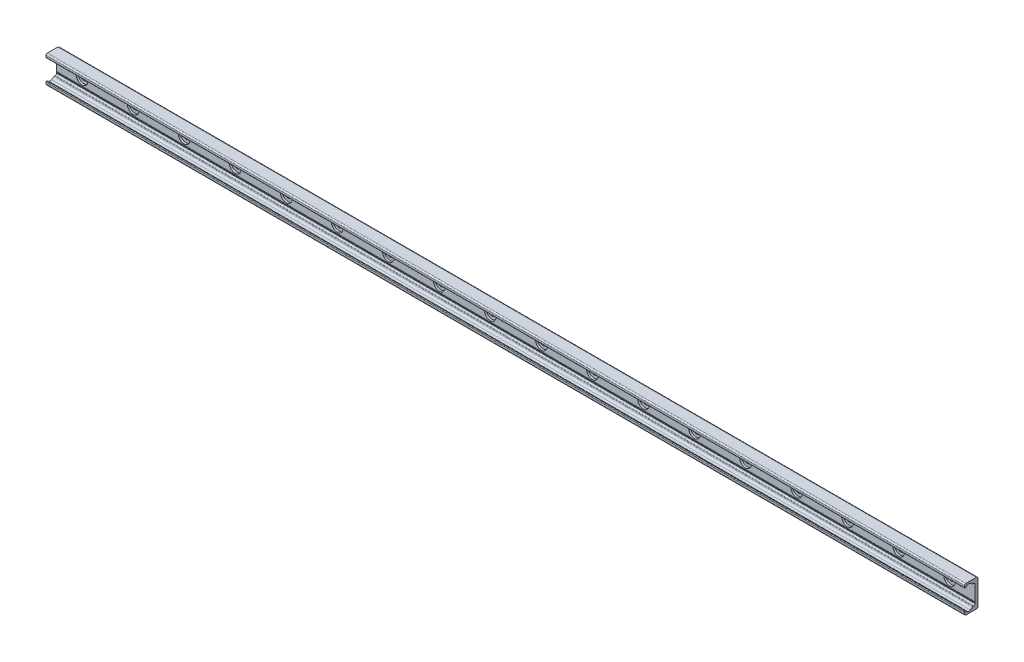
ISO-10303-21;
HEADER;
FILE_DESCRIPTION(('STEP AP214'),'2;1');
FILE_NAME('part.step','',(''),(''),'','','');
FILE_SCHEMA(('AUTOMOTIVE_DESIGN { 1 0 10303 214 1 1 1 1 }'));
ENDSEC;
DATA;
#1=APPLICATION_CONTEXT('core data for automotive mechanical design processes');
#2=APPLICATION_PROTOCOL_DEFINITION('international standard','automotive_design',2000,#1);
#3=PRODUCT_CONTEXT('',#1,'mechanical');
#4=PRODUCT('Part','Part','',(#3));
#5=PRODUCT_RELATED_PRODUCT_CATEGORY('part','',(#4));
#6=PRODUCT_DEFINITION_FORMATION('','',#4);
#7=PRODUCT_DEFINITION_CONTEXT('part definition',#1,'design');
#8=PRODUCT_DEFINITION('design','',#6,#7);
#9=PRODUCT_DEFINITION_SHAPE('','',#8);
#10=(LENGTH_UNIT() NAMED_UNIT(*) SI_UNIT(.MILLI.,.METRE.));
#11=(NAMED_UNIT(*) PLANE_ANGLE_UNIT() SI_UNIT($,.RADIAN.));
#12=(NAMED_UNIT(*) SI_UNIT($,.STERADIAN.) SOLID_ANGLE_UNIT());
#13=UNCERTAINTY_MEASURE_WITH_UNIT(LENGTH_MEASURE(1.E-05),#10,'distance_accuracy_value','');
#14=(GEOMETRIC_REPRESENTATION_CONTEXT(3) GLOBAL_UNCERTAINTY_ASSIGNED_CONTEXT((#13)) GLOBAL_UNIT_ASSIGNED_CONTEXT((#10,
#11,#12)) REPRESENTATION_CONTEXT('',''));
#15=CARTESIAN_POINT('',(0.,0.,0.));
#16=DIRECTION('',(0.,0.,1.));
#17=DIRECTION('',(1.,0.,0.));
#18=AXIS2_PLACEMENT_3D('',#15,#16,#17);
#19=CARTESIAN_POINT('',(-680.,0.,1.39999999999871));
#20=DIRECTION('',(0.,0.,1.));
#21=DIRECTION('',(1.,0.,0.));
#22=AXIS2_PLACEMENT_3D('',#19,#20,#21);
#23=PLANE('',#22);
#24=CARTESIAN_POINT('',(-680.,0.,1.39999999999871));
#25=DIRECTION('',(0.,0.,1.));
#26=DIRECTION('',(1.,0.,0.));
#27=AXIS2_PLACEMENT_3D('',#24,#25,#26);
#28=CIRCLE('',#27,4.49999999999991);
#29=CARTESIAN_POINT('',(-675.5,0.,1.39999999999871));
#30=VERTEX_POINT('',#29);
#31=EDGE_CURVE('E603',#30,#30,#28,.T.);
#32=ORIENTED_EDGE('',*,*,#31,.F.);
#33=EDGE_LOOP('',(#32));
#34=FACE_BOUND('',#33,.T.);
#35=CARTESIAN_POINT('',(-680.,0.,1.39999999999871));
#36=DIRECTION('',(0.,0.,1.));
#37=DIRECTION('',(1.,0.,0.));
#38=AXIS2_PLACEMENT_3D('',#35,#36,#37);
#39=CIRCLE('',#38,9.00000000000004);
#40=CARTESIAN_POINT('',(-671.,0.,1.39999999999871));
#41=VERTEX_POINT('',#40);
#42=EDGE_CURVE('E11',#41,#41,#39,.T.);
#43=ORIENTED_EDGE('',*,*,#42,.T.);
#44=EDGE_LOOP('',(#43));
#45=FACE_BOUND('',#44,.T.);
#46=ADVANCED_FACE('F39',(#34,#45),#23,.T.);
#47=CARTESIAN_POINT('',(-680.,0.,1.39999999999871));
#48=DIRECTION('',(0.,0.,1.));
#49=DIRECTION('',(1.,0.,0.));
#50=AXIS2_PLACEMENT_3D('',#47,#48,#49);
#51=CYLINDRICAL_SURFACE('',#50,9.00000000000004);
#52=CARTESIAN_POINT('',(-680.,0.,4.49999999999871));
#53=DIRECTION('',(0.,0.,1.));
#54=DIRECTION('',(1.,0.,0.));
#55=AXIS2_PLACEMENT_3D('',#52,#53,#54);
#56=CIRCLE('',#55,9.00000000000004);
#57=CARTESIAN_POINT('',(-671.,0.,4.49999999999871));
#58=VERTEX_POINT('',#57);
#59=EDGE_CURVE('E49',#58,#58,#56,.T.);
#60=CARTESIAN_POINT('',(-671.,0.,1.39999999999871));
#61=CARTESIAN_POINT('',(-671.,0.,1.43229166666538));
#62=CARTESIAN_POINT('',(-671.,0.,1.46458333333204));
#63=CARTESIAN_POINT('',(-671.,0.,1.52916666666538));
#64=CARTESIAN_POINT('',(-671.,0.,1.56145833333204));
#65=CARTESIAN_POINT('',(-671.,0.,1.62604166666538));
#66=CARTESIAN_POINT('',(-671.,0.,1.65833333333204));
#67=CARTESIAN_POINT('',(-671.,0.,1.72291666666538));
#68=CARTESIAN_POINT('',(-671.,0.,1.75520833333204));
#69=CARTESIAN_POINT('',(-671.,0.,1.81979166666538));
#70=CARTESIAN_POINT('',(-671.,0.,1.85208333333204));
#71=CARTESIAN_POINT('',(-671.,0.,1.91666666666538));
#72=CARTESIAN_POINT('',(-671.,0.,1.94895833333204));
#73=CARTESIAN_POINT('',(-671.,0.,2.01354166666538));
#74=CARTESIAN_POINT('',(-671.,0.,2.04583333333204));
#75=CARTESIAN_POINT('',(-671.,0.,2.11041666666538));
#76=CARTESIAN_POINT('',(-671.,0.,2.14270833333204));
#77=CARTESIAN_POINT('',(-671.,0.,2.20729166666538));
#78=CARTESIAN_POINT('',(-671.,0.,2.23958333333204));
#79=CARTESIAN_POINT('',(-671.,0.,2.30416666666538));
#80=CARTESIAN_POINT('',(-671.,0.,2.33645833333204));
#81=CARTESIAN_POINT('',(-671.,0.,2.40104166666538));
#82=CARTESIAN_POINT('',(-671.,0.,2.43333333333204));
#83=CARTESIAN_POINT('',(-671.,0.,2.49791666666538));
#84=CARTESIAN_POINT('',(-671.,0.,2.53020833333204));
#85=CARTESIAN_POINT('',(-671.,0.,2.59479166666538));
#86=CARTESIAN_POINT('',(-671.,0.,2.62708333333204));
#87=CARTESIAN_POINT('',(-671.,0.,2.69166666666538));
#88=CARTESIAN_POINT('',(-671.,0.,2.72395833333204));
#89=CARTESIAN_POINT('',(-671.,0.,2.78854166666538));
#90=CARTESIAN_POINT('',(-671.,0.,2.82083333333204));
#91=CARTESIAN_POINT('',(-671.,0.,2.88541666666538));
#92=CARTESIAN_POINT('',(-671.,0.,2.91770833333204));
#93=CARTESIAN_POINT('',(-671.,0.,2.98229166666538));
#94=CARTESIAN_POINT('',(-671.,0.,3.01458333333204));
#95=CARTESIAN_POINT('',(-671.,0.,3.07916666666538));
#96=CARTESIAN_POINT('',(-671.,0.,3.11145833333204));
#97=CARTESIAN_POINT('',(-671.,0.,3.17604166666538));
#98=CARTESIAN_POINT('',(-671.,0.,3.20833333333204));
#99=CARTESIAN_POINT('',(-671.,0.,3.27291666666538));
#100=CARTESIAN_POINT('',(-671.,0.,3.30520833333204));
#101=CARTESIAN_POINT('',(-671.,0.,3.36979166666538));
#102=CARTESIAN_POINT('',(-671.,0.,3.40208333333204));
#103=CARTESIAN_POINT('',(-671.,0.,3.46666666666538));
#104=CARTESIAN_POINT('',(-671.,0.,3.49895833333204));
#105=CARTESIAN_POINT('',(-671.,0.,3.56354166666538));
#106=CARTESIAN_POINT('',(-671.,0.,3.59583333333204));
#107=CARTESIAN_POINT('',(-671.,0.,3.66041666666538));
#108=CARTESIAN_POINT('',(-671.,0.,3.69270833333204));
#109=CARTESIAN_POINT('',(-671.,0.,3.75729166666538));
#110=CARTESIAN_POINT('',(-671.,0.,3.78958333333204));
#111=CARTESIAN_POINT('',(-671.,0.,3.85416666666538));
#112=CARTESIAN_POINT('',(-671.,0.,3.88645833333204));
#113=CARTESIAN_POINT('',(-671.,0.,3.95104166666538));
#114=CARTESIAN_POINT('',(-671.,0.,3.98333333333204));
#115=CARTESIAN_POINT('',(-671.,0.,4.04791666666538));
#116=CARTESIAN_POINT('',(-671.,0.,4.08020833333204));
#117=CARTESIAN_POINT('',(-671.,0.,4.14479166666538));
#118=CARTESIAN_POINT('',(-671.,0.,4.17708333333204));
#119=CARTESIAN_POINT('',(-671.,0.,4.24166666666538));
#120=CARTESIAN_POINT('',(-671.,0.,4.27395833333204));
#121=CARTESIAN_POINT('',(-671.,0.,4.33854166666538));
#122=CARTESIAN_POINT('',(-671.,0.,4.37083333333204));
#123=CARTESIAN_POINT('',(-671.,0.,4.43541666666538));
#124=CARTESIAN_POINT('',(-671.,0.,4.46770833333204));
#125=CARTESIAN_POINT('',(-671.,0.,4.49999999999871));
#126=B_SPLINE_CURVE_WITH_KNOTS('',3,(#60,#61,#62,#63,#64,#65,#66,#67,#68,#69,#70,#71,#72,#73,
#74,#75,#76,#77,#78,#79,#80,#81,#82,#83,#84,#85,#86,#87,#88,#89,#90,#91,#92,#93,#94,#95,#96,#97,
#98,#99,#100,#101,#102,#103,#104,#105,#106,#107,#108,#109,#110,#111,#112,#113,#114,#115,#116,
#117,#118,#119,#120,#121,#122,#123,#124,#125),.UNSPECIFIED.,.F.,.F.,(4,2,2,2,2,2,2,2,2,2,2,2,2,
2,2,2,2,2,2,2,2,2,2,2,2,2,2,2,2,2,2,2,4),(0.,0.0968750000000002,0.19375,0.290625,0.3875,
0.484375,0.58125,0.678125,0.775,0.871875,0.96875,1.065625,1.1625,1.259375,1.35625,1.453125,1.55,
1.646875,1.74375,1.840625,1.9375,2.034375,2.13125,2.228125,2.325,2.421875,2.51875,2.615625,
2.7125,2.809375,2.90625,3.003125,3.1),.UNSPECIFIED.);
#127=EDGE_CURVE('BSEAM573',#41,#58,#126,.T.);
#128=ORIENTED_EDGE('',*,*,#42,.F.);
#129=ORIENTED_EDGE('',*,*,#59,.T.);
#130=ORIENTED_EDGE('',*,*,#127,.T.);
#131=ORIENTED_EDGE('',*,*,#127,.F.);
#132=EDGE_LOOP('',(#128,#130,#129,#131));
#133=FACE_BOUND('',#132,.T.);
#134=ADVANCED_FACE('F573',(#133),#51,.F.);
#135=CARTESIAN_POINT('',(-600.,0.,1.39999999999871));
#136=DIRECTION('',(0.,0.,1.));
#137=DIRECTION('',(1.,0.,0.));
#138=AXIS2_PLACEMENT_3D('',#135,#136,#137);
#139=PLANE('',#138);
#140=CARTESIAN_POINT('',(-600.,0.,1.39999999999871));
#141=DIRECTION('',(0.,0.,1.));
#142=DIRECTION('',(1.,0.,0.));
#143=AXIS2_PLACEMENT_3D('',#140,#141,#142);
#144=CIRCLE('',#143,4.49999999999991);
#145=CARTESIAN_POINT('',(-595.5,0.,1.39999999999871));
#146=VERTEX_POINT('',#145);
#147=EDGE_CURVE('E607',#146,#146,#144,.T.);
#148=ORIENTED_EDGE('',*,*,#147,.F.);
#149=EDGE_LOOP('',(#148));
#150=FACE_BOUND('',#149,.T.);
#151=CARTESIAN_POINT('',(-600.,0.,1.39999999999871));
#152=DIRECTION('',(0.,0.,1.));
#153=DIRECTION('',(1.,0.,0.));
#154=AXIS2_PLACEMENT_3D('',#151,#152,#153);
#155=CIRCLE('',#154,9.00000000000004);
#156=CARTESIAN_POINT('',(-591.,0.,1.39999999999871));
#157=VERTEX_POINT('',#156);
#158=EDGE_CURVE('E563',#157,#157,#155,.T.);
#159=ORIENTED_EDGE('',*,*,#158,.T.);
#160=EDGE_LOOP('',(#159));
#161=FACE_BOUND('',#160,.T.);
#162=ADVANCED_FACE('F598',(#150,#161),#139,.T.);
#163=CARTESIAN_POINT('',(-600.,0.,1.39999999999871));
#164=DIRECTION('',(0.,0.,1.));
#165=DIRECTION('',(1.,0.,0.));
#166=AXIS2_PLACEMENT_3D('',#163,#164,#165);
#167=CYLINDRICAL_SURFACE('',#166,9.00000000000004);
#168=CARTESIAN_POINT('',(-600.,0.,4.49999999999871));
#169=DIRECTION('',(0.,0.,1.));
#170=DIRECTION('',(1.,0.,0.));
#171=AXIS2_PLACEMENT_3D('',#168,#169,#170);
#172=CIRCLE('',#171,9.00000000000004);
#173=CARTESIAN_POINT('',(-591.,0.,4.49999999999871));
#174=VERTEX_POINT('',#173);
#175=EDGE_CURVE('E559',#174,#174,#172,.T.);
#176=CARTESIAN_POINT('',(-591.,0.,1.39999999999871));
#177=CARTESIAN_POINT('',(-591.,0.,1.43229166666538));
#178=CARTESIAN_POINT('',(-591.,0.,1.46458333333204));
#179=CARTESIAN_POINT('',(-591.,0.,1.52916666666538));
#180=CARTESIAN_POINT('',(-591.,0.,1.56145833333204));
#181=CARTESIAN_POINT('',(-591.,0.,1.62604166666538));
#182=CARTESIAN_POINT('',(-591.,0.,1.65833333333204));
#183=CARTESIAN_POINT('',(-591.,0.,1.72291666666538));
#184=CARTESIAN_POINT('',(-591.,0.,1.75520833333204));
#185=CARTESIAN_POINT('',(-591.,0.,1.81979166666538));
#186=CARTESIAN_POINT('',(-591.,0.,1.85208333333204));
#187=CARTESIAN_POINT('',(-591.,0.,1.91666666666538));
#188=CARTESIAN_POINT('',(-591.,0.,1.94895833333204));
#189=CARTESIAN_POINT('',(-591.,0.,2.01354166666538));
#190=CARTESIAN_POINT('',(-591.,0.,2.04583333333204));
#191=CARTESIAN_POINT('',(-591.,0.,2.11041666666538));
#192=CARTESIAN_POINT('',(-591.,0.,2.14270833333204));
#193=CARTESIAN_POINT('',(-591.,0.,2.20729166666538));
#194=CARTESIAN_POINT('',(-591.,0.,2.23958333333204));
#195=CARTESIAN_POINT('',(-591.,0.,2.30416666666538));
#196=CARTESIAN_POINT('',(-591.,0.,2.33645833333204));
#197=CARTESIAN_POINT('',(-591.,0.,2.40104166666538));
#198=CARTESIAN_POINT('',(-591.,0.,2.43333333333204));
#199=CARTESIAN_POINT('',(-591.,0.,2.49791666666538));
#200=CARTESIAN_POINT('',(-591.,0.,2.53020833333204));
#201=CARTESIAN_POINT('',(-591.,0.,2.59479166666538));
#202=CARTESIAN_POINT('',(-591.,0.,2.62708333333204));
#203=CARTESIAN_POINT('',(-591.,0.,2.69166666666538));
#204=CARTESIAN_POINT('',(-591.,0.,2.72395833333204));
#205=CARTESIAN_POINT('',(-591.,0.,2.78854166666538));
#206=CARTESIAN_POINT('',(-591.,0.,2.82083333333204));
#207=CARTESIAN_POINT('',(-591.,0.,2.88541666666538));
#208=CARTESIAN_POINT('',(-591.,0.,2.91770833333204));
#209=CARTESIAN_POINT('',(-591.,0.,2.98229166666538));
#210=CARTESIAN_POINT('',(-591.,0.,3.01458333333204));
#211=CARTESIAN_POINT('',(-591.,0.,3.07916666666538));
#212=CARTESIAN_POINT('',(-591.,0.,3.11145833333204));
#213=CARTESIAN_POINT('',(-591.,0.,3.17604166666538));
#214=CARTESIAN_POINT('',(-591.,0.,3.20833333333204));
#215=CARTESIAN_POINT('',(-591.,0.,3.27291666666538));
#216=CARTESIAN_POINT('',(-591.,0.,3.30520833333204));
#217=CARTESIAN_POINT('',(-591.,0.,3.36979166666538));
#218=CARTESIAN_POINT('',(-591.,0.,3.40208333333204));
#219=CARTESIAN_POINT('',(-591.,0.,3.46666666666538));
#220=CARTESIAN_POINT('',(-591.,0.,3.49895833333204));
#221=CARTESIAN_POINT('',(-591.,0.,3.56354166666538));
#222=CARTESIAN_POINT('',(-591.,0.,3.59583333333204));
#223=CARTESIAN_POINT('',(-591.,0.,3.66041666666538));
#224=CARTESIAN_POINT('',(-591.,0.,3.69270833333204));
#225=CARTESIAN_POINT('',(-591.,0.,3.75729166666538));
#226=CARTESIAN_POINT('',(-591.,0.,3.78958333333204));
#227=CARTESIAN_POINT('',(-591.,0.,3.85416666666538));
#228=CARTESIAN_POINT('',(-591.,0.,3.88645833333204));
#229=CARTESIAN_POINT('',(-591.,0.,3.95104166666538));
#230=CARTESIAN_POINT('',(-591.,0.,3.98333333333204));
#231=CARTESIAN_POINT('',(-591.,0.,4.04791666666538));
#232=CARTESIAN_POINT('',(-591.,0.,4.08020833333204));
#233=CARTESIAN_POINT('',(-591.,0.,4.14479166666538));
#234=CARTESIAN_POINT('',(-591.,0.,4.17708333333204));
#235=CARTESIAN_POINT('',(-591.,0.,4.24166666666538));
#236=CARTESIAN_POINT('',(-591.,0.,4.27395833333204));
#237=CARTESIAN_POINT('',(-591.,0.,4.33854166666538));
#238=CARTESIAN_POINT('',(-591.,0.,4.37083333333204));
#239=CARTESIAN_POINT('',(-591.,0.,4.43541666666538));
#240=CARTESIAN_POINT('',(-591.,0.,4.46770833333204));
#241=CARTESIAN_POINT('',(-591.,0.,4.49999999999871));
#242=B_SPLINE_CURVE_WITH_KNOTS('',3,(#176,#177,#178,#179,#180,#181,#182,#183,#184,#185,#186,
#187,#188,#189,#190,#191,#192,#193,#194,#195,#196,#197,#198,#199,#200,#201,#202,#203,#204,#205,
#206,#207,#208,#209,#210,#211,#212,#213,#214,#215,#216,#217,#218,#219,#220,#221,#222,#223,#224,
#225,#226,#227,#228,#229,#230,#231,#232,#233,#234,#235,#236,#237,#238,#239,#240,#241),
.UNSPECIFIED.,.F.,.F.,(4,2,2,2,2,2,2,2,2,2,2,2,2,2,2,2,2,2,2,2,2,2,2,2,2,2,2,2,2,2,2,2,4),(0.,
0.0968750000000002,0.19375,0.290625,0.3875,0.484375,0.58125,0.678125,0.775,0.871875,0.96875,
1.065625,1.1625,1.259375,1.35625,1.453125,1.55,1.646875,1.74375,1.840625,1.9375,2.034375,
2.13125,2.228125,2.325,2.421875,2.51875,2.615625,2.7125,2.809375,2.90625,3.003125,3.1),.UNSPECIFIED.);
#243=EDGE_CURVE('BSEAM1497',#157,#174,#242,.T.);
#244=ORIENTED_EDGE('',*,*,#158,.F.);
#245=ORIENTED_EDGE('',*,*,#175,.T.);
#246=ORIENTED_EDGE('',*,*,#243,.T.);
#247=ORIENTED_EDGE('',*,*,#243,.F.);
#248=EDGE_LOOP('',(#244,#246,#245,#247));
#249=FACE_BOUND('',#248,.T.);
#250=ADVANCED_FACE('F1497',(#249),#167,.F.);
#251=CARTESIAN_POINT('',(-520.,0.,1.39999999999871));
#252=DIRECTION('',(0.,0.,1.));
#253=DIRECTION('',(1.,0.,0.));
#254=AXIS2_PLACEMENT_3D('',#251,#252,#253);
#255=PLANE('',#254);
#256=CARTESIAN_POINT('',(-520.,0.,1.39999999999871));
#257=DIRECTION('',(0.,0.,1.));
#258=DIRECTION('',(1.,0.,0.));
#259=AXIS2_PLACEMENT_3D('',#256,#257,#258);
#260=CIRCLE('',#259,4.49999999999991);
#261=CARTESIAN_POINT('',(-515.5,0.,1.39999999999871));
#262=VERTEX_POINT('',#261);
#263=EDGE_CURVE('E611',#262,#262,#260,.T.);
#264=ORIENTED_EDGE('',*,*,#263,.F.);
#265=EDGE_LOOP('',(#264));
#266=FACE_BOUND('',#265,.T.);
#267=CARTESIAN_POINT('',(-520.,0.,1.39999999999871));
#268=DIRECTION('',(0.,0.,1.));
#269=DIRECTION('',(1.,0.,0.));
#270=AXIS2_PLACEMENT_3D('',#267,#268,#269);
#271=CIRCLE('',#270,9.00000000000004);
#272=CARTESIAN_POINT('',(-511.,0.,1.39999999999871));
#273=VERTEX_POINT('',#272);
#274=EDGE_CURVE('E555',#273,#273,#271,.T.);
#275=ORIENTED_EDGE('',*,*,#274,.T.);
#276=EDGE_LOOP('',(#275));
#277=FACE_BOUND('',#276,.T.);
#278=ADVANCED_FACE('F1487',(#266,#277),#255,.T.);
#279=CARTESIAN_POINT('',(-520.,0.,1.39999999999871));
#280=DIRECTION('',(0.,0.,1.));
#281=DIRECTION('',(1.,0.,0.));
#282=AXIS2_PLACEMENT_3D('',#279,#280,#281);
#283=CYLINDRICAL_SURFACE('',#282,9.00000000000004);
#284=CARTESIAN_POINT('',(-520.,0.,4.49999999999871));
#285=DIRECTION('',(0.,0.,1.));
#286=DIRECTION('',(1.,0.,0.));
#287=AXIS2_PLACEMENT_3D('',#284,#285,#286);
#288=CIRCLE('',#287,9.00000000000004);
#289=CARTESIAN_POINT('',(-511.,0.,4.49999999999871));
#290=VERTEX_POINT('',#289);
#291=EDGE_CURVE('E551',#290,#290,#288,.T.);
#292=CARTESIAN_POINT('',(-511.,0.,1.39999999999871));
#293=CARTESIAN_POINT('',(-511.,0.,1.43229166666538));
#294=CARTESIAN_POINT('',(-511.,0.,1.46458333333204));
#295=CARTESIAN_POINT('',(-511.,0.,1.52916666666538));
#296=CARTESIAN_POINT('',(-511.,0.,1.56145833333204));
#297=CARTESIAN_POINT('',(-511.,0.,1.62604166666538));
#298=CARTESIAN_POINT('',(-511.,0.,1.65833333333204));
#299=CARTESIAN_POINT('',(-511.,0.,1.72291666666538));
#300=CARTESIAN_POINT('',(-511.,0.,1.75520833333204));
#301=CARTESIAN_POINT('',(-511.,0.,1.81979166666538));
#302=CARTESIAN_POINT('',(-511.,0.,1.85208333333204));
#303=CARTESIAN_POINT('',(-511.,0.,1.91666666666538));
#304=CARTESIAN_POINT('',(-511.,0.,1.94895833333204));
#305=CARTESIAN_POINT('',(-511.,0.,2.01354166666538));
#306=CARTESIAN_POINT('',(-511.,0.,2.04583333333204));
#307=CARTESIAN_POINT('',(-511.,0.,2.11041666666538));
#308=CARTESIAN_POINT('',(-511.,0.,2.14270833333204));
#309=CARTESIAN_POINT('',(-511.,0.,2.20729166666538));
#310=CARTESIAN_POINT('',(-511.,0.,2.23958333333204));
#311=CARTESIAN_POINT('',(-511.,0.,2.30416666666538));
#312=CARTESIAN_POINT('',(-511.,0.,2.33645833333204));
#313=CARTESIAN_POINT('',(-511.,0.,2.40104166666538));
#314=CARTESIAN_POINT('',(-511.,0.,2.43333333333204));
#315=CARTESIAN_POINT('',(-511.,0.,2.49791666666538));
#316=CARTESIAN_POINT('',(-511.,0.,2.53020833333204));
#317=CARTESIAN_POINT('',(-511.,0.,2.59479166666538));
#318=CARTESIAN_POINT('',(-511.,0.,2.62708333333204));
#319=CARTESIAN_POINT('',(-511.,0.,2.69166666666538));
#320=CARTESIAN_POINT('',(-511.,0.,2.72395833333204));
#321=CARTESIAN_POINT('',(-511.,0.,2.78854166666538));
#322=CARTESIAN_POINT('',(-511.,0.,2.82083333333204));
#323=CARTESIAN_POINT('',(-511.,0.,2.88541666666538));
#324=CARTESIAN_POINT('',(-511.,0.,2.91770833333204));
#325=CARTESIAN_POINT('',(-511.,0.,2.98229166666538));
#326=CARTESIAN_POINT('',(-511.,0.,3.01458333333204));
#327=CARTESIAN_POINT('',(-511.,0.,3.07916666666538));
#328=CARTESIAN_POINT('',(-511.,0.,3.11145833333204));
#329=CARTESIAN_POINT('',(-511.,0.,3.17604166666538));
#330=CARTESIAN_POINT('',(-511.,0.,3.20833333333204));
#331=CARTESIAN_POINT('',(-511.,0.,3.27291666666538));
#332=CARTESIAN_POINT('',(-511.,0.,3.30520833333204));
#333=CARTESIAN_POINT('',(-511.,0.,3.36979166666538));
#334=CARTESIAN_POINT('',(-511.,0.,3.40208333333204));
#335=CARTESIAN_POINT('',(-511.,0.,3.46666666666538));
#336=CARTESIAN_POINT('',(-511.,0.,3.49895833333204));
#337=CARTESIAN_POINT('',(-511.,0.,3.56354166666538));
#338=CARTESIAN_POINT('',(-511.,0.,3.59583333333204));
#339=CARTESIAN_POINT('',(-511.,0.,3.66041666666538));
#340=CARTESIAN_POINT('',(-511.,0.,3.69270833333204));
#341=CARTESIAN_POINT('',(-511.,0.,3.75729166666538));
#342=CARTESIAN_POINT('',(-511.,0.,3.78958333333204));
#343=CARTESIAN_POINT('',(-511.,0.,3.85416666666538));
#344=CARTESIAN_POINT('',(-511.,0.,3.88645833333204));
#345=CARTESIAN_POINT('',(-511.,0.,3.95104166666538));
#346=CARTESIAN_POINT('',(-511.,0.,3.98333333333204));
#347=CARTESIAN_POINT('',(-511.,0.,4.04791666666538));
#348=CARTESIAN_POINT('',(-511.,0.,4.08020833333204));
#349=CARTESIAN_POINT('',(-511.,0.,4.14479166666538));
#350=CARTESIAN_POINT('',(-511.,0.,4.17708333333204));
#351=CARTESIAN_POINT('',(-511.,0.,4.24166666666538));
#352=CARTESIAN_POINT('',(-511.,0.,4.27395833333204));
#353=CARTESIAN_POINT('',(-511.,0.,4.33854166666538));
#354=CARTESIAN_POINT('',(-511.,0.,4.37083333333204));
#355=CARTESIAN_POINT('',(-511.,0.,4.43541666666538));
#356=CARTESIAN_POINT('',(-511.,0.,4.46770833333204));
#357=CARTESIAN_POINT('',(-511.,0.,4.49999999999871));
#358=B_SPLINE_CURVE_WITH_KNOTS('',3,(#292,#293,#294,#295,#296,#297,#298,#299,#300,#301,#302,
#303,#304,#305,#306,#307,#308,#309,#310,#311,#312,#313,#314,#315,#316,#317,#318,#319,#320,#321,
#322,#323,#324,#325,#326,#327,#328,#329,#330,#331,#332,#333,#334,#335,#336,#337,#338,#339,#340,
#341,#342,#343,#344,#345,#346,#347,#348,#349,#350,#351,#352,#353,#354,#355,#356,#357),
.UNSPECIFIED.,.F.,.F.,(4,2,2,2,2,2,2,2,2,2,2,2,2,2,2,2,2,2,2,2,2,2,2,2,2,2,2,2,2,2,2,2,4),(0.,
0.0968750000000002,0.19375,0.290625,0.3875,0.484375,0.58125,0.678125,0.775,0.871875,0.96875,
1.065625,1.1625,1.259375,1.35625,1.453125,1.55,1.646875,1.74375,1.840625,1.9375,2.034375,
2.13125,2.228125,2.325,2.421875,2.51875,2.615625,2.7125,2.809375,2.90625,3.003125,3.1),.UNSPECIFIED.);
#359=EDGE_CURVE('BSEAM1477',#273,#290,#358,.T.);
#360=ORIENTED_EDGE('',*,*,#274,.F.);
#361=ORIENTED_EDGE('',*,*,#291,.T.);
#362=ORIENTED_EDGE('',*,*,#359,.T.);
#363=ORIENTED_EDGE('',*,*,#359,.F.);
#364=EDGE_LOOP('',(#360,#362,#361,#363));
#365=FACE_BOUND('',#364,.T.);
#366=ADVANCED_FACE('F1477',(#365),#283,.F.);
#367=CARTESIAN_POINT('',(-440.,0.,1.39999999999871));
#368=DIRECTION('',(0.,0.,1.));
#369=DIRECTION('',(1.,0.,0.));
#370=AXIS2_PLACEMENT_3D('',#367,#368,#369);
#371=PLANE('',#370);
#372=CARTESIAN_POINT('',(-440.,0.,1.39999999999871));
#373=DIRECTION('',(0.,0.,1.));
#374=DIRECTION('',(1.,0.,0.));
#375=AXIS2_PLACEMENT_3D('',#372,#373,#374);
#376=CIRCLE('',#375,4.49999999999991);
#377=CARTESIAN_POINT('',(-435.5,0.,1.39999999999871));
#378=VERTEX_POINT('',#377);
#379=EDGE_CURVE('E623',#378,#378,#376,.T.);
#380=ORIENTED_EDGE('',*,*,#379,.F.);
#381=EDGE_LOOP('',(#380));
#382=FACE_BOUND('',#381,.T.);
#383=CARTESIAN_POINT('',(-440.,0.,1.39999999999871));
#384=DIRECTION('',(0.,0.,1.));
#385=DIRECTION('',(1.,0.,0.));
#386=AXIS2_PLACEMENT_3D('',#383,#384,#385);
#387=CIRCLE('',#386,9.00000000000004);
#388=CARTESIAN_POINT('',(-431.,0.,1.39999999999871));
#389=VERTEX_POINT('',#388);
#390=EDGE_CURVE('E547',#389,#389,#387,.T.);
#391=ORIENTED_EDGE('',*,*,#390,.T.);
#392=EDGE_LOOP('',(#391));
#393=FACE_BOUND('',#392,.T.);
#394=ADVANCED_FACE('F1467',(#382,#393),#371,.T.);
#395=CARTESIAN_POINT('',(-440.,0.,1.39999999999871));
#396=DIRECTION('',(0.,0.,1.));
#397=DIRECTION('',(1.,0.,0.));
#398=AXIS2_PLACEMENT_3D('',#395,#396,#397);
#399=CYLINDRICAL_SURFACE('',#398,9.00000000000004);
#400=CARTESIAN_POINT('',(-440.,0.,4.49999999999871));
#401=DIRECTION('',(0.,0.,1.));
#402=DIRECTION('',(1.,0.,0.));
#403=AXIS2_PLACEMENT_3D('',#400,#401,#402);
#404=CIRCLE('',#403,9.00000000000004);
#405=CARTESIAN_POINT('',(-431.,0.,4.49999999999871));
#406=VERTEX_POINT('',#405);
#407=EDGE_CURVE('E543',#406,#406,#404,.T.);
#408=CARTESIAN_POINT('',(-431.,0.,1.39999999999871));
#409=CARTESIAN_POINT('',(-431.,0.,1.43229166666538));
#410=CARTESIAN_POINT('',(-431.,0.,1.46458333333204));
#411=CARTESIAN_POINT('',(-431.,0.,1.52916666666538));
#412=CARTESIAN_POINT('',(-431.,0.,1.56145833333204));
#413=CARTESIAN_POINT('',(-431.,0.,1.62604166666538));
#414=CARTESIAN_POINT('',(-431.,0.,1.65833333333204));
#415=CARTESIAN_POINT('',(-431.,0.,1.72291666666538));
#416=CARTESIAN_POINT('',(-431.,0.,1.75520833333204));
#417=CARTESIAN_POINT('',(-431.,0.,1.81979166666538));
#418=CARTESIAN_POINT('',(-431.,0.,1.85208333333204));
#419=CARTESIAN_POINT('',(-431.,0.,1.91666666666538));
#420=CARTESIAN_POINT('',(-431.,0.,1.94895833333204));
#421=CARTESIAN_POINT('',(-431.,0.,2.01354166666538));
#422=CARTESIAN_POINT('',(-431.,0.,2.04583333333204));
#423=CARTESIAN_POINT('',(-431.,0.,2.11041666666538));
#424=CARTESIAN_POINT('',(-431.,0.,2.14270833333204));
#425=CARTESIAN_POINT('',(-431.,0.,2.20729166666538));
#426=CARTESIAN_POINT('',(-431.,0.,2.23958333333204));
#427=CARTESIAN_POINT('',(-431.,0.,2.30416666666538));
#428=CARTESIAN_POINT('',(-431.,0.,2.33645833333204));
#429=CARTESIAN_POINT('',(-431.,0.,2.40104166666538));
#430=CARTESIAN_POINT('',(-431.,0.,2.43333333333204));
#431=CARTESIAN_POINT('',(-431.,0.,2.49791666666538));
#432=CARTESIAN_POINT('',(-431.,0.,2.53020833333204));
#433=CARTESIAN_POINT('',(-431.,0.,2.59479166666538));
#434=CARTESIAN_POINT('',(-431.,0.,2.62708333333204));
#435=CARTESIAN_POINT('',(-431.,0.,2.69166666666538));
#436=CARTESIAN_POINT('',(-431.,0.,2.72395833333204));
#437=CARTESIAN_POINT('',(-431.,0.,2.78854166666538));
#438=CARTESIAN_POINT('',(-431.,0.,2.82083333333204));
#439=CARTESIAN_POINT('',(-431.,0.,2.88541666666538));
#440=CARTESIAN_POINT('',(-431.,0.,2.91770833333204));
#441=CARTESIAN_POINT('',(-431.,0.,2.98229166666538));
#442=CARTESIAN_POINT('',(-431.,0.,3.01458333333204));
#443=CARTESIAN_POINT('',(-431.,0.,3.07916666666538));
#444=CARTESIAN_POINT('',(-431.,0.,3.11145833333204));
#445=CARTESIAN_POINT('',(-431.,0.,3.17604166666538));
#446=CARTESIAN_POINT('',(-431.,0.,3.20833333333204));
#447=CARTESIAN_POINT('',(-431.,0.,3.27291666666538));
#448=CARTESIAN_POINT('',(-431.,0.,3.30520833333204));
#449=CARTESIAN_POINT('',(-431.,0.,3.36979166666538));
#450=CARTESIAN_POINT('',(-431.,0.,3.40208333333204));
#451=CARTESIAN_POINT('',(-431.,0.,3.46666666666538));
#452=CARTESIAN_POINT('',(-431.,0.,3.49895833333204));
#453=CARTESIAN_POINT('',(-431.,0.,3.56354166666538));
#454=CARTESIAN_POINT('',(-431.,0.,3.59583333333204));
#455=CARTESIAN_POINT('',(-431.,0.,3.66041666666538));
#456=CARTESIAN_POINT('',(-431.,0.,3.69270833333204));
#457=CARTESIAN_POINT('',(-431.,0.,3.75729166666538));
#458=CARTESIAN_POINT('',(-431.,0.,3.78958333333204));
#459=CARTESIAN_POINT('',(-431.,0.,3.85416666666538));
#460=CARTESIAN_POINT('',(-431.,0.,3.88645833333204));
#461=CARTESIAN_POINT('',(-431.,0.,3.95104166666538));
#462=CARTESIAN_POINT('',(-431.,0.,3.98333333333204));
#463=CARTESIAN_POINT('',(-431.,0.,4.04791666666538));
#464=CARTESIAN_POINT('',(-431.,0.,4.08020833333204));
#465=CARTESIAN_POINT('',(-431.,0.,4.14479166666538));
#466=CARTESIAN_POINT('',(-431.,0.,4.17708333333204));
#467=CARTESIAN_POINT('',(-431.,0.,4.24166666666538));
#468=CARTESIAN_POINT('',(-431.,0.,4.27395833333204));
#469=CARTESIAN_POINT('',(-431.,0.,4.33854166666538));
#470=CARTESIAN_POINT('',(-431.,0.,4.37083333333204));
#471=CARTESIAN_POINT('',(-431.,0.,4.43541666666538));
#472=CARTESIAN_POINT('',(-431.,0.,4.46770833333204));
#473=CARTESIAN_POINT('',(-431.,0.,4.49999999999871));
#474=B_SPLINE_CURVE_WITH_KNOTS('',3,(#408,#409,#410,#411,#412,#413,#414,#415,#416,#417,#418,
#419,#420,#421,#422,#423,#424,#425,#426,#427,#428,#429,#430,#431,#432,#433,#434,#435,#436,#437,
#438,#439,#440,#441,#442,#443,#444,#445,#446,#447,#448,#449,#450,#451,#452,#453,#454,#455,#456,
#457,#458,#459,#460,#461,#462,#463,#464,#465,#466,#467,#468,#469,#470,#471,#472,#473),
.UNSPECIFIED.,.F.,.F.,(4,2,2,2,2,2,2,2,2,2,2,2,2,2,2,2,2,2,2,2,2,2,2,2,2,2,2,2,2,2,2,2,4),(0.,
0.0968750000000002,0.19375,0.290625,0.3875,0.484375,0.58125,0.678125,0.775,0.871875,0.96875,
1.065625,1.1625,1.259375,1.35625,1.453125,1.55,1.646875,1.74375,1.840625,1.9375,2.034375,
2.13125,2.228125,2.325,2.421875,2.51875,2.615625,2.7125,2.809375,2.90625,3.003125,3.1),.UNSPECIFIED.);
#475=EDGE_CURVE('BSEAM1457',#389,#406,#474,.T.);
#476=ORIENTED_EDGE('',*,*,#390,.F.);
#477=ORIENTED_EDGE('',*,*,#407,.T.);
#478=ORIENTED_EDGE('',*,*,#475,.T.);
#479=ORIENTED_EDGE('',*,*,#475,.F.);
#480=EDGE_LOOP('',(#476,#478,#477,#479));
#481=FACE_BOUND('',#480,.T.);
#482=ADVANCED_FACE('F1457',(#481),#399,.F.);
#483=CARTESIAN_POINT('',(-360.,0.,1.39999999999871));
#484=DIRECTION('',(0.,0.,1.));
#485=DIRECTION('',(1.,0.,0.));
#486=AXIS2_PLACEMENT_3D('',#483,#484,#485);
#487=PLANE('',#486);
#488=CARTESIAN_POINT('',(-360.,0.,1.39999999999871));
#489=DIRECTION('',(0.,0.,1.));
#490=DIRECTION('',(1.,0.,0.));
#491=AXIS2_PLACEMENT_3D('',#488,#489,#490);
#492=CIRCLE('',#491,4.49999999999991);
#493=CARTESIAN_POINT('',(-355.5,0.,1.39999999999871));
#494=VERTEX_POINT('',#493);
#495=EDGE_CURVE('E627',#494,#494,#492,.T.);
#496=ORIENTED_EDGE('',*,*,#495,.F.);
#497=EDGE_LOOP('',(#496));
#498=FACE_BOUND('',#497,.T.);
#499=CARTESIAN_POINT('',(-360.,0.,1.39999999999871));
#500=DIRECTION('',(0.,0.,1.));
#501=DIRECTION('',(1.,0.,0.));
#502=AXIS2_PLACEMENT_3D('',#499,#500,#501);
#503=CIRCLE('',#502,9.00000000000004);
#504=CARTESIAN_POINT('',(-351.,0.,1.39999999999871));
#505=VERTEX_POINT('',#504);
#506=EDGE_CURVE('E539',#505,#505,#503,.T.);
#507=ORIENTED_EDGE('',*,*,#506,.T.);
#508=EDGE_LOOP('',(#507));
#509=FACE_BOUND('',#508,.T.);
#510=ADVANCED_FACE('F1447',(#498,#509),#487,.T.);
#511=CARTESIAN_POINT('',(-360.,0.,1.39999999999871));
#512=DIRECTION('',(0.,0.,1.));
#513=DIRECTION('',(1.,0.,0.));
#514=AXIS2_PLACEMENT_3D('',#511,#512,#513);
#515=CYLINDRICAL_SURFACE('',#514,9.00000000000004);
#516=CARTESIAN_POINT('',(-360.,0.,4.49999999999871));
#517=DIRECTION('',(0.,0.,1.));
#518=DIRECTION('',(1.,0.,0.));
#519=AXIS2_PLACEMENT_3D('',#516,#517,#518);
#520=CIRCLE('',#519,9.00000000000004);
#521=CARTESIAN_POINT('',(-351.,0.,4.49999999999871));
#522=VERTEX_POINT('',#521);
#523=EDGE_CURVE('E535',#522,#522,#520,.T.);
#524=CARTESIAN_POINT('',(-351.,0.,1.39999999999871));
#525=CARTESIAN_POINT('',(-351.,0.,1.43229166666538));
#526=CARTESIAN_POINT('',(-351.,0.,1.46458333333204));
#527=CARTESIAN_POINT('',(-351.,0.,1.52916666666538));
#528=CARTESIAN_POINT('',(-351.,0.,1.56145833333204));
#529=CARTESIAN_POINT('',(-351.,0.,1.62604166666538));
#530=CARTESIAN_POINT('',(-351.,0.,1.65833333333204));
#531=CARTESIAN_POINT('',(-351.,0.,1.72291666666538));
#532=CARTESIAN_POINT('',(-351.,0.,1.75520833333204));
#533=CARTESIAN_POINT('',(-351.,0.,1.81979166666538));
#534=CARTESIAN_POINT('',(-351.,0.,1.85208333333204));
#535=CARTESIAN_POINT('',(-351.,0.,1.91666666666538));
#536=CARTESIAN_POINT('',(-351.,0.,1.94895833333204));
#537=CARTESIAN_POINT('',(-351.,0.,2.01354166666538));
#538=CARTESIAN_POINT('',(-351.,0.,2.04583333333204));
#539=CARTESIAN_POINT('',(-351.,0.,2.11041666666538));
#540=CARTESIAN_POINT('',(-351.,0.,2.14270833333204));
#541=CARTESIAN_POINT('',(-351.,0.,2.20729166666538));
#542=CARTESIAN_POINT('',(-351.,0.,2.23958333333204));
#543=CARTESIAN_POINT('',(-351.,0.,2.30416666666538));
#544=CARTESIAN_POINT('',(-351.,0.,2.33645833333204));
#545=CARTESIAN_POINT('',(-351.,0.,2.40104166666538));
#546=CARTESIAN_POINT('',(-351.,0.,2.43333333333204));
#547=CARTESIAN_POINT('',(-351.,0.,2.49791666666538));
#548=CARTESIAN_POINT('',(-351.,0.,2.53020833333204));
#549=CARTESIAN_POINT('',(-351.,0.,2.59479166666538));
#550=CARTESIAN_POINT('',(-351.,0.,2.62708333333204));
#551=CARTESIAN_POINT('',(-351.,0.,2.69166666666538));
#552=CARTESIAN_POINT('',(-351.,0.,2.72395833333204));
#553=CARTESIAN_POINT('',(-351.,0.,2.78854166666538));
#554=CARTESIAN_POINT('',(-351.,0.,2.82083333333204));
#555=CARTESIAN_POINT('',(-351.,0.,2.88541666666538));
#556=CARTESIAN_POINT('',(-351.,0.,2.91770833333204));
#557=CARTESIAN_POINT('',(-351.,0.,2.98229166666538));
#558=CARTESIAN_POINT('',(-351.,0.,3.01458333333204));
#559=CARTESIAN_POINT('',(-351.,0.,3.07916666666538));
#560=CARTESIAN_POINT('',(-351.,0.,3.11145833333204));
#561=CARTESIAN_POINT('',(-351.,0.,3.17604166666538));
#562=CARTESIAN_POINT('',(-351.,0.,3.20833333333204));
#563=CARTESIAN_POINT('',(-351.,0.,3.27291666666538));
#564=CARTESIAN_POINT('',(-351.,0.,3.30520833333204));
#565=CARTESIAN_POINT('',(-351.,0.,3.36979166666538));
#566=CARTESIAN_POINT('',(-351.,0.,3.40208333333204));
#567=CARTESIAN_POINT('',(-351.,0.,3.46666666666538));
#568=CARTESIAN_POINT('',(-351.,0.,3.49895833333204));
#569=CARTESIAN_POINT('',(-351.,0.,3.56354166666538));
#570=CARTESIAN_POINT('',(-351.,0.,3.59583333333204));
#571=CARTESIAN_POINT('',(-351.,0.,3.66041666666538));
#572=CARTESIAN_POINT('',(-351.,0.,3.69270833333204));
#573=CARTESIAN_POINT('',(-351.,0.,3.75729166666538));
#574=CARTESIAN_POINT('',(-351.,0.,3.78958333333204));
#575=CARTESIAN_POINT('',(-351.,0.,3.85416666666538));
#576=CARTESIAN_POINT('',(-351.,0.,3.88645833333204));
#577=CARTESIAN_POINT('',(-351.,0.,3.95104166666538));
#578=CARTESIAN_POINT('',(-351.,0.,3.98333333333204));
#579=CARTESIAN_POINT('',(-351.,0.,4.04791666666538));
#580=CARTESIAN_POINT('',(-351.,0.,4.08020833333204));
#581=CARTESIAN_POINT('',(-351.,0.,4.14479166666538));
#582=CARTESIAN_POINT('',(-351.,0.,4.17708333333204));
#583=CARTESIAN_POINT('',(-351.,0.,4.24166666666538));
#584=CARTESIAN_POINT('',(-351.,0.,4.27395833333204));
#585=CARTESIAN_POINT('',(-351.,0.,4.33854166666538));
#586=CARTESIAN_POINT('',(-351.,0.,4.37083333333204));
#587=CARTESIAN_POINT('',(-351.,0.,4.43541666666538));
#588=CARTESIAN_POINT('',(-351.,0.,4.46770833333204));
#589=CARTESIAN_POINT('',(-351.,0.,4.49999999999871));
#590=B_SPLINE_CURVE_WITH_KNOTS('',3,(#524,#525,#526,#527,#528,#529,#530,#531,#532,#533,#534,
#535,#536,#537,#538,#539,#540,#541,#542,#543,#544,#545,#546,#547,#548,#549,#550,#551,#552,#553,
#554,#555,#556,#557,#558,#559,#560,#561,#562,#563,#564,#565,#566,#567,#568,#569,#570,#571,#572,
#573,#574,#575,#576,#577,#578,#579,#580,#581,#582,#583,#584,#585,#586,#587,#588,#589),
.UNSPECIFIED.,.F.,.F.,(4,2,2,2,2,2,2,2,2,2,2,2,2,2,2,2,2,2,2,2,2,2,2,2,2,2,2,2,2,2,2,2,4),(0.,
0.0968750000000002,0.19375,0.290625,0.3875,0.484375,0.58125,0.678125,0.775,0.871875,0.96875,
1.065625,1.1625,1.259375,1.35625,1.453125,1.55,1.646875,1.74375,1.840625,1.9375,2.034375,
2.13125,2.228125,2.325,2.421875,2.51875,2.615625,2.7125,2.809375,2.90625,3.003125,3.1),.UNSPECIFIED.);
#591=EDGE_CURVE('BSEAM1437',#505,#522,#590,.T.);
#592=ORIENTED_EDGE('',*,*,#506,.F.);
#593=ORIENTED_EDGE('',*,*,#523,.T.);
#594=ORIENTED_EDGE('',*,*,#591,.T.);
#595=ORIENTED_EDGE('',*,*,#591,.F.);
#596=EDGE_LOOP('',(#592,#594,#593,#595));
#597=FACE_BOUND('',#596,.T.);
#598=ADVANCED_FACE('F1437',(#597),#515,.F.);
#599=CARTESIAN_POINT('',(-280.,0.,1.39999999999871));
#600=DIRECTION('',(0.,0.,1.));
#601=DIRECTION('',(1.,0.,0.));
#602=AXIS2_PLACEMENT_3D('',#599,#600,#601);
#603=PLANE('',#602);
#604=CARTESIAN_POINT('',(-280.,0.,1.39999999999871));
#605=DIRECTION('',(0.,0.,1.));
#606=DIRECTION('',(1.,0.,0.));
#607=AXIS2_PLACEMENT_3D('',#604,#605,#606);
#608=CIRCLE('',#607,4.49999999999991);
#609=CARTESIAN_POINT('',(-275.5,0.,1.39999999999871));
#610=VERTEX_POINT('',#609);
#611=EDGE_CURVE('E630',#610,#610,#608,.T.);
#612=ORIENTED_EDGE('',*,*,#611,.F.);
#613=EDGE_LOOP('',(#612));
#614=FACE_BOUND('',#613,.T.);
#615=CARTESIAN_POINT('',(-280.,0.,1.39999999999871));
#616=DIRECTION('',(0.,0.,1.));
#617=DIRECTION('',(1.,0.,0.));
#618=AXIS2_PLACEMENT_3D('',#615,#616,#617);
#619=CIRCLE('',#618,9.00000000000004);
#620=CARTESIAN_POINT('',(-271.,0.,1.39999999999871));
#621=VERTEX_POINT('',#620);
#622=EDGE_CURVE('E531',#621,#621,#619,.T.);
#623=ORIENTED_EDGE('',*,*,#622,.T.);
#624=EDGE_LOOP('',(#623));
#625=FACE_BOUND('',#624,.T.);
#626=ADVANCED_FACE('F1427',(#614,#625),#603,.T.);
#627=CARTESIAN_POINT('',(-280.,0.,1.39999999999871));
#628=DIRECTION('',(0.,0.,1.));
#629=DIRECTION('',(1.,0.,0.));
#630=AXIS2_PLACEMENT_3D('',#627,#628,#629);
#631=CYLINDRICAL_SURFACE('',#630,9.00000000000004);
#632=CARTESIAN_POINT('',(-280.,0.,4.49999999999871));
#633=DIRECTION('',(0.,0.,1.));
#634=DIRECTION('',(1.,0.,0.));
#635=AXIS2_PLACEMENT_3D('',#632,#633,#634);
#636=CIRCLE('',#635,9.00000000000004);
#637=CARTESIAN_POINT('',(-271.,0.,4.49999999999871));
#638=VERTEX_POINT('',#637);
#639=EDGE_CURVE('E527',#638,#638,#636,.T.);
#640=CARTESIAN_POINT('',(-271.,0.,1.39999999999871));
#641=CARTESIAN_POINT('',(-271.,0.,1.43229166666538));
#642=CARTESIAN_POINT('',(-271.,0.,1.46458333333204));
#643=CARTESIAN_POINT('',(-271.,0.,1.52916666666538));
#644=CARTESIAN_POINT('',(-271.,0.,1.56145833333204));
#645=CARTESIAN_POINT('',(-271.,0.,1.62604166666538));
#646=CARTESIAN_POINT('',(-271.,0.,1.65833333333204));
#647=CARTESIAN_POINT('',(-271.,0.,1.72291666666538));
#648=CARTESIAN_POINT('',(-271.,0.,1.75520833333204));
#649=CARTESIAN_POINT('',(-271.,0.,1.81979166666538));
#650=CARTESIAN_POINT('',(-271.,0.,1.85208333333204));
#651=CARTESIAN_POINT('',(-271.,0.,1.91666666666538));
#652=CARTESIAN_POINT('',(-271.,0.,1.94895833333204));
#653=CARTESIAN_POINT('',(-271.,0.,2.01354166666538));
#654=CARTESIAN_POINT('',(-271.,0.,2.04583333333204));
#655=CARTESIAN_POINT('',(-271.,0.,2.11041666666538));
#656=CARTESIAN_POINT('',(-271.,0.,2.14270833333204));
#657=CARTESIAN_POINT('',(-271.,0.,2.20729166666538));
#658=CARTESIAN_POINT('',(-271.,0.,2.23958333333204));
#659=CARTESIAN_POINT('',(-271.,0.,2.30416666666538));
#660=CARTESIAN_POINT('',(-271.,0.,2.33645833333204));
#661=CARTESIAN_POINT('',(-271.,0.,2.40104166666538));
#662=CARTESIAN_POINT('',(-271.,0.,2.43333333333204));
#663=CARTESIAN_POINT('',(-271.,0.,2.49791666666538));
#664=CARTESIAN_POINT('',(-271.,0.,2.53020833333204));
#665=CARTESIAN_POINT('',(-271.,0.,2.59479166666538));
#666=CARTESIAN_POINT('',(-271.,0.,2.62708333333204));
#667=CARTESIAN_POINT('',(-271.,0.,2.69166666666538));
#668=CARTESIAN_POINT('',(-271.,0.,2.72395833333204));
#669=CARTESIAN_POINT('',(-271.,0.,2.78854166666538));
#670=CARTESIAN_POINT('',(-271.,0.,2.82083333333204));
#671=CARTESIAN_POINT('',(-271.,0.,2.88541666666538));
#672=CARTESIAN_POINT('',(-271.,0.,2.91770833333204));
#673=CARTESIAN_POINT('',(-271.,0.,2.98229166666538));
#674=CARTESIAN_POINT('',(-271.,0.,3.01458333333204));
#675=CARTESIAN_POINT('',(-271.,0.,3.07916666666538));
#676=CARTESIAN_POINT('',(-271.,0.,3.11145833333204));
#677=CARTESIAN_POINT('',(-271.,0.,3.17604166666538));
#678=CARTESIAN_POINT('',(-271.,0.,3.20833333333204));
#679=CARTESIAN_POINT('',(-271.,0.,3.27291666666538));
#680=CARTESIAN_POINT('',(-271.,0.,3.30520833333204));
#681=CARTESIAN_POINT('',(-271.,0.,3.36979166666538));
#682=CARTESIAN_POINT('',(-271.,0.,3.40208333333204));
#683=CARTESIAN_POINT('',(-271.,0.,3.46666666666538));
#684=CARTESIAN_POINT('',(-271.,0.,3.49895833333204));
#685=CARTESIAN_POINT('',(-271.,0.,3.56354166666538));
#686=CARTESIAN_POINT('',(-271.,0.,3.59583333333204));
#687=CARTESIAN_POINT('',(-271.,0.,3.66041666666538));
#688=CARTESIAN_POINT('',(-271.,0.,3.69270833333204));
#689=CARTESIAN_POINT('',(-271.,0.,3.75729166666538));
#690=CARTESIAN_POINT('',(-271.,0.,3.78958333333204));
#691=CARTESIAN_POINT('',(-271.,0.,3.85416666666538));
#692=CARTESIAN_POINT('',(-271.,0.,3.88645833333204));
#693=CARTESIAN_POINT('',(-271.,0.,3.95104166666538));
#694=CARTESIAN_POINT('',(-271.,0.,3.98333333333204));
#695=CARTESIAN_POINT('',(-271.,0.,4.04791666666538));
#696=CARTESIAN_POINT('',(-271.,0.,4.08020833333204));
#697=CARTESIAN_POINT('',(-271.,0.,4.14479166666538));
#698=CARTESIAN_POINT('',(-271.,0.,4.17708333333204));
#699=CARTESIAN_POINT('',(-271.,0.,4.24166666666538));
#700=CARTESIAN_POINT('',(-271.,0.,4.27395833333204));
#701=CARTESIAN_POINT('',(-271.,0.,4.33854166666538));
#702=CARTESIAN_POINT('',(-271.,0.,4.37083333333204));
#703=CARTESIAN_POINT('',(-271.,0.,4.43541666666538));
#704=CARTESIAN_POINT('',(-271.,0.,4.46770833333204));
#705=CARTESIAN_POINT('',(-271.,0.,4.49999999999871));
#706=B_SPLINE_CURVE_WITH_KNOTS('',3,(#640,#641,#642,#643,#644,#645,#646,#647,#648,#649,#650,
#651,#652,#653,#654,#655,#656,#657,#658,#659,#660,#661,#662,#663,#664,#665,#666,#667,#668,#669,
#670,#671,#672,#673,#674,#675,#676,#677,#678,#679,#680,#681,#682,#683,#684,#685,#686,#687,#688,
#689,#690,#691,#692,#693,#694,#695,#696,#697,#698,#699,#700,#701,#702,#703,#704,#705),
.UNSPECIFIED.,.F.,.F.,(4,2,2,2,2,2,2,2,2,2,2,2,2,2,2,2,2,2,2,2,2,2,2,2,2,2,2,2,2,2,2,2,4),(0.,
0.0968750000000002,0.19375,0.290625,0.3875,0.484375,0.58125,0.678125,0.775,0.871875,0.96875,
1.065625,1.1625,1.259375,1.35625,1.453125,1.55,1.646875,1.74375,1.840625,1.9375,2.034375,
2.13125,2.228125,2.325,2.421875,2.51875,2.615625,2.7125,2.809375,2.90625,3.003125,3.1),.UNSPECIFIED.);
#707=EDGE_CURVE('BSEAM1417',#621,#638,#706,.T.);
#708=ORIENTED_EDGE('',*,*,#622,.F.);
#709=ORIENTED_EDGE('',*,*,#639,.T.);
#710=ORIENTED_EDGE('',*,*,#707,.T.);
#711=ORIENTED_EDGE('',*,*,#707,.F.);
#712=EDGE_LOOP('',(#708,#710,#709,#711));
#713=FACE_BOUND('',#712,.T.);
#714=ADVANCED_FACE('F1417',(#713),#631,.F.);
#715=CARTESIAN_POINT('',(-200.,0.,1.39999999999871));
#716=DIRECTION('',(0.,0.,1.));
#717=DIRECTION('',(1.,0.,0.));
#718=AXIS2_PLACEMENT_3D('',#715,#716,#717);
#719=PLANE('',#718);
#720=CARTESIAN_POINT('',(-200.,0.,1.39999999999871));
#721=DIRECTION('',(0.,0.,1.));
#722=DIRECTION('',(1.,0.,0.));
#723=AXIS2_PLACEMENT_3D('',#720,#721,#722);
#724=CIRCLE('',#723,4.49999999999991);
#725=CARTESIAN_POINT('',(-195.5,0.,1.39999999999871));
#726=VERTEX_POINT('',#725);
#727=EDGE_CURVE('E634',#726,#726,#724,.T.);
#728=ORIENTED_EDGE('',*,*,#727,.F.);
#729=EDGE_LOOP('',(#728));
#730=FACE_BOUND('',#729,.T.);
#731=CARTESIAN_POINT('',(-200.,0.,1.39999999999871));
#732=DIRECTION('',(0.,0.,1.));
#733=DIRECTION('',(1.,0.,0.));
#734=AXIS2_PLACEMENT_3D('',#731,#732,#733);
#735=CIRCLE('',#734,9.00000000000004);
#736=CARTESIAN_POINT('',(-191.,0.,1.39999999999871));
#737=VERTEX_POINT('',#736);
#738=EDGE_CURVE('E523',#737,#737,#735,.T.);
#739=ORIENTED_EDGE('',*,*,#738,.T.);
#740=EDGE_LOOP('',(#739));
#741=FACE_BOUND('',#740,.T.);
#742=ADVANCED_FACE('F1407',(#730,#741),#719,.T.);
#743=CARTESIAN_POINT('',(-200.,0.,1.39999999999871));
#744=DIRECTION('',(0.,0.,1.));
#745=DIRECTION('',(1.,0.,0.));
#746=AXIS2_PLACEMENT_3D('',#743,#744,#745);
#747=CYLINDRICAL_SURFACE('',#746,9.00000000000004);
#748=CARTESIAN_POINT('',(-200.,0.,4.49999999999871));
#749=DIRECTION('',(0.,0.,1.));
#750=DIRECTION('',(1.,0.,0.));
#751=AXIS2_PLACEMENT_3D('',#748,#749,#750);
#752=CIRCLE('',#751,9.00000000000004);
#753=CARTESIAN_POINT('',(-191.,0.,4.49999999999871));
#754=VERTEX_POINT('',#753);
#755=EDGE_CURVE('E519',#754,#754,#752,.T.);
#756=CARTESIAN_POINT('',(-191.,0.,1.39999999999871));
#757=CARTESIAN_POINT('',(-191.,0.,1.43229166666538));
#758=CARTESIAN_POINT('',(-191.,0.,1.46458333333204));
#759=CARTESIAN_POINT('',(-191.,0.,1.52916666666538));
#760=CARTESIAN_POINT('',(-191.,0.,1.56145833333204));
#761=CARTESIAN_POINT('',(-191.,0.,1.62604166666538));
#762=CARTESIAN_POINT('',(-191.,0.,1.65833333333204));
#763=CARTESIAN_POINT('',(-191.,0.,1.72291666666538));
#764=CARTESIAN_POINT('',(-191.,0.,1.75520833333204));
#765=CARTESIAN_POINT('',(-191.,0.,1.81979166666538));
#766=CARTESIAN_POINT('',(-191.,0.,1.85208333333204));
#767=CARTESIAN_POINT('',(-191.,0.,1.91666666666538));
#768=CARTESIAN_POINT('',(-191.,0.,1.94895833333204));
#769=CARTESIAN_POINT('',(-191.,0.,2.01354166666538));
#770=CARTESIAN_POINT('',(-191.,0.,2.04583333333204));
#771=CARTESIAN_POINT('',(-191.,0.,2.11041666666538));
#772=CARTESIAN_POINT('',(-191.,0.,2.14270833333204));
#773=CARTESIAN_POINT('',(-191.,0.,2.20729166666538));
#774=CARTESIAN_POINT('',(-191.,0.,2.23958333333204));
#775=CARTESIAN_POINT('',(-191.,0.,2.30416666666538));
#776=CARTESIAN_POINT('',(-191.,0.,2.33645833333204));
#777=CARTESIAN_POINT('',(-191.,0.,2.40104166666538));
#778=CARTESIAN_POINT('',(-191.,0.,2.43333333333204));
#779=CARTESIAN_POINT('',(-191.,0.,2.49791666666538));
#780=CARTESIAN_POINT('',(-191.,0.,2.53020833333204));
#781=CARTESIAN_POINT('',(-191.,0.,2.59479166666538));
#782=CARTESIAN_POINT('',(-191.,0.,2.62708333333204));
#783=CARTESIAN_POINT('',(-191.,0.,2.69166666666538));
#784=CARTESIAN_POINT('',(-191.,0.,2.72395833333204));
#785=CARTESIAN_POINT('',(-191.,0.,2.78854166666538));
#786=CARTESIAN_POINT('',(-191.,0.,2.82083333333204));
#787=CARTESIAN_POINT('',(-191.,0.,2.88541666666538));
#788=CARTESIAN_POINT('',(-191.,0.,2.91770833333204));
#789=CARTESIAN_POINT('',(-191.,0.,2.98229166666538));
#790=CARTESIAN_POINT('',(-191.,0.,3.01458333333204));
#791=CARTESIAN_POINT('',(-191.,0.,3.07916666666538));
#792=CARTESIAN_POINT('',(-191.,0.,3.11145833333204));
#793=CARTESIAN_POINT('',(-191.,0.,3.17604166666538));
#794=CARTESIAN_POINT('',(-191.,0.,3.20833333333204));
#795=CARTESIAN_POINT('',(-191.,0.,3.27291666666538));
#796=CARTESIAN_POINT('',(-191.,0.,3.30520833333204));
#797=CARTESIAN_POINT('',(-191.,0.,3.36979166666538));
#798=CARTESIAN_POINT('',(-191.,0.,3.40208333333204));
#799=CARTESIAN_POINT('',(-191.,0.,3.46666666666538));
#800=CARTESIAN_POINT('',(-191.,0.,3.49895833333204));
#801=CARTESIAN_POINT('',(-191.,0.,3.56354166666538));
#802=CARTESIAN_POINT('',(-191.,0.,3.59583333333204));
#803=CARTESIAN_POINT('',(-191.,0.,3.66041666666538));
#804=CARTESIAN_POINT('',(-191.,0.,3.69270833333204));
#805=CARTESIAN_POINT('',(-191.,0.,3.75729166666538));
#806=CARTESIAN_POINT('',(-191.,0.,3.78958333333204));
#807=CARTESIAN_POINT('',(-191.,0.,3.85416666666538));
#808=CARTESIAN_POINT('',(-191.,0.,3.88645833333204));
#809=CARTESIAN_POINT('',(-191.,0.,3.95104166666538));
#810=CARTESIAN_POINT('',(-191.,0.,3.98333333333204));
#811=CARTESIAN_POINT('',(-191.,0.,4.04791666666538));
#812=CARTESIAN_POINT('',(-191.,0.,4.08020833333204));
#813=CARTESIAN_POINT('',(-191.,0.,4.14479166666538));
#814=CARTESIAN_POINT('',(-191.,0.,4.17708333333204));
#815=CARTESIAN_POINT('',(-191.,0.,4.24166666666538));
#816=CARTESIAN_POINT('',(-191.,0.,4.27395833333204));
#817=CARTESIAN_POINT('',(-191.,0.,4.33854166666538));
#818=CARTESIAN_POINT('',(-191.,0.,4.37083333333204));
#819=CARTESIAN_POINT('',(-191.,0.,4.43541666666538));
#820=CARTESIAN_POINT('',(-191.,0.,4.46770833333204));
#821=CARTESIAN_POINT('',(-191.,0.,4.49999999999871));
#822=B_SPLINE_CURVE_WITH_KNOTS('',3,(#756,#757,#758,#759,#760,#761,#762,#763,#764,#765,#766,
#767,#768,#769,#770,#771,#772,#773,#774,#775,#776,#777,#778,#779,#780,#781,#782,#783,#784,#785,
#786,#787,#788,#789,#790,#791,#792,#793,#794,#795,#796,#797,#798,#799,#800,#801,#802,#803,#804,
#805,#806,#807,#808,#809,#810,#811,#812,#813,#814,#815,#816,#817,#818,#819,#820,#821),
.UNSPECIFIED.,.F.,.F.,(4,2,2,2,2,2,2,2,2,2,2,2,2,2,2,2,2,2,2,2,2,2,2,2,2,2,2,2,2,2,2,2,4),(0.,
0.0968750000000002,0.19375,0.290625,0.3875,0.484375,0.58125,0.678125,0.775,0.871875,0.96875,
1.065625,1.1625,1.259375,1.35625,1.453125,1.55,1.646875,1.74375,1.840625,1.9375,2.034375,
2.13125,2.228125,2.325,2.421875,2.51875,2.615625,2.7125,2.809375,2.90625,3.003125,3.1),.UNSPECIFIED.);
#823=EDGE_CURVE('BSEAM1397',#737,#754,#822,.T.);
#824=ORIENTED_EDGE('',*,*,#738,.F.);
#825=ORIENTED_EDGE('',*,*,#755,.T.);
#826=ORIENTED_EDGE('',*,*,#823,.T.);
#827=ORIENTED_EDGE('',*,*,#823,.F.);
#828=EDGE_LOOP('',(#824,#826,#825,#827));
#829=FACE_BOUND('',#828,.T.);
#830=ADVANCED_FACE('F1397',(#829),#747,.F.);
#831=CARTESIAN_POINT('',(-120.,0.,1.39999999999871));
#832=DIRECTION('',(0.,0.,1.));
#833=DIRECTION('',(1.,0.,0.));
#834=AXIS2_PLACEMENT_3D('',#831,#832,#833);
#835=PLANE('',#834);
#836=CARTESIAN_POINT('',(-120.,0.,1.39999999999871));
#837=DIRECTION('',(0.,0.,1.));
#838=DIRECTION('',(1.,0.,0.));
#839=AXIS2_PLACEMENT_3D('',#836,#837,#838);
#840=CIRCLE('',#839,4.49999999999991);
#841=CARTESIAN_POINT('',(-115.5,0.,1.39999999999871));
#842=VERTEX_POINT('',#841);
#843=EDGE_CURVE('E638',#842,#842,#840,.T.);
#844=ORIENTED_EDGE('',*,*,#843,.F.);
#845=EDGE_LOOP('',(#844));
#846=FACE_BOUND('',#845,.T.);
#847=CARTESIAN_POINT('',(-120.,0.,1.39999999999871));
#848=DIRECTION('',(0.,0.,1.));
#849=DIRECTION('',(1.,0.,0.));
#850=AXIS2_PLACEMENT_3D('',#847,#848,#849);
#851=CIRCLE('',#850,9.00000000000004);
#852=CARTESIAN_POINT('',(-111.,0.,1.39999999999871));
#853=VERTEX_POINT('',#852);
#854=EDGE_CURVE('E515',#853,#853,#851,.T.);
#855=ORIENTED_EDGE('',*,*,#854,.T.);
#856=EDGE_LOOP('',(#855));
#857=FACE_BOUND('',#856,.T.);
#858=ADVANCED_FACE('F1387',(#846,#857),#835,.T.);
#859=CARTESIAN_POINT('',(-120.,0.,1.39999999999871));
#860=DIRECTION('',(0.,0.,1.));
#861=DIRECTION('',(1.,0.,0.));
#862=AXIS2_PLACEMENT_3D('',#859,#860,#861);
#863=CYLINDRICAL_SURFACE('',#862,9.00000000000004);
#864=CARTESIAN_POINT('',(-120.,0.,4.49999999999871));
#865=DIRECTION('',(0.,0.,1.));
#866=DIRECTION('',(1.,0.,0.));
#867=AXIS2_PLACEMENT_3D('',#864,#865,#866);
#868=CIRCLE('',#867,9.00000000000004);
#869=CARTESIAN_POINT('',(-111.,0.,4.49999999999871));
#870=VERTEX_POINT('',#869);
#871=EDGE_CURVE('E511',#870,#870,#868,.T.);
#872=CARTESIAN_POINT('',(-111.,0.,1.39999999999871));
#873=CARTESIAN_POINT('',(-111.,0.,1.43229166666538));
#874=CARTESIAN_POINT('',(-111.,0.,1.46458333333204));
#875=CARTESIAN_POINT('',(-111.,0.,1.52916666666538));
#876=CARTESIAN_POINT('',(-111.,0.,1.56145833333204));
#877=CARTESIAN_POINT('',(-111.,0.,1.62604166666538));
#878=CARTESIAN_POINT('',(-111.,0.,1.65833333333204));
#879=CARTESIAN_POINT('',(-111.,0.,1.72291666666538));
#880=CARTESIAN_POINT('',(-111.,0.,1.75520833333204));
#881=CARTESIAN_POINT('',(-111.,0.,1.81979166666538));
#882=CARTESIAN_POINT('',(-111.,0.,1.85208333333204));
#883=CARTESIAN_POINT('',(-111.,0.,1.91666666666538));
#884=CARTESIAN_POINT('',(-111.,0.,1.94895833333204));
#885=CARTESIAN_POINT('',(-111.,0.,2.01354166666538));
#886=CARTESIAN_POINT('',(-111.,0.,2.04583333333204));
#887=CARTESIAN_POINT('',(-111.,0.,2.11041666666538));
#888=CARTESIAN_POINT('',(-111.,0.,2.14270833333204));
#889=CARTESIAN_POINT('',(-111.,0.,2.20729166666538));
#890=CARTESIAN_POINT('',(-111.,0.,2.23958333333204));
#891=CARTESIAN_POINT('',(-111.,0.,2.30416666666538));
#892=CARTESIAN_POINT('',(-111.,0.,2.33645833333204));
#893=CARTESIAN_POINT('',(-111.,0.,2.40104166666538));
#894=CARTESIAN_POINT('',(-111.,0.,2.43333333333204));
#895=CARTESIAN_POINT('',(-111.,0.,2.49791666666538));
#896=CARTESIAN_POINT('',(-111.,0.,2.53020833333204));
#897=CARTESIAN_POINT('',(-111.,0.,2.59479166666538));
#898=CARTESIAN_POINT('',(-111.,0.,2.62708333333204));
#899=CARTESIAN_POINT('',(-111.,0.,2.69166666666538));
#900=CARTESIAN_POINT('',(-111.,0.,2.72395833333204));
#901=CARTESIAN_POINT('',(-111.,0.,2.78854166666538));
#902=CARTESIAN_POINT('',(-111.,0.,2.82083333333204));
#903=CARTESIAN_POINT('',(-111.,0.,2.88541666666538));
#904=CARTESIAN_POINT('',(-111.,0.,2.91770833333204));
#905=CARTESIAN_POINT('',(-111.,0.,2.98229166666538));
#906=CARTESIAN_POINT('',(-111.,0.,3.01458333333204));
#907=CARTESIAN_POINT('',(-111.,0.,3.07916666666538));
#908=CARTESIAN_POINT('',(-111.,0.,3.11145833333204));
#909=CARTESIAN_POINT('',(-111.,0.,3.17604166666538));
#910=CARTESIAN_POINT('',(-111.,0.,3.20833333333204));
#911=CARTESIAN_POINT('',(-111.,0.,3.27291666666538));
#912=CARTESIAN_POINT('',(-111.,0.,3.30520833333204));
#913=CARTESIAN_POINT('',(-111.,0.,3.36979166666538));
#914=CARTESIAN_POINT('',(-111.,0.,3.40208333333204));
#915=CARTESIAN_POINT('',(-111.,0.,3.46666666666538));
#916=CARTESIAN_POINT('',(-111.,0.,3.49895833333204));
#917=CARTESIAN_POINT('',(-111.,0.,3.56354166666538));
#918=CARTESIAN_POINT('',(-111.,0.,3.59583333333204));
#919=CARTESIAN_POINT('',(-111.,0.,3.66041666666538));
#920=CARTESIAN_POINT('',(-111.,0.,3.69270833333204));
#921=CARTESIAN_POINT('',(-111.,0.,3.75729166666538));
#922=CARTESIAN_POINT('',(-111.,0.,3.78958333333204));
#923=CARTESIAN_POINT('',(-111.,0.,3.85416666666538));
#924=CARTESIAN_POINT('',(-111.,0.,3.88645833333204));
#925=CARTESIAN_POINT('',(-111.,0.,3.95104166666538));
#926=CARTESIAN_POINT('',(-111.,0.,3.98333333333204));
#927=CARTESIAN_POINT('',(-111.,0.,4.04791666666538));
#928=CARTESIAN_POINT('',(-111.,0.,4.08020833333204));
#929=CARTESIAN_POINT('',(-111.,0.,4.14479166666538));
#930=CARTESIAN_POINT('',(-111.,0.,4.17708333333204));
#931=CARTESIAN_POINT('',(-111.,0.,4.24166666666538));
#932=CARTESIAN_POINT('',(-111.,0.,4.27395833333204));
#933=CARTESIAN_POINT('',(-111.,0.,4.33854166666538));
#934=CARTESIAN_POINT('',(-111.,0.,4.37083333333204));
#935=CARTESIAN_POINT('',(-111.,0.,4.43541666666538));
#936=CARTESIAN_POINT('',(-111.,0.,4.46770833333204));
#937=CARTESIAN_POINT('',(-111.,0.,4.49999999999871));
#938=B_SPLINE_CURVE_WITH_KNOTS('',3,(#872,#873,#874,#875,#876,#877,#878,#879,#880,#881,#882,
#883,#884,#885,#886,#887,#888,#889,#890,#891,#892,#893,#894,#895,#896,#897,#898,#899,#900,#901,
#902,#903,#904,#905,#906,#907,#908,#909,#910,#911,#912,#913,#914,#915,#916,#917,#918,#919,#920,
#921,#922,#923,#924,#925,#926,#927,#928,#929,#930,#931,#932,#933,#934,#935,#936,#937),
.UNSPECIFIED.,.F.,.F.,(4,2,2,2,2,2,2,2,2,2,2,2,2,2,2,2,2,2,2,2,2,2,2,2,2,2,2,2,2,2,2,2,4),(0.,
0.0968750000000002,0.19375,0.290625,0.3875,0.484375,0.58125,0.678125,0.775,0.871875,0.96875,
1.065625,1.1625,1.259375,1.35625,1.453125,1.55,1.646875,1.74375,1.840625,1.9375,2.034375,
2.13125,2.228125,2.325,2.421875,2.51875,2.615625,2.7125,2.809375,2.90625,3.003125,3.1),.UNSPECIFIED.);
#939=EDGE_CURVE('BSEAM1377',#853,#870,#938,.T.);
#940=ORIENTED_EDGE('',*,*,#854,.F.);
#941=ORIENTED_EDGE('',*,*,#871,.T.);
#942=ORIENTED_EDGE('',*,*,#939,.T.);
#943=ORIENTED_EDGE('',*,*,#939,.F.);
#944=EDGE_LOOP('',(#940,#942,#941,#943));
#945=FACE_BOUND('',#944,.T.);
#946=ADVANCED_FACE('F1377',(#945),#863,.F.);
#947=CARTESIAN_POINT('',(-40.,0.,1.39999999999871));
#948=DIRECTION('',(0.,0.,1.));
#949=DIRECTION('',(1.,0.,0.));
#950=AXIS2_PLACEMENT_3D('',#947,#948,#949);
#951=PLANE('',#950);
#952=CARTESIAN_POINT('',(-40.,0.,1.39999999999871));
#953=DIRECTION('',(0.,0.,1.));
#954=DIRECTION('',(1.,0.,0.));
#955=AXIS2_PLACEMENT_3D('',#952,#953,#954);
#956=CIRCLE('',#955,4.49999999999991);
#957=CARTESIAN_POINT('',(-35.5000000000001,0.,1.39999999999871));
#958=VERTEX_POINT('',#957);
#959=EDGE_CURVE('E642',#958,#958,#956,.T.);
#960=ORIENTED_EDGE('',*,*,#959,.F.);
#961=EDGE_LOOP('',(#960));
#962=FACE_BOUND('',#961,.T.);
#963=CARTESIAN_POINT('',(-40.,0.,1.39999999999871));
#964=DIRECTION('',(0.,0.,1.));
#965=DIRECTION('',(1.,0.,0.));
#966=AXIS2_PLACEMENT_3D('',#963,#964,#965);
#967=CIRCLE('',#966,9.00000000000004);
#968=CARTESIAN_POINT('',(-31.,0.,1.39999999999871));
#969=VERTEX_POINT('',#968);
#970=EDGE_CURVE('E507',#969,#969,#967,.T.);
#971=ORIENTED_EDGE('',*,*,#970,.T.);
#972=EDGE_LOOP('',(#971));
#973=FACE_BOUND('',#972,.T.);
#974=ADVANCED_FACE('F1367',(#962,#973),#951,.T.);
#975=CARTESIAN_POINT('',(-40.,0.,1.39999999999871));
#976=DIRECTION('',(0.,0.,1.));
#977=DIRECTION('',(1.,0.,0.));
#978=AXIS2_PLACEMENT_3D('',#975,#976,#977);
#979=CYLINDRICAL_SURFACE('',#978,9.00000000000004);
#980=CARTESIAN_POINT('',(-40.,0.,4.49999999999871));
#981=DIRECTION('',(0.,0.,1.));
#982=DIRECTION('',(1.,0.,0.));
#983=AXIS2_PLACEMENT_3D('',#980,#981,#982);
#984=CIRCLE('',#983,9.00000000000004);
#985=CARTESIAN_POINT('',(-31.,0.,4.49999999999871));
#986=VERTEX_POINT('',#985);
#987=EDGE_CURVE('E503',#986,#986,#984,.T.);
#988=CARTESIAN_POINT('',(-31.,0.,1.39999999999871));
#989=CARTESIAN_POINT('',(-31.,0.,1.43229166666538));
#990=CARTESIAN_POINT('',(-31.,0.,1.46458333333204));
#991=CARTESIAN_POINT('',(-31.,0.,1.52916666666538));
#992=CARTESIAN_POINT('',(-31.,0.,1.56145833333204));
#993=CARTESIAN_POINT('',(-31.,0.,1.62604166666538));
#994=CARTESIAN_POINT('',(-31.,0.,1.65833333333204));
#995=CARTESIAN_POINT('',(-31.,0.,1.72291666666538));
#996=CARTESIAN_POINT('',(-31.,0.,1.75520833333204));
#997=CARTESIAN_POINT('',(-31.,0.,1.81979166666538));
#998=CARTESIAN_POINT('',(-31.,0.,1.85208333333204));
#999=CARTESIAN_POINT('',(-31.,0.,1.91666666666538));
#1000=CARTESIAN_POINT('',(-31.,0.,1.94895833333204));
#1001=CARTESIAN_POINT('',(-31.,0.,2.01354166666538));
#1002=CARTESIAN_POINT('',(-31.,0.,2.04583333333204));
#1003=CARTESIAN_POINT('',(-31.,0.,2.11041666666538));
#1004=CARTESIAN_POINT('',(-31.,0.,2.14270833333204));
#1005=CARTESIAN_POINT('',(-31.,0.,2.20729166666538));
#1006=CARTESIAN_POINT('',(-31.,0.,2.23958333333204));
#1007=CARTESIAN_POINT('',(-31.,0.,2.30416666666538));
#1008=CARTESIAN_POINT('',(-31.,0.,2.33645833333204));
#1009=CARTESIAN_POINT('',(-31.,0.,2.40104166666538));
#1010=CARTESIAN_POINT('',(-31.,0.,2.43333333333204));
#1011=CARTESIAN_POINT('',(-31.,0.,2.49791666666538));
#1012=CARTESIAN_POINT('',(-31.,0.,2.53020833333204));
#1013=CARTESIAN_POINT('',(-31.,0.,2.59479166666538));
#1014=CARTESIAN_POINT('',(-31.,0.,2.62708333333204));
#1015=CARTESIAN_POINT('',(-31.,0.,2.69166666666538));
#1016=CARTESIAN_POINT('',(-31.,0.,2.72395833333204));
#1017=CARTESIAN_POINT('',(-31.,0.,2.78854166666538));
#1018=CARTESIAN_POINT('',(-31.,0.,2.82083333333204));
#1019=CARTESIAN_POINT('',(-31.,0.,2.88541666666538));
#1020=CARTESIAN_POINT('',(-31.,0.,2.91770833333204));
#1021=CARTESIAN_POINT('',(-31.,0.,2.98229166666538));
#1022=CARTESIAN_POINT('',(-31.,0.,3.01458333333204));
#1023=CARTESIAN_POINT('',(-31.,0.,3.07916666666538));
#1024=CARTESIAN_POINT('',(-31.,0.,3.11145833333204));
#1025=CARTESIAN_POINT('',(-31.,0.,3.17604166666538));
#1026=CARTESIAN_POINT('',(-31.,0.,3.20833333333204));
#1027=CARTESIAN_POINT('',(-31.,0.,3.27291666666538));
#1028=CARTESIAN_POINT('',(-31.,0.,3.30520833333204));
#1029=CARTESIAN_POINT('',(-31.,0.,3.36979166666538));
#1030=CARTESIAN_POINT('',(-31.,0.,3.40208333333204));
#1031=CARTESIAN_POINT('',(-31.,0.,3.46666666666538));
#1032=CARTESIAN_POINT('',(-31.,0.,3.49895833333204));
#1033=CARTESIAN_POINT('',(-31.,0.,3.56354166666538));
#1034=CARTESIAN_POINT('',(-31.,0.,3.59583333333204));
#1035=CARTESIAN_POINT('',(-31.,0.,3.66041666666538));
#1036=CARTESIAN_POINT('',(-31.,0.,3.69270833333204));
#1037=CARTESIAN_POINT('',(-31.,0.,3.75729166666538));
#1038=CARTESIAN_POINT('',(-31.,0.,3.78958333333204));
#1039=CARTESIAN_POINT('',(-31.,0.,3.85416666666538));
#1040=CARTESIAN_POINT('',(-31.,0.,3.88645833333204));
#1041=CARTESIAN_POINT('',(-31.,0.,3.95104166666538));
#1042=CARTESIAN_POINT('',(-31.,0.,3.98333333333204));
#1043=CARTESIAN_POINT('',(-31.,0.,4.04791666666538));
#1044=CARTESIAN_POINT('',(-31.,0.,4.08020833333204));
#1045=CARTESIAN_POINT('',(-31.,0.,4.14479166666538));
#1046=CARTESIAN_POINT('',(-31.,0.,4.17708333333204));
#1047=CARTESIAN_POINT('',(-31.,0.,4.24166666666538));
#1048=CARTESIAN_POINT('',(-31.,0.,4.27395833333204));
#1049=CARTESIAN_POINT('',(-31.,0.,4.33854166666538));
#1050=CARTESIAN_POINT('',(-31.,0.,4.37083333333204));
#1051=CARTESIAN_POINT('',(-31.,0.,4.43541666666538));
#1052=CARTESIAN_POINT('',(-31.,0.,4.46770833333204));
#1053=CARTESIAN_POINT('',(-31.,0.,4.49999999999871));
#1054=B_SPLINE_CURVE_WITH_KNOTS('',3,(#988,#989,#990,#991,#992,#993,#994,#995,#996,#997,#998,
#999,#1000,#1001,#1002,#1003,#1004,#1005,#1006,#1007,#1008,#1009,#1010,#1011,#1012,#1013,#1014,
#1015,#1016,#1017,#1018,#1019,#1020,#1021,#1022,#1023,#1024,#1025,#1026,#1027,#1028,#1029,#1030,
#1031,#1032,#1033,#1034,#1035,#1036,#1037,#1038,#1039,#1040,#1041,#1042,#1043,#1044,#1045,#1046,
#1047,#1048,#1049,#1050,#1051,#1052,#1053),.UNSPECIFIED.,.F.,.F.,(4,2,2,2,2,2,2,2,2,2,2,2,2,2,2,
2,2,2,2,2,2,2,2,2,2,2,2,2,2,2,2,2,4),(0.,0.0968750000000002,0.19375,0.290625,0.3875,0.484375,
0.58125,0.678125,0.775,0.871875,0.96875,1.065625,1.1625,1.259375,1.35625,1.453125,1.55,1.646875,
1.74375,1.840625,1.9375,2.034375,2.13125,2.228125,2.325,2.421875,2.51875,2.615625,2.7125,
2.809375,2.90625,3.003125,3.1),.UNSPECIFIED.);
#1055=EDGE_CURVE('BSEAM1357',#969,#986,#1054,.T.);
#1056=ORIENTED_EDGE('',*,*,#970,.F.);
#1057=ORIENTED_EDGE('',*,*,#987,.T.);
#1058=ORIENTED_EDGE('',*,*,#1055,.T.);
#1059=ORIENTED_EDGE('',*,*,#1055,.F.);
#1060=EDGE_LOOP('',(#1056,#1058,#1057,#1059));
#1061=FACE_BOUND('',#1060,.T.);
#1062=ADVANCED_FACE('F1357',(#1061),#979,.F.);
#1063=CARTESIAN_POINT('',(39.9999999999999,0.,1.39999999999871));
#1064=DIRECTION('',(0.,0.,1.));
#1065=DIRECTION('',(1.,0.,0.));
#1066=AXIS2_PLACEMENT_3D('',#1063,#1064,#1065);
#1067=PLANE('',#1066);
#1068=CARTESIAN_POINT('',(39.9999999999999,0.,1.39999999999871));
#1069=DIRECTION('',(0.,0.,1.));
#1070=DIRECTION('',(1.,0.,0.));
#1071=AXIS2_PLACEMENT_3D('',#1068,#1069,#1070);
#1072=CIRCLE('',#1071,4.49999999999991);
#1073=CARTESIAN_POINT('',(44.4999999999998,0.,1.39999999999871));
#1074=VERTEX_POINT('',#1073);
#1075=EDGE_CURVE('E646',#1074,#1074,#1072,.T.);
#1076=ORIENTED_EDGE('',*,*,#1075,.F.);
#1077=EDGE_LOOP('',(#1076));
#1078=FACE_BOUND('',#1077,.T.);
#1079=CARTESIAN_POINT('',(39.9999999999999,0.,1.39999999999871));
#1080=DIRECTION('',(0.,0.,1.));
#1081=DIRECTION('',(1.,0.,0.));
#1082=AXIS2_PLACEMENT_3D('',#1079,#1080,#1081);
#1083=CIRCLE('',#1082,9.00000000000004);
#1084=CARTESIAN_POINT('',(49.,0.,1.39999999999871));
#1085=VERTEX_POINT('',#1084);
#1086=EDGE_CURVE('E499',#1085,#1085,#1083,.T.);
#1087=ORIENTED_EDGE('',*,*,#1086,.T.);
#1088=EDGE_LOOP('',(#1087));
#1089=FACE_BOUND('',#1088,.T.);
#1090=ADVANCED_FACE('F1347',(#1078,#1089),#1067,.T.);
#1091=CARTESIAN_POINT('',(39.9999999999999,0.,1.39999999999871));
#1092=DIRECTION('',(0.,0.,1.));
#1093=DIRECTION('',(1.,0.,0.));
#1094=AXIS2_PLACEMENT_3D('',#1091,#1092,#1093);
#1095=CYLINDRICAL_SURFACE('',#1094,9.00000000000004);
#1096=CARTESIAN_POINT('',(39.9999999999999,0.,4.49999999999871));
#1097=DIRECTION('',(0.,0.,1.));
#1098=DIRECTION('',(1.,0.,0.));
#1099=AXIS2_PLACEMENT_3D('',#1096,#1097,#1098);
#1100=CIRCLE('',#1099,9.00000000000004);
#1101=CARTESIAN_POINT('',(49.,0.,4.49999999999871));
#1102=VERTEX_POINT('',#1101);
#1103=EDGE_CURVE('E495',#1102,#1102,#1100,.T.);
#1104=CARTESIAN_POINT('',(49.,0.,1.39999999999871));
#1105=CARTESIAN_POINT('',(49.,0.,1.43229166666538));
#1106=CARTESIAN_POINT('',(49.,0.,1.46458333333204));
#1107=CARTESIAN_POINT('',(49.,0.,1.52916666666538));
#1108=CARTESIAN_POINT('',(49.,0.,1.56145833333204));
#1109=CARTESIAN_POINT('',(49.,0.,1.62604166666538));
#1110=CARTESIAN_POINT('',(49.,0.,1.65833333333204));
#1111=CARTESIAN_POINT('',(49.,0.,1.72291666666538));
#1112=CARTESIAN_POINT('',(49.,0.,1.75520833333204));
#1113=CARTESIAN_POINT('',(49.,0.,1.81979166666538));
#1114=CARTESIAN_POINT('',(49.,0.,1.85208333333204));
#1115=CARTESIAN_POINT('',(49.,0.,1.91666666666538));
#1116=CARTESIAN_POINT('',(49.,0.,1.94895833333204));
#1117=CARTESIAN_POINT('',(49.,0.,2.01354166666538));
#1118=CARTESIAN_POINT('',(49.,0.,2.04583333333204));
#1119=CARTESIAN_POINT('',(49.,0.,2.11041666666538));
#1120=CARTESIAN_POINT('',(49.,0.,2.14270833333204));
#1121=CARTESIAN_POINT('',(49.,0.,2.20729166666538));
#1122=CARTESIAN_POINT('',(49.,0.,2.23958333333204));
#1123=CARTESIAN_POINT('',(49.,0.,2.30416666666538));
#1124=CARTESIAN_POINT('',(49.,0.,2.33645833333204));
#1125=CARTESIAN_POINT('',(49.,0.,2.40104166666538));
#1126=CARTESIAN_POINT('',(49.,0.,2.43333333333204));
#1127=CARTESIAN_POINT('',(49.,0.,2.49791666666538));
#1128=CARTESIAN_POINT('',(49.,0.,2.53020833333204));
#1129=CARTESIAN_POINT('',(49.,0.,2.59479166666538));
#1130=CARTESIAN_POINT('',(49.,0.,2.62708333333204));
#1131=CARTESIAN_POINT('',(49.,0.,2.69166666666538));
#1132=CARTESIAN_POINT('',(49.,0.,2.72395833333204));
#1133=CARTESIAN_POINT('',(49.,0.,2.78854166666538));
#1134=CARTESIAN_POINT('',(49.,0.,2.82083333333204));
#1135=CARTESIAN_POINT('',(49.,0.,2.88541666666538));
#1136=CARTESIAN_POINT('',(49.,0.,2.91770833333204));
#1137=CARTESIAN_POINT('',(49.,0.,2.98229166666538));
#1138=CARTESIAN_POINT('',(49.,0.,3.01458333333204));
#1139=CARTESIAN_POINT('',(49.,0.,3.07916666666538));
#1140=CARTESIAN_POINT('',(49.,0.,3.11145833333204));
#1141=CARTESIAN_POINT('',(49.,0.,3.17604166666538));
#1142=CARTESIAN_POINT('',(49.,0.,3.20833333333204));
#1143=CARTESIAN_POINT('',(49.,0.,3.27291666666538));
#1144=CARTESIAN_POINT('',(49.,0.,3.30520833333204));
#1145=CARTESIAN_POINT('',(49.,0.,3.36979166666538));
#1146=CARTESIAN_POINT('',(49.,0.,3.40208333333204));
#1147=CARTESIAN_POINT('',(49.,0.,3.46666666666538));
#1148=CARTESIAN_POINT('',(49.,0.,3.49895833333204));
#1149=CARTESIAN_POINT('',(49.,0.,3.56354166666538));
#1150=CARTESIAN_POINT('',(49.,0.,3.59583333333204));
#1151=CARTESIAN_POINT('',(49.,0.,3.66041666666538));
#1152=CARTESIAN_POINT('',(49.,0.,3.69270833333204));
#1153=CARTESIAN_POINT('',(49.,0.,3.75729166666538));
#1154=CARTESIAN_POINT('',(49.,0.,3.78958333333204));
#1155=CARTESIAN_POINT('',(49.,0.,3.85416666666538));
#1156=CARTESIAN_POINT('',(49.,0.,3.88645833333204));
#1157=CARTESIAN_POINT('',(49.,0.,3.95104166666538));
#1158=CARTESIAN_POINT('',(49.,0.,3.98333333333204));
#1159=CARTESIAN_POINT('',(49.,0.,4.04791666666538));
#1160=CARTESIAN_POINT('',(49.,0.,4.08020833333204));
#1161=CARTESIAN_POINT('',(49.,0.,4.14479166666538));
#1162=CARTESIAN_POINT('',(49.,0.,4.17708333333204));
#1163=CARTESIAN_POINT('',(49.,0.,4.24166666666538));
#1164=CARTESIAN_POINT('',(49.,0.,4.27395833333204));
#1165=CARTESIAN_POINT('',(49.,0.,4.33854166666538));
#1166=CARTESIAN_POINT('',(49.,0.,4.37083333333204));
#1167=CARTESIAN_POINT('',(49.,0.,4.43541666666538));
#1168=CARTESIAN_POINT('',(49.,0.,4.46770833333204));
#1169=CARTESIAN_POINT('',(49.,0.,4.49999999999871));
#1170=B_SPLINE_CURVE_WITH_KNOTS('',3,(#1104,#1105,#1106,#1107,#1108,#1109,#1110,#1111,#1112,
#1113,#1114,#1115,#1116,#1117,#1118,#1119,#1120,#1121,#1122,#1123,#1124,#1125,#1126,#1127,#1128,
#1129,#1130,#1131,#1132,#1133,#1134,#1135,#1136,#1137,#1138,#1139,#1140,#1141,#1142,#1143,#1144,
#1145,#1146,#1147,#1148,#1149,#1150,#1151,#1152,#1153,#1154,#1155,#1156,#1157,#1158,#1159,#1160,
#1161,#1162,#1163,#1164,#1165,#1166,#1167,#1168,#1169),.UNSPECIFIED.,.F.,.F.,(4,2,2,2,2,2,2,2,2,
2,2,2,2,2,2,2,2,2,2,2,2,2,2,2,2,2,2,2,2,2,2,2,4),(0.,0.0968750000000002,0.19375,0.290625,0.3875,
0.484375,0.58125,0.678125,0.775,0.871875,0.96875,1.065625,1.1625,1.259375,1.35625,1.453125,1.55,
1.646875,1.74375,1.840625,1.9375,2.034375,2.13125,2.228125,2.325,2.421875,2.51875,2.615625,
2.7125,2.809375,2.90625,3.003125,3.1),.UNSPECIFIED.);
#1171=EDGE_CURVE('BSEAM1337',#1085,#1102,#1170,.T.);
#1172=ORIENTED_EDGE('',*,*,#1086,.F.);
#1173=ORIENTED_EDGE('',*,*,#1103,.T.);
#1174=ORIENTED_EDGE('',*,*,#1171,.T.);
#1175=ORIENTED_EDGE('',*,*,#1171,.F.);
#1176=EDGE_LOOP('',(#1172,#1174,#1173,#1175));
#1177=FACE_BOUND('',#1176,.T.);
#1178=ADVANCED_FACE('F1337',(#1177),#1095,.F.);
#1179=CARTESIAN_POINT('',(120.,0.,1.39999999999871));
#1180=DIRECTION('',(0.,0.,1.));
#1181=DIRECTION('',(1.,0.,0.));
#1182=AXIS2_PLACEMENT_3D('',#1179,#1180,#1181);
#1183=PLANE('',#1182);
#1184=CARTESIAN_POINT('',(120.,0.,1.39999999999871));
#1185=DIRECTION('',(0.,0.,1.));
#1186=DIRECTION('',(1.,0.,0.));
#1187=AXIS2_PLACEMENT_3D('',#1184,#1185,#1186);
#1188=CIRCLE('',#1187,4.49999999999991);
#1189=CARTESIAN_POINT('',(124.5,0.,1.39999999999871));
#1190=VERTEX_POINT('',#1189);
#1191=EDGE_CURVE('E650',#1190,#1190,#1188,.T.);
#1192=ORIENTED_EDGE('',*,*,#1191,.F.);
#1193=EDGE_LOOP('',(#1192));
#1194=FACE_BOUND('',#1193,.T.);
#1195=CARTESIAN_POINT('',(120.,0.,1.39999999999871));
#1196=DIRECTION('',(0.,0.,1.));
#1197=DIRECTION('',(1.,0.,0.));
#1198=AXIS2_PLACEMENT_3D('',#1195,#1196,#1197);
#1199=CIRCLE('',#1198,9.00000000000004);
#1200=CARTESIAN_POINT('',(129.,0.,1.39999999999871));
#1201=VERTEX_POINT('',#1200);
#1202=EDGE_CURVE('E491',#1201,#1201,#1199,.T.);
#1203=ORIENTED_EDGE('',*,*,#1202,.T.);
#1204=EDGE_LOOP('',(#1203));
#1205=FACE_BOUND('',#1204,.T.);
#1206=ADVANCED_FACE('F1327',(#1194,#1205),#1183,.T.);
#1207=CARTESIAN_POINT('',(120.,0.,1.39999999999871));
#1208=DIRECTION('',(0.,0.,1.));
#1209=DIRECTION('',(1.,0.,0.));
#1210=AXIS2_PLACEMENT_3D('',#1207,#1208,#1209);
#1211=CYLINDRICAL_SURFACE('',#1210,9.00000000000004);
#1212=CARTESIAN_POINT('',(120.,0.,4.49999999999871));
#1213=DIRECTION('',(0.,0.,1.));
#1214=DIRECTION('',(1.,0.,0.));
#1215=AXIS2_PLACEMENT_3D('',#1212,#1213,#1214);
#1216=CIRCLE('',#1215,9.00000000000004);
#1217=CARTESIAN_POINT('',(129.,0.,4.49999999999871));
#1218=VERTEX_POINT('',#1217);
#1219=EDGE_CURVE('E487',#1218,#1218,#1216,.T.);
#1220=CARTESIAN_POINT('',(129.,0.,1.39999999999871));
#1221=CARTESIAN_POINT('',(129.,0.,1.43229166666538));
#1222=CARTESIAN_POINT('',(129.,0.,1.46458333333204));
#1223=CARTESIAN_POINT('',(129.,0.,1.52916666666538));
#1224=CARTESIAN_POINT('',(129.,0.,1.56145833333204));
#1225=CARTESIAN_POINT('',(129.,0.,1.62604166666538));
#1226=CARTESIAN_POINT('',(129.,0.,1.65833333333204));
#1227=CARTESIAN_POINT('',(129.,0.,1.72291666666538));
#1228=CARTESIAN_POINT('',(129.,0.,1.75520833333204));
#1229=CARTESIAN_POINT('',(129.,0.,1.81979166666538));
#1230=CARTESIAN_POINT('',(129.,0.,1.85208333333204));
#1231=CARTESIAN_POINT('',(129.,0.,1.91666666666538));
#1232=CARTESIAN_POINT('',(129.,0.,1.94895833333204));
#1233=CARTESIAN_POINT('',(129.,0.,2.01354166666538));
#1234=CARTESIAN_POINT('',(129.,0.,2.04583333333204));
#1235=CARTESIAN_POINT('',(129.,0.,2.11041666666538));
#1236=CARTESIAN_POINT('',(129.,0.,2.14270833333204));
#1237=CARTESIAN_POINT('',(129.,0.,2.20729166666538));
#1238=CARTESIAN_POINT('',(129.,0.,2.23958333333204));
#1239=CARTESIAN_POINT('',(129.,0.,2.30416666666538));
#1240=CARTESIAN_POINT('',(129.,0.,2.33645833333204));
#1241=CARTESIAN_POINT('',(129.,0.,2.40104166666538));
#1242=CARTESIAN_POINT('',(129.,0.,2.43333333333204));
#1243=CARTESIAN_POINT('',(129.,0.,2.49791666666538));
#1244=CARTESIAN_POINT('',(129.,0.,2.53020833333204));
#1245=CARTESIAN_POINT('',(129.,0.,2.59479166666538));
#1246=CARTESIAN_POINT('',(129.,0.,2.62708333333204));
#1247=CARTESIAN_POINT('',(129.,0.,2.69166666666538));
#1248=CARTESIAN_POINT('',(129.,0.,2.72395833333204));
#1249=CARTESIAN_POINT('',(129.,0.,2.78854166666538));
#1250=CARTESIAN_POINT('',(129.,0.,2.82083333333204));
#1251=CARTESIAN_POINT('',(129.,0.,2.88541666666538));
#1252=CARTESIAN_POINT('',(129.,0.,2.91770833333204));
#1253=CARTESIAN_POINT('',(129.,0.,2.98229166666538));
#1254=CARTESIAN_POINT('',(129.,0.,3.01458333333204));
#1255=CARTESIAN_POINT('',(129.,0.,3.07916666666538));
#1256=CARTESIAN_POINT('',(129.,0.,3.11145833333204));
#1257=CARTESIAN_POINT('',(129.,0.,3.17604166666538));
#1258=CARTESIAN_POINT('',(129.,0.,3.20833333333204));
#1259=CARTESIAN_POINT('',(129.,0.,3.27291666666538));
#1260=CARTESIAN_POINT('',(129.,0.,3.30520833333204));
#1261=CARTESIAN_POINT('',(129.,0.,3.36979166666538));
#1262=CARTESIAN_POINT('',(129.,0.,3.40208333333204));
#1263=CARTESIAN_POINT('',(129.,0.,3.46666666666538));
#1264=CARTESIAN_POINT('',(129.,0.,3.49895833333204));
#1265=CARTESIAN_POINT('',(129.,0.,3.56354166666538));
#1266=CARTESIAN_POINT('',(129.,0.,3.59583333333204));
#1267=CARTESIAN_POINT('',(129.,0.,3.66041666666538));
#1268=CARTESIAN_POINT('',(129.,0.,3.69270833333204));
#1269=CARTESIAN_POINT('',(129.,0.,3.75729166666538));
#1270=CARTESIAN_POINT('',(129.,0.,3.78958333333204));
#1271=CARTESIAN_POINT('',(129.,0.,3.85416666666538));
#1272=CARTESIAN_POINT('',(129.,0.,3.88645833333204));
#1273=CARTESIAN_POINT('',(129.,0.,3.95104166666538));
#1274=CARTESIAN_POINT('',(129.,0.,3.98333333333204));
#1275=CARTESIAN_POINT('',(129.,0.,4.04791666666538));
#1276=CARTESIAN_POINT('',(129.,0.,4.08020833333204));
#1277=CARTESIAN_POINT('',(129.,0.,4.14479166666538));
#1278=CARTESIAN_POINT('',(129.,0.,4.17708333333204));
#1279=CARTESIAN_POINT('',(129.,0.,4.24166666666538));
#1280=CARTESIAN_POINT('',(129.,0.,4.27395833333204));
#1281=CARTESIAN_POINT('',(129.,0.,4.33854166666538));
#1282=CARTESIAN_POINT('',(129.,0.,4.37083333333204));
#1283=CARTESIAN_POINT('',(129.,0.,4.43541666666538));
#1284=CARTESIAN_POINT('',(129.,0.,4.46770833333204));
#1285=CARTESIAN_POINT('',(129.,0.,4.49999999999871));
#1286=B_SPLINE_CURVE_WITH_KNOTS('',3,(#1220,#1221,#1222,#1223,#1224,#1225,#1226,#1227,#1228,
#1229,#1230,#1231,#1232,#1233,#1234,#1235,#1236,#1237,#1238,#1239,#1240,#1241,#1242,#1243,#1244,
#1245,#1246,#1247,#1248,#1249,#1250,#1251,#1252,#1253,#1254,#1255,#1256,#1257,#1258,#1259,#1260,
#1261,#1262,#1263,#1264,#1265,#1266,#1267,#1268,#1269,#1270,#1271,#1272,#1273,#1274,#1275,#1276,
#1277,#1278,#1279,#1280,#1281,#1282,#1283,#1284,#1285),.UNSPECIFIED.,.F.,.F.,(4,2,2,2,2,2,2,2,2,
2,2,2,2,2,2,2,2,2,2,2,2,2,2,2,2,2,2,2,2,2,2,2,4),(0.,0.0968750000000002,0.19375,0.290625,0.3875,
0.484375,0.58125,0.678125,0.775,0.871875,0.96875,1.065625,1.1625,1.259375,1.35625,1.453125,1.55,
1.646875,1.74375,1.840625,1.9375,2.034375,2.13125,2.228125,2.325,2.421875,2.51875,2.615625,
2.7125,2.809375,2.90625,3.003125,3.1),.UNSPECIFIED.);
#1287=EDGE_CURVE('BSEAM1317',#1201,#1218,#1286,.T.);
#1288=ORIENTED_EDGE('',*,*,#1202,.F.);
#1289=ORIENTED_EDGE('',*,*,#1219,.T.);
#1290=ORIENTED_EDGE('',*,*,#1287,.T.);
#1291=ORIENTED_EDGE('',*,*,#1287,.F.);
#1292=EDGE_LOOP('',(#1288,#1290,#1289,#1291));
#1293=FACE_BOUND('',#1292,.T.);
#1294=ADVANCED_FACE('F1317',(#1293),#1211,.F.);
#1295=CARTESIAN_POINT('',(200.,0.,1.39999999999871));
#1296=DIRECTION('',(0.,0.,1.));
#1297=DIRECTION('',(1.,0.,0.));
#1298=AXIS2_PLACEMENT_3D('',#1295,#1296,#1297);
#1299=PLANE('',#1298);
#1300=CARTESIAN_POINT('',(200.,0.,1.39999999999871));
#1301=DIRECTION('',(0.,0.,1.));
#1302=DIRECTION('',(1.,0.,0.));
#1303=AXIS2_PLACEMENT_3D('',#1300,#1301,#1302);
#1304=CIRCLE('',#1303,4.49999999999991);
#1305=CARTESIAN_POINT('',(204.5,0.,1.39999999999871));
#1306=VERTEX_POINT('',#1305);
#1307=EDGE_CURVE('E654',#1306,#1306,#1304,.T.);
#1308=ORIENTED_EDGE('',*,*,#1307,.F.);
#1309=EDGE_LOOP('',(#1308));
#1310=FACE_BOUND('',#1309,.T.);
#1311=CARTESIAN_POINT('',(200.,0.,1.39999999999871));
#1312=DIRECTION('',(0.,0.,1.));
#1313=DIRECTION('',(1.,0.,0.));
#1314=AXIS2_PLACEMENT_3D('',#1311,#1312,#1313);
#1315=CIRCLE('',#1314,9.00000000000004);
#1316=CARTESIAN_POINT('',(209.,0.,1.39999999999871));
#1317=VERTEX_POINT('',#1316);
#1318=EDGE_CURVE('E483',#1317,#1317,#1315,.T.);
#1319=ORIENTED_EDGE('',*,*,#1318,.T.);
#1320=EDGE_LOOP('',(#1319));
#1321=FACE_BOUND('',#1320,.T.);
#1322=ADVANCED_FACE('F1307',(#1310,#1321),#1299,.T.);
#1323=CARTESIAN_POINT('',(200.,0.,1.39999999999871));
#1324=DIRECTION('',(0.,0.,1.));
#1325=DIRECTION('',(1.,0.,0.));
#1326=AXIS2_PLACEMENT_3D('',#1323,#1324,#1325);
#1327=CYLINDRICAL_SURFACE('',#1326,9.00000000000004);
#1328=CARTESIAN_POINT('',(200.,0.,4.49999999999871));
#1329=DIRECTION('',(0.,0.,1.));
#1330=DIRECTION('',(1.,0.,0.));
#1331=AXIS2_PLACEMENT_3D('',#1328,#1329,#1330);
#1332=CIRCLE('',#1331,9.00000000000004);
#1333=CARTESIAN_POINT('',(209.,0.,4.49999999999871));
#1334=VERTEX_POINT('',#1333);
#1335=EDGE_CURVE('E479',#1334,#1334,#1332,.T.);
#1336=CARTESIAN_POINT('',(209.,0.,1.39999999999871));
#1337=CARTESIAN_POINT('',(209.,0.,1.43229166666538));
#1338=CARTESIAN_POINT('',(209.,0.,1.46458333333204));
#1339=CARTESIAN_POINT('',(209.,0.,1.52916666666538));
#1340=CARTESIAN_POINT('',(209.,0.,1.56145833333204));
#1341=CARTESIAN_POINT('',(209.,0.,1.62604166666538));
#1342=CARTESIAN_POINT('',(209.,0.,1.65833333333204));
#1343=CARTESIAN_POINT('',(209.,0.,1.72291666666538));
#1344=CARTESIAN_POINT('',(209.,0.,1.75520833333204));
#1345=CARTESIAN_POINT('',(209.,0.,1.81979166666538));
#1346=CARTESIAN_POINT('',(209.,0.,1.85208333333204));
#1347=CARTESIAN_POINT('',(209.,0.,1.91666666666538));
#1348=CARTESIAN_POINT('',(209.,0.,1.94895833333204));
#1349=CARTESIAN_POINT('',(209.,0.,2.01354166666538));
#1350=CARTESIAN_POINT('',(209.,0.,2.04583333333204));
#1351=CARTESIAN_POINT('',(209.,0.,2.11041666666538));
#1352=CARTESIAN_POINT('',(209.,0.,2.14270833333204));
#1353=CARTESIAN_POINT('',(209.,0.,2.20729166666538));
#1354=CARTESIAN_POINT('',(209.,0.,2.23958333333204));
#1355=CARTESIAN_POINT('',(209.,0.,2.30416666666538));
#1356=CARTESIAN_POINT('',(209.,0.,2.33645833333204));
#1357=CARTESIAN_POINT('',(209.,0.,2.40104166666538));
#1358=CARTESIAN_POINT('',(209.,0.,2.43333333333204));
#1359=CARTESIAN_POINT('',(209.,0.,2.49791666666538));
#1360=CARTESIAN_POINT('',(209.,0.,2.53020833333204));
#1361=CARTESIAN_POINT('',(209.,0.,2.59479166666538));
#1362=CARTESIAN_POINT('',(209.,0.,2.62708333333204));
#1363=CARTESIAN_POINT('',(209.,0.,2.69166666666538));
#1364=CARTESIAN_POINT('',(209.,0.,2.72395833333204));
#1365=CARTESIAN_POINT('',(209.,0.,2.78854166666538));
#1366=CARTESIAN_POINT('',(209.,0.,2.82083333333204));
#1367=CARTESIAN_POINT('',(209.,0.,2.88541666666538));
#1368=CARTESIAN_POINT('',(209.,0.,2.91770833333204));
#1369=CARTESIAN_POINT('',(209.,0.,2.98229166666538));
#1370=CARTESIAN_POINT('',(209.,0.,3.01458333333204));
#1371=CARTESIAN_POINT('',(209.,0.,3.07916666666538));
#1372=CARTESIAN_POINT('',(209.,0.,3.11145833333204));
#1373=CARTESIAN_POINT('',(209.,0.,3.17604166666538));
#1374=CARTESIAN_POINT('',(209.,0.,3.20833333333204));
#1375=CARTESIAN_POINT('',(209.,0.,3.27291666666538));
#1376=CARTESIAN_POINT('',(209.,0.,3.30520833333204));
#1377=CARTESIAN_POINT('',(209.,0.,3.36979166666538));
#1378=CARTESIAN_POINT('',(209.,0.,3.40208333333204));
#1379=CARTESIAN_POINT('',(209.,0.,3.46666666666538));
#1380=CARTESIAN_POINT('',(209.,0.,3.49895833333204));
#1381=CARTESIAN_POINT('',(209.,0.,3.56354166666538));
#1382=CARTESIAN_POINT('',(209.,0.,3.59583333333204));
#1383=CARTESIAN_POINT('',(209.,0.,3.66041666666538));
#1384=CARTESIAN_POINT('',(209.,0.,3.69270833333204));
#1385=CARTESIAN_POINT('',(209.,0.,3.75729166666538));
#1386=CARTESIAN_POINT('',(209.,0.,3.78958333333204));
#1387=CARTESIAN_POINT('',(209.,0.,3.85416666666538));
#1388=CARTESIAN_POINT('',(209.,0.,3.88645833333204));
#1389=CARTESIAN_POINT('',(209.,0.,3.95104166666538));
#1390=CARTESIAN_POINT('',(209.,0.,3.98333333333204));
#1391=CARTESIAN_POINT('',(209.,0.,4.04791666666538));
#1392=CARTESIAN_POINT('',(209.,0.,4.08020833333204));
#1393=CARTESIAN_POINT('',(209.,0.,4.14479166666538));
#1394=CARTESIAN_POINT('',(209.,0.,4.17708333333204));
#1395=CARTESIAN_POINT('',(209.,0.,4.24166666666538));
#1396=CARTESIAN_POINT('',(209.,0.,4.27395833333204));
#1397=CARTESIAN_POINT('',(209.,0.,4.33854166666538));
#1398=CARTESIAN_POINT('',(209.,0.,4.37083333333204));
#1399=CARTESIAN_POINT('',(209.,0.,4.43541666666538));
#1400=CARTESIAN_POINT('',(209.,0.,4.46770833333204));
#1401=CARTESIAN_POINT('',(209.,0.,4.49999999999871));
#1402=B_SPLINE_CURVE_WITH_KNOTS('',3,(#1336,#1337,#1338,#1339,#1340,#1341,#1342,#1343,#1344,
#1345,#1346,#1347,#1348,#1349,#1350,#1351,#1352,#1353,#1354,#1355,#1356,#1357,#1358,#1359,#1360,
#1361,#1362,#1363,#1364,#1365,#1366,#1367,#1368,#1369,#1370,#1371,#1372,#1373,#1374,#1375,#1376,
#1377,#1378,#1379,#1380,#1381,#1382,#1383,#1384,#1385,#1386,#1387,#1388,#1389,#1390,#1391,#1392,
#1393,#1394,#1395,#1396,#1397,#1398,#1399,#1400,#1401),.UNSPECIFIED.,.F.,.F.,(4,2,2,2,2,2,2,2,2,
2,2,2,2,2,2,2,2,2,2,2,2,2,2,2,2,2,2,2,2,2,2,2,4),(0.,0.0968750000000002,0.19375,0.290625,0.3875,
0.484375,0.58125,0.678125,0.775,0.871875,0.96875,1.065625,1.1625,1.259375,1.35625,1.453125,1.55,
1.646875,1.74375,1.840625,1.9375,2.034375,2.13125,2.228125,2.325,2.421875,2.51875,2.615625,
2.7125,2.809375,2.90625,3.003125,3.1),.UNSPECIFIED.);
#1403=EDGE_CURVE('BSEAM1297',#1317,#1334,#1402,.T.);
#1404=ORIENTED_EDGE('',*,*,#1318,.F.);
#1405=ORIENTED_EDGE('',*,*,#1335,.T.);
#1406=ORIENTED_EDGE('',*,*,#1403,.T.);
#1407=ORIENTED_EDGE('',*,*,#1403,.F.);
#1408=EDGE_LOOP('',(#1404,#1406,#1405,#1407));
#1409=FACE_BOUND('',#1408,.T.);
#1410=ADVANCED_FACE('F1297',(#1409),#1327,.F.);
#1411=CARTESIAN_POINT('',(280.,0.,1.39999999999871));
#1412=DIRECTION('',(0.,0.,1.));
#1413=DIRECTION('',(1.,0.,0.));
#1414=AXIS2_PLACEMENT_3D('',#1411,#1412,#1413);
#1415=PLANE('',#1414);
#1416=CARTESIAN_POINT('',(280.,0.,1.39999999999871));
#1417=DIRECTION('',(0.,0.,1.));
#1418=DIRECTION('',(1.,0.,0.));
#1419=AXIS2_PLACEMENT_3D('',#1416,#1417,#1418);
#1420=CIRCLE('',#1419,4.49999999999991);
#1421=CARTESIAN_POINT('',(284.5,0.,1.39999999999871));
#1422=VERTEX_POINT('',#1421);
#1423=EDGE_CURVE('E658',#1422,#1422,#1420,.T.);
#1424=ORIENTED_EDGE('',*,*,#1423,.F.);
#1425=EDGE_LOOP('',(#1424));
#1426=FACE_BOUND('',#1425,.T.);
#1427=CARTESIAN_POINT('',(280.,0.,1.39999999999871));
#1428=DIRECTION('',(0.,0.,1.));
#1429=DIRECTION('',(1.,0.,0.));
#1430=AXIS2_PLACEMENT_3D('',#1427,#1428,#1429);
#1431=CIRCLE('',#1430,9.00000000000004);
#1432=CARTESIAN_POINT('',(289.,0.,1.39999999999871));
#1433=VERTEX_POINT('',#1432);
#1434=EDGE_CURVE('E475',#1433,#1433,#1431,.T.);
#1435=ORIENTED_EDGE('',*,*,#1434,.T.);
#1436=EDGE_LOOP('',(#1435));
#1437=FACE_BOUND('',#1436,.T.);
#1438=ADVANCED_FACE('F1287',(#1426,#1437),#1415,.T.);
#1439=CARTESIAN_POINT('',(280.,0.,1.39999999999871));
#1440=DIRECTION('',(0.,0.,1.));
#1441=DIRECTION('',(1.,0.,0.));
#1442=AXIS2_PLACEMENT_3D('',#1439,#1440,#1441);
#1443=CYLINDRICAL_SURFACE('',#1442,9.00000000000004);
#1444=CARTESIAN_POINT('',(280.,0.,4.49999999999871));
#1445=DIRECTION('',(0.,0.,1.));
#1446=DIRECTION('',(1.,0.,0.));
#1447=AXIS2_PLACEMENT_3D('',#1444,#1445,#1446);
#1448=CIRCLE('',#1447,9.00000000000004);
#1449=CARTESIAN_POINT('',(289.,0.,4.49999999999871));
#1450=VERTEX_POINT('',#1449);
#1451=EDGE_CURVE('E471',#1450,#1450,#1448,.T.);
#1452=CARTESIAN_POINT('',(289.,0.,1.39999999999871));
#1453=CARTESIAN_POINT('',(289.,0.,1.43229166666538));
#1454=CARTESIAN_POINT('',(289.,0.,1.46458333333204));
#1455=CARTESIAN_POINT('',(289.,0.,1.52916666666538));
#1456=CARTESIAN_POINT('',(289.,0.,1.56145833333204));
#1457=CARTESIAN_POINT('',(289.,0.,1.62604166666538));
#1458=CARTESIAN_POINT('',(289.,0.,1.65833333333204));
#1459=CARTESIAN_POINT('',(289.,0.,1.72291666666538));
#1460=CARTESIAN_POINT('',(289.,0.,1.75520833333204));
#1461=CARTESIAN_POINT('',(289.,0.,1.81979166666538));
#1462=CARTESIAN_POINT('',(289.,0.,1.85208333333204));
#1463=CARTESIAN_POINT('',(289.,0.,1.91666666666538));
#1464=CARTESIAN_POINT('',(289.,0.,1.94895833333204));
#1465=CARTESIAN_POINT('',(289.,0.,2.01354166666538));
#1466=CARTESIAN_POINT('',(289.,0.,2.04583333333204));
#1467=CARTESIAN_POINT('',(289.,0.,2.11041666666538));
#1468=CARTESIAN_POINT('',(289.,0.,2.14270833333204));
#1469=CARTESIAN_POINT('',(289.,0.,2.20729166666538));
#1470=CARTESIAN_POINT('',(289.,0.,2.23958333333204));
#1471=CARTESIAN_POINT('',(289.,0.,2.30416666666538));
#1472=CARTESIAN_POINT('',(289.,0.,2.33645833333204));
#1473=CARTESIAN_POINT('',(289.,0.,2.40104166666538));
#1474=CARTESIAN_POINT('',(289.,0.,2.43333333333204));
#1475=CARTESIAN_POINT('',(289.,0.,2.49791666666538));
#1476=CARTESIAN_POINT('',(289.,0.,2.53020833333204));
#1477=CARTESIAN_POINT('',(289.,0.,2.59479166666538));
#1478=CARTESIAN_POINT('',(289.,0.,2.62708333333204));
#1479=CARTESIAN_POINT('',(289.,0.,2.69166666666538));
#1480=CARTESIAN_POINT('',(289.,0.,2.72395833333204));
#1481=CARTESIAN_POINT('',(289.,0.,2.78854166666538));
#1482=CARTESIAN_POINT('',(289.,0.,2.82083333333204));
#1483=CARTESIAN_POINT('',(289.,0.,2.88541666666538));
#1484=CARTESIAN_POINT('',(289.,0.,2.91770833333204));
#1485=CARTESIAN_POINT('',(289.,0.,2.98229166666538));
#1486=CARTESIAN_POINT('',(289.,0.,3.01458333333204));
#1487=CARTESIAN_POINT('',(289.,0.,3.07916666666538));
#1488=CARTESIAN_POINT('',(289.,0.,3.11145833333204));
#1489=CARTESIAN_POINT('',(289.,0.,3.17604166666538));
#1490=CARTESIAN_POINT('',(289.,0.,3.20833333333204));
#1491=CARTESIAN_POINT('',(289.,0.,3.27291666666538));
#1492=CARTESIAN_POINT('',(289.,0.,3.30520833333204));
#1493=CARTESIAN_POINT('',(289.,0.,3.36979166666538));
#1494=CARTESIAN_POINT('',(289.,0.,3.40208333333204));
#1495=CARTESIAN_POINT('',(289.,0.,3.46666666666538));
#1496=CARTESIAN_POINT('',(289.,0.,3.49895833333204));
#1497=CARTESIAN_POINT('',(289.,0.,3.56354166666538));
#1498=CARTESIAN_POINT('',(289.,0.,3.59583333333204));
#1499=CARTESIAN_POINT('',(289.,0.,3.66041666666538));
#1500=CARTESIAN_POINT('',(289.,0.,3.69270833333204));
#1501=CARTESIAN_POINT('',(289.,0.,3.75729166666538));
#1502=CARTESIAN_POINT('',(289.,0.,3.78958333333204));
#1503=CARTESIAN_POINT('',(289.,0.,3.85416666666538));
#1504=CARTESIAN_POINT('',(289.,0.,3.88645833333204));
#1505=CARTESIAN_POINT('',(289.,0.,3.95104166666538));
#1506=CARTESIAN_POINT('',(289.,0.,3.98333333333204));
#1507=CARTESIAN_POINT('',(289.,0.,4.04791666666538));
#1508=CARTESIAN_POINT('',(289.,0.,4.08020833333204));
#1509=CARTESIAN_POINT('',(289.,0.,4.14479166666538));
#1510=CARTESIAN_POINT('',(289.,0.,4.17708333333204));
#1511=CARTESIAN_POINT('',(289.,0.,4.24166666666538));
#1512=CARTESIAN_POINT('',(289.,0.,4.27395833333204));
#1513=CARTESIAN_POINT('',(289.,0.,4.33854166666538));
#1514=CARTESIAN_POINT('',(289.,0.,4.37083333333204));
#1515=CARTESIAN_POINT('',(289.,0.,4.43541666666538));
#1516=CARTESIAN_POINT('',(289.,0.,4.46770833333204));
#1517=CARTESIAN_POINT('',(289.,0.,4.49999999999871));
#1518=B_SPLINE_CURVE_WITH_KNOTS('',3,(#1452,#1453,#1454,#1455,#1456,#1457,#1458,#1459,#1460,
#1461,#1462,#1463,#1464,#1465,#1466,#1467,#1468,#1469,#1470,#1471,#1472,#1473,#1474,#1475,#1476,
#1477,#1478,#1479,#1480,#1481,#1482,#1483,#1484,#1485,#1486,#1487,#1488,#1489,#1490,#1491,#1492,
#1493,#1494,#1495,#1496,#1497,#1498,#1499,#1500,#1501,#1502,#1503,#1504,#1505,#1506,#1507,#1508,
#1509,#1510,#1511,#1512,#1513,#1514,#1515,#1516,#1517),.UNSPECIFIED.,.F.,.F.,(4,2,2,2,2,2,2,2,2,
2,2,2,2,2,2,2,2,2,2,2,2,2,2,2,2,2,2,2,2,2,2,2,4),(0.,0.0968750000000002,0.19375,0.290625,0.3875,
0.484375,0.58125,0.678125,0.775,0.871875,0.96875,1.065625,1.1625,1.259375,1.35625,1.453125,1.55,
1.646875,1.74375,1.840625,1.9375,2.034375,2.13125,2.228125,2.325,2.421875,2.51875,2.615625,
2.7125,2.809375,2.90625,3.003125,3.1),.UNSPECIFIED.);
#1519=EDGE_CURVE('BSEAM1277',#1433,#1450,#1518,.T.);
#1520=ORIENTED_EDGE('',*,*,#1434,.F.);
#1521=ORIENTED_EDGE('',*,*,#1451,.T.);
#1522=ORIENTED_EDGE('',*,*,#1519,.T.);
#1523=ORIENTED_EDGE('',*,*,#1519,.F.);
#1524=EDGE_LOOP('',(#1520,#1522,#1521,#1523));
#1525=FACE_BOUND('',#1524,.T.);
#1526=ADVANCED_FACE('F1277',(#1525),#1443,.F.);
#1527=CARTESIAN_POINT('',(360.,0.,1.39999999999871));
#1528=DIRECTION('',(0.,0.,1.));
#1529=DIRECTION('',(1.,0.,0.));
#1530=AXIS2_PLACEMENT_3D('',#1527,#1528,#1529);
#1531=PLANE('',#1530);
#1532=CARTESIAN_POINT('',(360.,0.,1.39999999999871));
#1533=DIRECTION('',(0.,0.,1.));
#1534=DIRECTION('',(1.,0.,0.));
#1535=AXIS2_PLACEMENT_3D('',#1532,#1533,#1534);
#1536=CIRCLE('',#1535,4.49999999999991);
#1537=CARTESIAN_POINT('',(364.5,0.,1.39999999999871));
#1538=VERTEX_POINT('',#1537);
#1539=EDGE_CURVE('E662',#1538,#1538,#1536,.T.);
#1540=ORIENTED_EDGE('',*,*,#1539,.F.);
#1541=EDGE_LOOP('',(#1540));
#1542=FACE_BOUND('',#1541,.T.);
#1543=CARTESIAN_POINT('',(360.,0.,1.39999999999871));
#1544=DIRECTION('',(0.,0.,1.));
#1545=DIRECTION('',(1.,0.,0.));
#1546=AXIS2_PLACEMENT_3D('',#1543,#1544,#1545);
#1547=CIRCLE('',#1546,9.00000000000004);
#1548=CARTESIAN_POINT('',(369.,0.,1.39999999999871));
#1549=VERTEX_POINT('',#1548);
#1550=EDGE_CURVE('E467',#1549,#1549,#1547,.T.);
#1551=ORIENTED_EDGE('',*,*,#1550,.T.);
#1552=EDGE_LOOP('',(#1551));
#1553=FACE_BOUND('',#1552,.T.);
#1554=ADVANCED_FACE('F1267',(#1542,#1553),#1531,.T.);
#1555=CARTESIAN_POINT('',(360.,0.,1.39999999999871));
#1556=DIRECTION('',(0.,0.,1.));
#1557=DIRECTION('',(1.,0.,0.));
#1558=AXIS2_PLACEMENT_3D('',#1555,#1556,#1557);
#1559=CYLINDRICAL_SURFACE('',#1558,9.00000000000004);
#1560=CARTESIAN_POINT('',(360.,0.,4.49999999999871));
#1561=DIRECTION('',(0.,0.,1.));
#1562=DIRECTION('',(1.,0.,0.));
#1563=AXIS2_PLACEMENT_3D('',#1560,#1561,#1562);
#1564=CIRCLE('',#1563,9.00000000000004);
#1565=CARTESIAN_POINT('',(369.,0.,4.49999999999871));
#1566=VERTEX_POINT('',#1565);
#1567=EDGE_CURVE('E463',#1566,#1566,#1564,.T.);
#1568=CARTESIAN_POINT('',(369.,0.,1.39999999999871));
#1569=CARTESIAN_POINT('',(369.,0.,1.43229166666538));
#1570=CARTESIAN_POINT('',(369.,0.,1.46458333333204));
#1571=CARTESIAN_POINT('',(369.,0.,1.52916666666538));
#1572=CARTESIAN_POINT('',(369.,0.,1.56145833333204));
#1573=CARTESIAN_POINT('',(369.,0.,1.62604166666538));
#1574=CARTESIAN_POINT('',(369.,0.,1.65833333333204));
#1575=CARTESIAN_POINT('',(369.,0.,1.72291666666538));
#1576=CARTESIAN_POINT('',(369.,0.,1.75520833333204));
#1577=CARTESIAN_POINT('',(369.,0.,1.81979166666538));
#1578=CARTESIAN_POINT('',(369.,0.,1.85208333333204));
#1579=CARTESIAN_POINT('',(369.,0.,1.91666666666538));
#1580=CARTESIAN_POINT('',(369.,0.,1.94895833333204));
#1581=CARTESIAN_POINT('',(369.,0.,2.01354166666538));
#1582=CARTESIAN_POINT('',(369.,0.,2.04583333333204));
#1583=CARTESIAN_POINT('',(369.,0.,2.11041666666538));
#1584=CARTESIAN_POINT('',(369.,0.,2.14270833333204));
#1585=CARTESIAN_POINT('',(369.,0.,2.20729166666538));
#1586=CARTESIAN_POINT('',(369.,0.,2.23958333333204));
#1587=CARTESIAN_POINT('',(369.,0.,2.30416666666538));
#1588=CARTESIAN_POINT('',(369.,0.,2.33645833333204));
#1589=CARTESIAN_POINT('',(369.,0.,2.40104166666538));
#1590=CARTESIAN_POINT('',(369.,0.,2.43333333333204));
#1591=CARTESIAN_POINT('',(369.,0.,2.49791666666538));
#1592=CARTESIAN_POINT('',(369.,0.,2.53020833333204));
#1593=CARTESIAN_POINT('',(369.,0.,2.59479166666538));
#1594=CARTESIAN_POINT('',(369.,0.,2.62708333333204));
#1595=CARTESIAN_POINT('',(369.,0.,2.69166666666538));
#1596=CARTESIAN_POINT('',(369.,0.,2.72395833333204));
#1597=CARTESIAN_POINT('',(369.,0.,2.78854166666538));
#1598=CARTESIAN_POINT('',(369.,0.,2.82083333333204));
#1599=CARTESIAN_POINT('',(369.,0.,2.88541666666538));
#1600=CARTESIAN_POINT('',(369.,0.,2.91770833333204));
#1601=CARTESIAN_POINT('',(369.,0.,2.98229166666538));
#1602=CARTESIAN_POINT('',(369.,0.,3.01458333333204));
#1603=CARTESIAN_POINT('',(369.,0.,3.07916666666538));
#1604=CARTESIAN_POINT('',(369.,0.,3.11145833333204));
#1605=CARTESIAN_POINT('',(369.,0.,3.17604166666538));
#1606=CARTESIAN_POINT('',(369.,0.,3.20833333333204));
#1607=CARTESIAN_POINT('',(369.,0.,3.27291666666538));
#1608=CARTESIAN_POINT('',(369.,0.,3.30520833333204));
#1609=CARTESIAN_POINT('',(369.,0.,3.36979166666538));
#1610=CARTESIAN_POINT('',(369.,0.,3.40208333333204));
#1611=CARTESIAN_POINT('',(369.,0.,3.46666666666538));
#1612=CARTESIAN_POINT('',(369.,0.,3.49895833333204));
#1613=CARTESIAN_POINT('',(369.,0.,3.56354166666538));
#1614=CARTESIAN_POINT('',(369.,0.,3.59583333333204));
#1615=CARTESIAN_POINT('',(369.,0.,3.66041666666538));
#1616=CARTESIAN_POINT('',(369.,0.,3.69270833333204));
#1617=CARTESIAN_POINT('',(369.,0.,3.75729166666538));
#1618=CARTESIAN_POINT('',(369.,0.,3.78958333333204));
#1619=CARTESIAN_POINT('',(369.,0.,3.85416666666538));
#1620=CARTESIAN_POINT('',(369.,0.,3.88645833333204));
#1621=CARTESIAN_POINT('',(369.,0.,3.95104166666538));
#1622=CARTESIAN_POINT('',(369.,0.,3.98333333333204));
#1623=CARTESIAN_POINT('',(369.,0.,4.04791666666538));
#1624=CARTESIAN_POINT('',(369.,0.,4.08020833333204));
#1625=CARTESIAN_POINT('',(369.,0.,4.14479166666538));
#1626=CARTESIAN_POINT('',(369.,0.,4.17708333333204));
#1627=CARTESIAN_POINT('',(369.,0.,4.24166666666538));
#1628=CARTESIAN_POINT('',(369.,0.,4.27395833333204));
#1629=CARTESIAN_POINT('',(369.,0.,4.33854166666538));
#1630=CARTESIAN_POINT('',(369.,0.,4.37083333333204));
#1631=CARTESIAN_POINT('',(369.,0.,4.43541666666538));
#1632=CARTESIAN_POINT('',(369.,0.,4.46770833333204));
#1633=CARTESIAN_POINT('',(369.,0.,4.49999999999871));
#1634=B_SPLINE_CURVE_WITH_KNOTS('',3,(#1568,#1569,#1570,#1571,#1572,#1573,#1574,#1575,#1576,
#1577,#1578,#1579,#1580,#1581,#1582,#1583,#1584,#1585,#1586,#1587,#1588,#1589,#1590,#1591,#1592,
#1593,#1594,#1595,#1596,#1597,#1598,#1599,#1600,#1601,#1602,#1603,#1604,#1605,#1606,#1607,#1608,
#1609,#1610,#1611,#1612,#1613,#1614,#1615,#1616,#1617,#1618,#1619,#1620,#1621,#1622,#1623,#1624,
#1625,#1626,#1627,#1628,#1629,#1630,#1631,#1632,#1633),.UNSPECIFIED.,.F.,.F.,(4,2,2,2,2,2,2,2,2,
2,2,2,2,2,2,2,2,2,2,2,2,2,2,2,2,2,2,2,2,2,2,2,4),(0.,0.0968750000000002,0.19375,0.290625,0.3875,
0.484375,0.58125,0.678125,0.775,0.871875,0.96875,1.065625,1.1625,1.259375,1.35625,1.453125,1.55,
1.646875,1.74375,1.840625,1.9375,2.034375,2.13125,2.228125,2.325,2.421875,2.51875,2.615625,
2.7125,2.809375,2.90625,3.003125,3.1),.UNSPECIFIED.);
#1635=EDGE_CURVE('BSEAM1257',#1549,#1566,#1634,.T.);
#1636=ORIENTED_EDGE('',*,*,#1550,.F.);
#1637=ORIENTED_EDGE('',*,*,#1567,.T.);
#1638=ORIENTED_EDGE('',*,*,#1635,.T.);
#1639=ORIENTED_EDGE('',*,*,#1635,.F.);
#1640=EDGE_LOOP('',(#1636,#1638,#1637,#1639));
#1641=FACE_BOUND('',#1640,.T.);
#1642=ADVANCED_FACE('F1257',(#1641),#1559,.F.);
#1643=CARTESIAN_POINT('',(440.,0.,1.39999999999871));
#1644=DIRECTION('',(0.,0.,1.));
#1645=DIRECTION('',(1.,0.,0.));
#1646=AXIS2_PLACEMENT_3D('',#1643,#1644,#1645);
#1647=PLANE('',#1646);
#1648=CARTESIAN_POINT('',(440.,0.,1.39999999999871));
#1649=DIRECTION('',(0.,0.,1.));
#1650=DIRECTION('',(1.,0.,0.));
#1651=AXIS2_PLACEMENT_3D('',#1648,#1649,#1650);
#1652=CIRCLE('',#1651,4.49999999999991);
#1653=CARTESIAN_POINT('',(444.5,0.,1.39999999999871));
#1654=VERTEX_POINT('',#1653);
#1655=EDGE_CURVE('E666',#1654,#1654,#1652,.T.);
#1656=ORIENTED_EDGE('',*,*,#1655,.F.);
#1657=EDGE_LOOP('',(#1656));
#1658=FACE_BOUND('',#1657,.T.);
#1659=CARTESIAN_POINT('',(440.,0.,1.39999999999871));
#1660=DIRECTION('',(0.,0.,1.));
#1661=DIRECTION('',(1.,0.,0.));
#1662=AXIS2_PLACEMENT_3D('',#1659,#1660,#1661);
#1663=CIRCLE('',#1662,9.00000000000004);
#1664=CARTESIAN_POINT('',(449.,0.,1.39999999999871));
#1665=VERTEX_POINT('',#1664);
#1666=EDGE_CURVE('E459',#1665,#1665,#1663,.T.);
#1667=ORIENTED_EDGE('',*,*,#1666,.T.);
#1668=EDGE_LOOP('',(#1667));
#1669=FACE_BOUND('',#1668,.T.);
#1670=ADVANCED_FACE('F1247',(#1658,#1669),#1647,.T.);
#1671=CARTESIAN_POINT('',(440.,0.,1.39999999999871));
#1672=DIRECTION('',(0.,0.,1.));
#1673=DIRECTION('',(1.,0.,0.));
#1674=AXIS2_PLACEMENT_3D('',#1671,#1672,#1673);
#1675=CYLINDRICAL_SURFACE('',#1674,9.00000000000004);
#1676=CARTESIAN_POINT('',(440.,0.,4.49999999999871));
#1677=DIRECTION('',(0.,0.,1.));
#1678=DIRECTION('',(1.,0.,0.));
#1679=AXIS2_PLACEMENT_3D('',#1676,#1677,#1678);
#1680=CIRCLE('',#1679,9.00000000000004);
#1681=CARTESIAN_POINT('',(449.,0.,4.49999999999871));
#1682=VERTEX_POINT('',#1681);
#1683=EDGE_CURVE('E455',#1682,#1682,#1680,.T.);
#1684=CARTESIAN_POINT('',(449.,0.,1.39999999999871));
#1685=CARTESIAN_POINT('',(449.,0.,1.43229166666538));
#1686=CARTESIAN_POINT('',(449.,0.,1.46458333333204));
#1687=CARTESIAN_POINT('',(449.,0.,1.52916666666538));
#1688=CARTESIAN_POINT('',(449.,0.,1.56145833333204));
#1689=CARTESIAN_POINT('',(449.,0.,1.62604166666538));
#1690=CARTESIAN_POINT('',(449.,0.,1.65833333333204));
#1691=CARTESIAN_POINT('',(449.,0.,1.72291666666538));
#1692=CARTESIAN_POINT('',(449.,0.,1.75520833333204));
#1693=CARTESIAN_POINT('',(449.,0.,1.81979166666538));
#1694=CARTESIAN_POINT('',(449.,0.,1.85208333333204));
#1695=CARTESIAN_POINT('',(449.,0.,1.91666666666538));
#1696=CARTESIAN_POINT('',(449.,0.,1.94895833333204));
#1697=CARTESIAN_POINT('',(449.,0.,2.01354166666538));
#1698=CARTESIAN_POINT('',(449.,0.,2.04583333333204));
#1699=CARTESIAN_POINT('',(449.,0.,2.11041666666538));
#1700=CARTESIAN_POINT('',(449.,0.,2.14270833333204));
#1701=CARTESIAN_POINT('',(449.,0.,2.20729166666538));
#1702=CARTESIAN_POINT('',(449.,0.,2.23958333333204));
#1703=CARTESIAN_POINT('',(449.,0.,2.30416666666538));
#1704=CARTESIAN_POINT('',(449.,0.,2.33645833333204));
#1705=CARTESIAN_POINT('',(449.,0.,2.40104166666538));
#1706=CARTESIAN_POINT('',(449.,0.,2.43333333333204));
#1707=CARTESIAN_POINT('',(449.,0.,2.49791666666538));
#1708=CARTESIAN_POINT('',(449.,0.,2.53020833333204));
#1709=CARTESIAN_POINT('',(449.,0.,2.59479166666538));
#1710=CARTESIAN_POINT('',(449.,0.,2.62708333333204));
#1711=CARTESIAN_POINT('',(449.,0.,2.69166666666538));
#1712=CARTESIAN_POINT('',(449.,0.,2.72395833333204));
#1713=CARTESIAN_POINT('',(449.,0.,2.78854166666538));
#1714=CARTESIAN_POINT('',(449.,0.,2.82083333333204));
#1715=CARTESIAN_POINT('',(449.,0.,2.88541666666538));
#1716=CARTESIAN_POINT('',(449.,0.,2.91770833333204));
#1717=CARTESIAN_POINT('',(449.,0.,2.98229166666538));
#1718=CARTESIAN_POINT('',(449.,0.,3.01458333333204));
#1719=CARTESIAN_POINT('',(449.,0.,3.07916666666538));
#1720=CARTESIAN_POINT('',(449.,0.,3.11145833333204));
#1721=CARTESIAN_POINT('',(449.,0.,3.17604166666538));
#1722=CARTESIAN_POINT('',(449.,0.,3.20833333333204));
#1723=CARTESIAN_POINT('',(449.,0.,3.27291666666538));
#1724=CARTESIAN_POINT('',(449.,0.,3.30520833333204));
#1725=CARTESIAN_POINT('',(449.,0.,3.36979166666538));
#1726=CARTESIAN_POINT('',(449.,0.,3.40208333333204));
#1727=CARTESIAN_POINT('',(449.,0.,3.46666666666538));
#1728=CARTESIAN_POINT('',(449.,0.,3.49895833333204));
#1729=CARTESIAN_POINT('',(449.,0.,3.56354166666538));
#1730=CARTESIAN_POINT('',(449.,0.,3.59583333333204));
#1731=CARTESIAN_POINT('',(449.,0.,3.66041666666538));
#1732=CARTESIAN_POINT('',(449.,0.,3.69270833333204));
#1733=CARTESIAN_POINT('',(449.,0.,3.75729166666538));
#1734=CARTESIAN_POINT('',(449.,0.,3.78958333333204));
#1735=CARTESIAN_POINT('',(449.,0.,3.85416666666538));
#1736=CARTESIAN_POINT('',(449.,0.,3.88645833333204));
#1737=CARTESIAN_POINT('',(449.,0.,3.95104166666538));
#1738=CARTESIAN_POINT('',(449.,0.,3.98333333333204));
#1739=CARTESIAN_POINT('',(449.,0.,4.04791666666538));
#1740=CARTESIAN_POINT('',(449.,0.,4.08020833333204));
#1741=CARTESIAN_POINT('',(449.,0.,4.14479166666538));
#1742=CARTESIAN_POINT('',(449.,0.,4.17708333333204));
#1743=CARTESIAN_POINT('',(449.,0.,4.24166666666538));
#1744=CARTESIAN_POINT('',(449.,0.,4.27395833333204));
#1745=CARTESIAN_POINT('',(449.,0.,4.33854166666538));
#1746=CARTESIAN_POINT('',(449.,0.,4.37083333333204));
#1747=CARTESIAN_POINT('',(449.,0.,4.43541666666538));
#1748=CARTESIAN_POINT('',(449.,0.,4.46770833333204));
#1749=CARTESIAN_POINT('',(449.,0.,4.49999999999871));
#1750=B_SPLINE_CURVE_WITH_KNOTS('',3,(#1684,#1685,#1686,#1687,#1688,#1689,#1690,#1691,#1692,
#1693,#1694,#1695,#1696,#1697,#1698,#1699,#1700,#1701,#1702,#1703,#1704,#1705,#1706,#1707,#1708,
#1709,#1710,#1711,#1712,#1713,#1714,#1715,#1716,#1717,#1718,#1719,#1720,#1721,#1722,#1723,#1724,
#1725,#1726,#1727,#1728,#1729,#1730,#1731,#1732,#1733,#1734,#1735,#1736,#1737,#1738,#1739,#1740,
#1741,#1742,#1743,#1744,#1745,#1746,#1747,#1748,#1749),.UNSPECIFIED.,.F.,.F.,(4,2,2,2,2,2,2,2,2,
2,2,2,2,2,2,2,2,2,2,2,2,2,2,2,2,2,2,2,2,2,2,2,4),(0.,0.0968750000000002,0.19375,0.290625,0.3875,
0.484375,0.58125,0.678125,0.775,0.871875,0.96875,1.065625,1.1625,1.259375,1.35625,1.453125,1.55,
1.646875,1.74375,1.840625,1.9375,2.034375,2.13125,2.228125,2.325,2.421875,2.51875,2.615625,
2.7125,2.809375,2.90625,3.003125,3.1),.UNSPECIFIED.);
#1751=EDGE_CURVE('BSEAM1237',#1665,#1682,#1750,.T.);
#1752=ORIENTED_EDGE('',*,*,#1666,.F.);
#1753=ORIENTED_EDGE('',*,*,#1683,.T.);
#1754=ORIENTED_EDGE('',*,*,#1751,.T.);
#1755=ORIENTED_EDGE('',*,*,#1751,.F.);
#1756=EDGE_LOOP('',(#1752,#1754,#1753,#1755));
#1757=FACE_BOUND('',#1756,.T.);
#1758=ADVANCED_FACE('F1237',(#1757),#1675,.F.);
#1759=CARTESIAN_POINT('',(520.,0.,1.39999999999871));
#1760=DIRECTION('',(0.,0.,1.));
#1761=DIRECTION('',(1.,0.,0.));
#1762=AXIS2_PLACEMENT_3D('',#1759,#1760,#1761);
#1763=PLANE('',#1762);
#1764=CARTESIAN_POINT('',(520.,0.,1.39999999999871));
#1765=DIRECTION('',(0.,0.,1.));
#1766=DIRECTION('',(1.,0.,0.));
#1767=AXIS2_PLACEMENT_3D('',#1764,#1765,#1766);
#1768=CIRCLE('',#1767,4.49999999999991);
#1769=CARTESIAN_POINT('',(524.5,0.,1.39999999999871));
#1770=VERTEX_POINT('',#1769);
#1771=EDGE_CURVE('E670',#1770,#1770,#1768,.T.);
#1772=ORIENTED_EDGE('',*,*,#1771,.F.);
#1773=EDGE_LOOP('',(#1772));
#1774=FACE_BOUND('',#1773,.T.);
#1775=CARTESIAN_POINT('',(520.,0.,1.39999999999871));
#1776=DIRECTION('',(0.,0.,1.));
#1777=DIRECTION('',(1.,0.,0.));
#1778=AXIS2_PLACEMENT_3D('',#1775,#1776,#1777);
#1779=CIRCLE('',#1778,9.00000000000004);
#1780=CARTESIAN_POINT('',(529.,0.,1.39999999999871));
#1781=VERTEX_POINT('',#1780);
#1782=EDGE_CURVE('E451',#1781,#1781,#1779,.T.);
#1783=ORIENTED_EDGE('',*,*,#1782,.T.);
#1784=EDGE_LOOP('',(#1783));
#1785=FACE_BOUND('',#1784,.T.);
#1786=ADVANCED_FACE('F1226',(#1774,#1785),#1763,.T.);
#1787=CARTESIAN_POINT('',(520.,0.,1.39999999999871));
#1788=DIRECTION('',(0.,0.,1.));
#1789=DIRECTION('',(1.,0.,0.));
#1790=AXIS2_PLACEMENT_3D('',#1787,#1788,#1789);
#1791=CYLINDRICAL_SURFACE('',#1790,9.00000000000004);
#1792=CARTESIAN_POINT('',(520.,0.,4.49999999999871));
#1793=DIRECTION('',(0.,0.,1.));
#1794=DIRECTION('',(1.,0.,0.));
#1795=AXIS2_PLACEMENT_3D('',#1792,#1793,#1794);
#1796=CIRCLE('',#1795,9.00000000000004);
#1797=CARTESIAN_POINT('',(529.,0.,4.49999999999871));
#1798=VERTEX_POINT('',#1797);
#1799=EDGE_CURVE('E447',#1798,#1798,#1796,.T.);
#1800=CARTESIAN_POINT('',(529.,0.,1.39999999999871));
#1801=CARTESIAN_POINT('',(529.,0.,1.43229166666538));
#1802=CARTESIAN_POINT('',(529.,0.,1.46458333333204));
#1803=CARTESIAN_POINT('',(529.,0.,1.52916666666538));
#1804=CARTESIAN_POINT('',(529.,0.,1.56145833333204));
#1805=CARTESIAN_POINT('',(529.,0.,1.62604166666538));
#1806=CARTESIAN_POINT('',(529.,0.,1.65833333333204));
#1807=CARTESIAN_POINT('',(529.,0.,1.72291666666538));
#1808=CARTESIAN_POINT('',(529.,0.,1.75520833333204));
#1809=CARTESIAN_POINT('',(529.,0.,1.81979166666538));
#1810=CARTESIAN_POINT('',(529.,0.,1.85208333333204));
#1811=CARTESIAN_POINT('',(529.,0.,1.91666666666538));
#1812=CARTESIAN_POINT('',(529.,0.,1.94895833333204));
#1813=CARTESIAN_POINT('',(529.,0.,2.01354166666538));
#1814=CARTESIAN_POINT('',(529.,0.,2.04583333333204));
#1815=CARTESIAN_POINT('',(529.,0.,2.11041666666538));
#1816=CARTESIAN_POINT('',(529.,0.,2.14270833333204));
#1817=CARTESIAN_POINT('',(529.,0.,2.20729166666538));
#1818=CARTESIAN_POINT('',(529.,0.,2.23958333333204));
#1819=CARTESIAN_POINT('',(529.,0.,2.30416666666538));
#1820=CARTESIAN_POINT('',(529.,0.,2.33645833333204));
#1821=CARTESIAN_POINT('',(529.,0.,2.40104166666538));
#1822=CARTESIAN_POINT('',(529.,0.,2.43333333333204));
#1823=CARTESIAN_POINT('',(529.,0.,2.49791666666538));
#1824=CARTESIAN_POINT('',(529.,0.,2.53020833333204));
#1825=CARTESIAN_POINT('',(529.,0.,2.59479166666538));
#1826=CARTESIAN_POINT('',(529.,0.,2.62708333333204));
#1827=CARTESIAN_POINT('',(529.,0.,2.69166666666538));
#1828=CARTESIAN_POINT('',(529.,0.,2.72395833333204));
#1829=CARTESIAN_POINT('',(529.,0.,2.78854166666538));
#1830=CARTESIAN_POINT('',(529.,0.,2.82083333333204));
#1831=CARTESIAN_POINT('',(529.,0.,2.88541666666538));
#1832=CARTESIAN_POINT('',(529.,0.,2.91770833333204));
#1833=CARTESIAN_POINT('',(529.,0.,2.98229166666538));
#1834=CARTESIAN_POINT('',(529.,0.,3.01458333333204));
#1835=CARTESIAN_POINT('',(529.,0.,3.07916666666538));
#1836=CARTESIAN_POINT('',(529.,0.,3.11145833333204));
#1837=CARTESIAN_POINT('',(529.,0.,3.17604166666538));
#1838=CARTESIAN_POINT('',(529.,0.,3.20833333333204));
#1839=CARTESIAN_POINT('',(529.,0.,3.27291666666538));
#1840=CARTESIAN_POINT('',(529.,0.,3.30520833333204));
#1841=CARTESIAN_POINT('',(529.,0.,3.36979166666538));
#1842=CARTESIAN_POINT('',(529.,0.,3.40208333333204));
#1843=CARTESIAN_POINT('',(529.,0.,3.46666666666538));
#1844=CARTESIAN_POINT('',(529.,0.,3.49895833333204));
#1845=CARTESIAN_POINT('',(529.,0.,3.56354166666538));
#1846=CARTESIAN_POINT('',(529.,0.,3.59583333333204));
#1847=CARTESIAN_POINT('',(529.,0.,3.66041666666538));
#1848=CARTESIAN_POINT('',(529.,0.,3.69270833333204));
#1849=CARTESIAN_POINT('',(529.,0.,3.75729166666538));
#1850=CARTESIAN_POINT('',(529.,0.,3.78958333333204));
#1851=CARTESIAN_POINT('',(529.,0.,3.85416666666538));
#1852=CARTESIAN_POINT('',(529.,0.,3.88645833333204));
#1853=CARTESIAN_POINT('',(529.,0.,3.95104166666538));
#1854=CARTESIAN_POINT('',(529.,0.,3.98333333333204));
#1855=CARTESIAN_POINT('',(529.,0.,4.04791666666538));
#1856=CARTESIAN_POINT('',(529.,0.,4.08020833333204));
#1857=CARTESIAN_POINT('',(529.,0.,4.14479166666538));
#1858=CARTESIAN_POINT('',(529.,0.,4.17708333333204));
#1859=CARTESIAN_POINT('',(529.,0.,4.24166666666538));
#1860=CARTESIAN_POINT('',(529.,0.,4.27395833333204));
#1861=CARTESIAN_POINT('',(529.,0.,4.33854166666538));
#1862=CARTESIAN_POINT('',(529.,0.,4.37083333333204));
#1863=CARTESIAN_POINT('',(529.,0.,4.43541666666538));
#1864=CARTESIAN_POINT('',(529.,0.,4.46770833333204));
#1865=CARTESIAN_POINT('',(529.,0.,4.49999999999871));
#1866=B_SPLINE_CURVE_WITH_KNOTS('',3,(#1800,#1801,#1802,#1803,#1804,#1805,#1806,#1807,#1808,
#1809,#1810,#1811,#1812,#1813,#1814,#1815,#1816,#1817,#1818,#1819,#1820,#1821,#1822,#1823,#1824,
#1825,#1826,#1827,#1828,#1829,#1830,#1831,#1832,#1833,#1834,#1835,#1836,#1837,#1838,#1839,#1840,
#1841,#1842,#1843,#1844,#1845,#1846,#1847,#1848,#1849,#1850,#1851,#1852,#1853,#1854,#1855,#1856,
#1857,#1858,#1859,#1860,#1861,#1862,#1863,#1864,#1865),.UNSPECIFIED.,.F.,.F.,(4,2,2,2,2,2,2,2,2,
2,2,2,2,2,2,2,2,2,2,2,2,2,2,2,2,2,2,2,2,2,2,2,4),(0.,0.0968750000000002,0.19375,0.290625,0.3875,
0.484375,0.58125,0.678125,0.775,0.871875,0.96875,1.065625,1.1625,1.259375,1.35625,1.453125,1.55,
1.646875,1.74375,1.840625,1.9375,2.034375,2.13125,2.228125,2.325,2.421875,2.51875,2.615625,
2.7125,2.809375,2.90625,3.003125,3.1),.UNSPECIFIED.);
#1867=EDGE_CURVE('BSEAM1220',#1781,#1798,#1866,.T.);
#1868=ORIENTED_EDGE('',*,*,#1782,.F.);
#1869=ORIENTED_EDGE('',*,*,#1799,.T.);
#1870=ORIENTED_EDGE('',*,*,#1867,.T.);
#1871=ORIENTED_EDGE('',*,*,#1867,.F.);
#1872=EDGE_LOOP('',(#1868,#1870,#1869,#1871));
#1873=FACE_BOUND('',#1872,.T.);
#1874=ADVANCED_FACE('F1220',(#1873),#1791,.F.);
#1875=CARTESIAN_POINT('',(720.,0.,0.));
#1876=DIRECTION('',(0.,0.,1.));
#1877=DIRECTION('',(1.,0.,0.));
#1878=AXIS2_PLACEMENT_3D('',#1875,#1876,#1877);
#1879=PLANE('',#1878);
#1880=CARTESIAN_POINT('',(600.,0.,0.));
#1881=DIRECTION('',(0.,0.,1.));
#1882=DIRECTION('',(1.,0.,0.));
#1883=AXIS2_PLACEMENT_3D('',#1880,#1881,#1882);
#1884=CIRCLE('',#1883,4.49999999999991);
#1885=CARTESIAN_POINT('',(604.5,0.,0.));
#1886=VERTEX_POINT('',#1885);
#1887=EDGE_CURVE('E615',#1886,#1886,#1884,.T.);
#1888=ORIENTED_EDGE('',*,*,#1887,.T.);
#1889=EDGE_LOOP('',(#1888));
#1890=FACE_BOUND('',#1889,.T.);
#1891=CARTESIAN_POINT('',(520.,0.,0.));
#1892=DIRECTION('',(0.,0.,1.));
#1893=DIRECTION('',(1.,0.,0.));
#1894=AXIS2_PLACEMENT_3D('',#1891,#1892,#1893);
#1895=CIRCLE('',#1894,4.49999999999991);
#1896=CARTESIAN_POINT('',(524.5,0.,0.));
#1897=VERTEX_POINT('',#1896);
#1898=EDGE_CURVE('E1736',#1897,#1897,#1895,.T.);
#1899=ORIENTED_EDGE('',*,*,#1898,.T.);
#1900=EDGE_LOOP('',(#1899));
#1901=FACE_BOUND('',#1900,.T.);
#1902=CARTESIAN_POINT('',(440.,0.,0.));
#1903=DIRECTION('',(0.,0.,1.));
#1904=DIRECTION('',(1.,0.,0.));
#1905=AXIS2_PLACEMENT_3D('',#1902,#1903,#1904);
#1906=CIRCLE('',#1905,4.49999999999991);
#1907=CARTESIAN_POINT('',(444.5,0.,0.));
#1908=VERTEX_POINT('',#1907);
#1909=EDGE_CURVE('E1740',#1908,#1908,#1906,.T.);
#1910=ORIENTED_EDGE('',*,*,#1909,.T.);
#1911=EDGE_LOOP('',(#1910));
#1912=FACE_BOUND('',#1911,.T.);
#1913=CARTESIAN_POINT('',(360.,0.,0.));
#1914=DIRECTION('',(0.,0.,1.));
#1915=DIRECTION('',(1.,0.,0.));
#1916=AXIS2_PLACEMENT_3D('',#1913,#1914,#1915);
#1917=CIRCLE('',#1916,4.49999999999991);
#1918=CARTESIAN_POINT('',(364.5,0.,0.));
#1919=VERTEX_POINT('',#1918);
#1920=EDGE_CURVE('E1744',#1919,#1919,#1917,.T.);
#1921=ORIENTED_EDGE('',*,*,#1920,.T.);
#1922=EDGE_LOOP('',(#1921));
#1923=FACE_BOUND('',#1922,.T.);
#1924=CARTESIAN_POINT('',(280.,0.,0.));
#1925=DIRECTION('',(0.,0.,1.));
#1926=DIRECTION('',(1.,0.,0.));
#1927=AXIS2_PLACEMENT_3D('',#1924,#1925,#1926);
#1928=CIRCLE('',#1927,4.49999999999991);
#1929=CARTESIAN_POINT('',(284.5,0.,0.));
#1930=VERTEX_POINT('',#1929);
#1931=EDGE_CURVE('E1748',#1930,#1930,#1928,.T.);
#1932=ORIENTED_EDGE('',*,*,#1931,.T.);
#1933=EDGE_LOOP('',(#1932));
#1934=FACE_BOUND('',#1933,.T.);
#1935=CARTESIAN_POINT('',(200.,0.,0.));
#1936=DIRECTION('',(0.,0.,1.));
#1937=DIRECTION('',(1.,0.,0.));
#1938=AXIS2_PLACEMENT_3D('',#1935,#1936,#1937);
#1939=CIRCLE('',#1938,4.49999999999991);
#1940=CARTESIAN_POINT('',(204.5,0.,0.));
#1941=VERTEX_POINT('',#1940);
#1942=EDGE_CURVE('E1752',#1941,#1941,#1939,.T.);
#1943=ORIENTED_EDGE('',*,*,#1942,.T.);
#1944=EDGE_LOOP('',(#1943));
#1945=FACE_BOUND('',#1944,.T.);
#1946=CARTESIAN_POINT('',(120.,0.,0.));
#1947=DIRECTION('',(0.,0.,1.));
#1948=DIRECTION('',(1.,0.,0.));
#1949=AXIS2_PLACEMENT_3D('',#1946,#1947,#1948);
#1950=CIRCLE('',#1949,4.49999999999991);
#1951=CARTESIAN_POINT('',(124.5,0.,0.));
#1952=VERTEX_POINT('',#1951);
#1953=EDGE_CURVE('E1756',#1952,#1952,#1950,.T.);
#1954=ORIENTED_EDGE('',*,*,#1953,.T.);
#1955=EDGE_LOOP('',(#1954));
#1956=FACE_BOUND('',#1955,.T.);
#1957=CARTESIAN_POINT('',(39.9999999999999,0.,0.));
#1958=DIRECTION('',(0.,0.,1.));
#1959=DIRECTION('',(1.,0.,0.));
#1960=AXIS2_PLACEMENT_3D('',#1957,#1958,#1959);
#1961=CIRCLE('',#1960,4.49999999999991);
#1962=CARTESIAN_POINT('',(44.4999999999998,0.,0.));
#1963=VERTEX_POINT('',#1962);
#1964=EDGE_CURVE('E1760',#1963,#1963,#1961,.T.);
#1965=ORIENTED_EDGE('',*,*,#1964,.T.);
#1966=EDGE_LOOP('',(#1965));
#1967=FACE_BOUND('',#1966,.T.);
#1968=CARTESIAN_POINT('',(-40.,0.,0.));
#1969=DIRECTION('',(0.,0.,1.));
#1970=DIRECTION('',(1.,0.,0.));
#1971=AXIS2_PLACEMENT_3D('',#1968,#1969,#1970);
#1972=CIRCLE('',#1971,4.49999999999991);
#1973=CARTESIAN_POINT('',(-35.5000000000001,0.,0.));
#1974=VERTEX_POINT('',#1973);
#1975=EDGE_CURVE('E1764',#1974,#1974,#1972,.T.);
#1976=ORIENTED_EDGE('',*,*,#1975,.T.);
#1977=EDGE_LOOP('',(#1976));
#1978=FACE_BOUND('',#1977,.T.);
#1979=CARTESIAN_POINT('',(-120.,0.,0.));
#1980=DIRECTION('',(0.,0.,1.));
#1981=DIRECTION('',(1.,0.,0.));
#1982=AXIS2_PLACEMENT_3D('',#1979,#1980,#1981);
#1983=CIRCLE('',#1982,4.49999999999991);
#1984=CARTESIAN_POINT('',(-115.5,0.,0.));
#1985=VERTEX_POINT('',#1984);
#1986=EDGE_CURVE('E1768',#1985,#1985,#1983,.T.);
#1987=ORIENTED_EDGE('',*,*,#1986,.T.);
#1988=EDGE_LOOP('',(#1987));
#1989=FACE_BOUND('',#1988,.T.);
#1990=CARTESIAN_POINT('',(-200.,0.,0.));
#1991=DIRECTION('',(0.,0.,1.));
#1992=DIRECTION('',(1.,0.,0.));
#1993=AXIS2_PLACEMENT_3D('',#1990,#1991,#1992);
#1994=CIRCLE('',#1993,4.49999999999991);
#1995=CARTESIAN_POINT('',(-195.5,0.,0.));
#1996=VERTEX_POINT('',#1995);
#1997=EDGE_CURVE('E1772',#1996,#1996,#1994,.T.);
#1998=ORIENTED_EDGE('',*,*,#1997,.T.);
#1999=EDGE_LOOP('',(#1998));
#2000=FACE_BOUND('',#1999,.T.);
#2001=CARTESIAN_POINT('',(-280.,0.,0.));
#2002=DIRECTION('',(0.,0.,1.));
#2003=DIRECTION('',(1.,0.,0.));
#2004=AXIS2_PLACEMENT_3D('',#2001,#2002,#2003);
#2005=CIRCLE('',#2004,4.49999999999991);
#2006=CARTESIAN_POINT('',(-275.5,0.,0.));
#2007=VERTEX_POINT('',#2006);
#2008=EDGE_CURVE('E1776',#2007,#2007,#2005,.T.);
#2009=ORIENTED_EDGE('',*,*,#2008,.T.);
#2010=EDGE_LOOP('',(#2009));
#2011=FACE_BOUND('',#2010,.T.);
#2012=CARTESIAN_POINT('',(-360.,0.,0.));
#2013=DIRECTION('',(0.,0.,1.));
#2014=DIRECTION('',(1.,0.,0.));
#2015=AXIS2_PLACEMENT_3D('',#2012,#2013,#2014);
#2016=CIRCLE('',#2015,4.49999999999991);
#2017=CARTESIAN_POINT('',(-355.5,0.,0.));
#2018=VERTEX_POINT('',#2017);
#2019=EDGE_CURVE('E1780',#2018,#2018,#2016,.T.);
#2020=ORIENTED_EDGE('',*,*,#2019,.T.);
#2021=EDGE_LOOP('',(#2020));
#2022=FACE_BOUND('',#2021,.T.);
#2023=CARTESIAN_POINT('',(-440.,0.,0.));
#2024=DIRECTION('',(0.,0.,1.));
#2025=DIRECTION('',(1.,0.,0.));
#2026=AXIS2_PLACEMENT_3D('',#2023,#2024,#2025);
#2027=CIRCLE('',#2026,4.49999999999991);
#2028=CARTESIAN_POINT('',(-435.5,0.,0.));
#2029=VERTEX_POINT('',#2028);
#2030=EDGE_CURVE('E1784',#2029,#2029,#2027,.T.);
#2031=ORIENTED_EDGE('',*,*,#2030,.T.);
#2032=EDGE_LOOP('',(#2031));
#2033=FACE_BOUND('',#2032,.T.);
#2034=CARTESIAN_POINT('',(-520.,0.,0.));
#2035=DIRECTION('',(0.,0.,1.));
#2036=DIRECTION('',(1.,0.,0.));
#2037=AXIS2_PLACEMENT_3D('',#2034,#2035,#2036);
#2038=CIRCLE('',#2037,4.49999999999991);
#2039=CARTESIAN_POINT('',(-515.5,0.,0.));
#2040=VERTEX_POINT('',#2039);
#2041=EDGE_CURVE('E1788',#2040,#2040,#2038,.T.);
#2042=ORIENTED_EDGE('',*,*,#2041,.T.);
#2043=EDGE_LOOP('',(#2042));
#2044=FACE_BOUND('',#2043,.T.);
#2045=CARTESIAN_POINT('',(-600.,0.,0.));
#2046=DIRECTION('',(0.,0.,1.));
#2047=DIRECTION('',(1.,0.,0.));
#2048=AXIS2_PLACEMENT_3D('',#2045,#2046,#2047);
#2049=CIRCLE('',#2048,4.49999999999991);
#2050=CARTESIAN_POINT('',(-595.5,0.,0.));
#2051=VERTEX_POINT('',#2050);
#2052=EDGE_CURVE('E1792',#2051,#2051,#2049,.T.);
#2053=ORIENTED_EDGE('',*,*,#2052,.T.);
#2054=EDGE_LOOP('',(#2053));
#2055=FACE_BOUND('',#2054,.T.);
#2056=CARTESIAN_POINT('',(-680.,0.,0.));
#2057=DIRECTION('',(0.,0.,1.));
#2058=DIRECTION('',(1.,0.,0.));
#2059=AXIS2_PLACEMENT_3D('',#2056,#2057,#2058);
#2060=CIRCLE('',#2059,4.49999999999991);
#2061=CARTESIAN_POINT('',(-675.5,0.,0.));
#2062=VERTEX_POINT('',#2061);
#2063=EDGE_CURVE('E617',#2062,#2062,#2060,.T.);
#2064=ORIENTED_EDGE('',*,*,#2063,.T.);
#2065=EDGE_LOOP('',(#2064));
#2066=FACE_BOUND('',#2065,.T.);
#2067=CARTESIAN_POINT('',(680.,0.,0.));
#2068=DIRECTION('',(0.,0.,1.));
#2069=DIRECTION('',(1.,0.,0.));
#2070=AXIS2_PLACEMENT_3D('',#2067,#2068,#2069);
#2071=CIRCLE('',#2070,4.49999999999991);
#2072=CARTESIAN_POINT('',(684.5,0.,0.));
#2073=VERTEX_POINT('',#2072);
#2074=EDGE_CURVE('E681',#2073,#2073,#2071,.T.);
#2075=ORIENTED_EDGE('',*,*,#2074,.T.);
#2076=EDGE_LOOP('',(#2075));
#2077=FACE_BOUND('',#2076,.T.);
#2078=DIRECTION('',(0.,1.,0.));
#2079=VECTOR('',#2078,1.);
#2080=CARTESIAN_POINT('',(-720.,0.,0.));
#2081=LINE('',#2080,#2079);
#2082=CARTESIAN_POINT('',(-720.,-19.,0.));
#2083=VERTEX_POINT('',#2082);
#2084=CARTESIAN_POINT('',(-720.,19.,0.));
#2085=VERTEX_POINT('',#2084);
#2086=EDGE_CURVE('E153',#2083,#2085,#2081,.T.);
#2087=ORIENTED_EDGE('',*,*,#2086,.T.);
#2088=DIRECTION('',(-1.,0.,0.));
#2089=VECTOR('',#2088,1.);
#2090=CARTESIAN_POINT('',(720.,19.,0.));
#2091=LINE('',#2090,#2089);
#2092=CARTESIAN_POINT('',(720.,19.,0.));
#2093=VERTEX_POINT('',#2092);
#2094=EDGE_CURVE('E443',#2093,#2085,#2091,.T.);
#2095=ORIENTED_EDGE('',*,*,#2094,.F.);
#2096=DIRECTION('',(0.,1.,0.));
#2097=VECTOR('',#2096,1.);
#2098=CARTESIAN_POINT('',(720.,0.,0.));
#2099=LINE('',#2098,#2097);
#2100=CARTESIAN_POINT('',(720.,-19.,0.));
#2101=VERTEX_POINT('',#2100);
#2102=EDGE_CURVE('E159',#2101,#2093,#2099,.T.);
#2103=ORIENTED_EDGE('',*,*,#2102,.F.);
#2104=DIRECTION('',(-1.,0.,0.));
#2105=VECTOR('',#2104,1.);
#2106=CARTESIAN_POINT('',(720.,-19.,0.));
#2107=LINE('',#2106,#2105);
#2108=EDGE_CURVE('E259',#2101,#2083,#2107,.T.);
#2109=ORIENTED_EDGE('',*,*,#2108,.T.);
#2110=EDGE_LOOP('',(#2087,#2095,#2103,#2109));
#2111=FACE_BOUND('',#2110,.T.);
#2112=ADVANCED_FACE('F780',(#1890,#1901,#1912,#1923,#1934,#1945,#1956,#1967,#1978,#1989,#2000,
#2011,#2022,#2033,#2044,#2055,#2066,#2077,#2111),#1879,.F.);
#2113=CARTESIAN_POINT('',(720.,19.,2.5));
#2114=DIRECTION('',(-1.,0.,0.));
#2115=DIRECTION('',(0.,0.,1.));
#2116=AXIS2_PLACEMENT_3D('',#2113,#2114,#2115);
#2117=CYLINDRICAL_SURFACE('',#2116,2.5);
#2118=CARTESIAN_POINT('',(-720.,19.,2.5));
#2119=DIRECTION('',(1.,0.,0.));
#2120=DIRECTION('',(0.,0.,-1.));
#2121=AXIS2_PLACEMENT_3D('',#2118,#2119,#2120);
#2122=CIRCLE('',#2121,2.5);
#2123=CARTESIAN_POINT('',(-720.,21.5,2.5));
#2124=VERTEX_POINT('',#2123);
#2125=EDGE_CURVE('E265',#2085,#2124,#2122,.T.);
#2126=ORIENTED_EDGE('',*,*,#2125,.T.);
#2127=DIRECTION('',(-1.,0.,0.));
#2128=VECTOR('',#2127,1.);
#2129=CARTESIAN_POINT('',(720.,21.5,2.5));
#2130=LINE('',#2129,#2128);
#2131=CARTESIAN_POINT('',(720.,21.5,2.5));
#2132=VERTEX_POINT('',#2131);
#2133=EDGE_CURVE('E439',#2132,#2124,#2130,.T.);
#2134=ORIENTED_EDGE('',*,*,#2133,.F.);
#2135=CARTESIAN_POINT('',(720.,19.,2.5));
#2136=DIRECTION('',(1.,0.,0.));
#2137=DIRECTION('',(0.,0.,-1.));
#2138=AXIS2_PLACEMENT_3D('',#2135,#2136,#2137);
#2139=CIRCLE('',#2138,2.5);
#2140=EDGE_CURVE('E697',#2093,#2132,#2139,.T.);
#2141=ORIENTED_EDGE('',*,*,#2140,.F.);
#2142=ORIENTED_EDGE('',*,*,#2094,.T.);
#2143=EDGE_LOOP('',(#2126,#2134,#2141,#2142));
#2144=FACE_BOUND('',#2143,.T.);
#2145=ADVANCED_FACE('F784',(#2144),#2117,.T.);
#2146=CARTESIAN_POINT('',(720.,21.5,2.5));
#2147=DIRECTION('',(0.,-1.,0.));
#2148=DIRECTION('',(0.,0.,-1.));
#2149=AXIS2_PLACEMENT_3D('',#2146,#2147,#2148);
#2150=PLANE('',#2149);
#2151=DIRECTION('',(0.,0.,1.));
#2152=VECTOR('',#2151,1.);
#2153=CARTESIAN_POINT('',(-720.,21.5,2.5));
#2154=LINE('',#2153,#2152);
#2155=CARTESIAN_POINT('',(-720.,21.5,19.000000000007));
#2156=VERTEX_POINT('',#2155);
#2157=EDGE_CURVE('E269',#2124,#2156,#2154,.T.);
#2158=ORIENTED_EDGE('',*,*,#2157,.T.);
#2159=DIRECTION('',(-1.,0.,0.));
#2160=VECTOR('',#2159,1.);
#2161=CARTESIAN_POINT('',(720.,21.5,19.000000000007));
#2162=LINE('',#2161,#2160);
#2163=CARTESIAN_POINT('',(720.,21.5,19.000000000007));
#2164=VERTEX_POINT('',#2163);
#2165=EDGE_CURVE('E435',#2164,#2156,#2162,.T.);
#2166=ORIENTED_EDGE('',*,*,#2165,.F.);
#2167=DIRECTION('',(0.,0.,1.));
#2168=VECTOR('',#2167,1.);
#2169=CARTESIAN_POINT('',(720.,21.5,2.5));
#2170=LINE('',#2169,#2168);
#2171=EDGE_CURVE('E700',#2132,#2164,#2170,.T.);
#2172=ORIENTED_EDGE('',*,*,#2171,.F.);
#2173=ORIENTED_EDGE('',*,*,#2133,.T.);
#2174=EDGE_LOOP('',(#2158,#2166,#2172,#2173));
#2175=FACE_BOUND('',#2174,.T.);
#2176=ADVANCED_FACE('F790',(#2175),#2150,.F.);
#2177=CARTESIAN_POINT('',(720.,19.4999999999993,19.000000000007));
#2178=DIRECTION('',(-1.,0.,0.));
#2179=DIRECTION('',(0.,0.,1.));
#2180=AXIS2_PLACEMENT_3D('',#2177,#2178,#2179);
#2181=CYLINDRICAL_SURFACE('',#2180,2.00000000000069);
#2182=CARTESIAN_POINT('',(-720.,19.4999999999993,19.000000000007));
#2183=DIRECTION('',(1.,0.,0.));
#2184=DIRECTION('',(0.,0.,-1.));
#2185=AXIS2_PLACEMENT_3D('',#2182,#2183,#2184);
#2186=CIRCLE('',#2185,2.00000000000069);
#2187=CARTESIAN_POINT('',(-720.,19.4999999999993,21.0000000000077));
#2188=VERTEX_POINT('',#2187);
#2189=EDGE_CURVE('E272',#2156,#2188,#2186,.T.);
#2190=ORIENTED_EDGE('',*,*,#2189,.T.);
#2191=DIRECTION('',(-1.,0.,0.));
#2192=VECTOR('',#2191,1.);
#2193=CARTESIAN_POINT('',(720.,19.4999999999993,21.0000000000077));
#2194=LINE('',#2193,#2192);
#2195=CARTESIAN_POINT('',(720.,19.4999999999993,21.0000000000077));
#2196=VERTEX_POINT('',#2195);
#2197=EDGE_CURVE('E431',#2196,#2188,#2194,.T.);
#2198=ORIENTED_EDGE('',*,*,#2197,.F.);
#2199=CARTESIAN_POINT('',(720.,19.4999999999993,19.000000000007));
#2200=DIRECTION('',(1.,0.,0.));
#2201=DIRECTION('',(0.,0.,-1.));
#2202=AXIS2_PLACEMENT_3D('',#2199,#2200,#2201);
#2203=CIRCLE('',#2202,2.00000000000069);
#2204=EDGE_CURVE('E703',#2164,#2196,#2203,.T.);
#2205=ORIENTED_EDGE('',*,*,#2204,.F.);
#2206=ORIENTED_EDGE('',*,*,#2165,.T.);
#2207=EDGE_LOOP('',(#2190,#2198,#2205,#2206));
#2208=FACE_BOUND('',#2207,.T.);
#2209=ADVANCED_FACE('F794',(#2208),#2181,.T.);
#2210=CARTESIAN_POINT('',(720.,19.4999999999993,21.0000000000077));
#2211=DIRECTION('',(0.,0.,-1.));
#2212=DIRECTION('',(-1.,0.,0.));
#2213=AXIS2_PLACEMENT_3D('',#2210,#2211,#2212);
#2214=PLANE('',#2213);
#2215=DIRECTION('',(0.,-1.,0.));
#2216=VECTOR('',#2215,1.);
#2217=CARTESIAN_POINT('',(-720.,19.4999999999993,21.0000000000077));
#2218=LINE('',#2217,#2216);
#2219=CARTESIAN_POINT('',(-720.,16.6250570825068,21.0000000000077));
#2220=VERTEX_POINT('',#2219);
#2221=EDGE_CURVE('E275',#2188,#2220,#2218,.T.);
#2222=ORIENTED_EDGE('',*,*,#2221,.T.);
#2223=DIRECTION('',(-1.,0.,0.));
#2224=VECTOR('',#2223,1.);
#2225=CARTESIAN_POINT('',(720.,16.6250570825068,21.0000000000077));
#2226=LINE('',#2225,#2224);
#2227=CARTESIAN_POINT('',(720.,16.6250570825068,21.0000000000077));
#2228=VERTEX_POINT('',#2227);
#2229=EDGE_CURVE('E427',#2228,#2220,#2226,.T.);
#2230=ORIENTED_EDGE('',*,*,#2229,.F.);
#2231=DIRECTION('',(0.,-1.,0.));
#2232=VECTOR('',#2231,1.);
#2233=CARTESIAN_POINT('',(720.,19.4999999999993,21.0000000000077));
#2234=LINE('',#2233,#2232);
#2235=EDGE_CURVE('E706',#2196,#2228,#2234,.T.);
#2236=ORIENTED_EDGE('',*,*,#2235,.F.);
#2237=ORIENTED_EDGE('',*,*,#2197,.T.);
#2238=EDGE_LOOP('',(#2222,#2230,#2236,#2237));
#2239=FACE_BOUND('',#2238,.T.);
#2240=ADVANCED_FACE('F799',(#2239),#2214,.F.);
#2241=CARTESIAN_POINT('',(720.,16.6250570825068,20.1700000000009));
#2242=DIRECTION('',(-1.,0.,0.));
#2243=DIRECTION('',(0.,0.,1.));
#2244=AXIS2_PLACEMENT_3D('',#2241,#2242,#2243);
#2245=CYLINDRICAL_SURFACE('',#2244,0.83000000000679);
#2246=CARTESIAN_POINT('',(-720.,16.6250570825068,20.1700000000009));
#2247=DIRECTION('',(1.,0.,0.));
#2248=DIRECTION('',(0.,0.,-1.));
#2249=AXIS2_PLACEMENT_3D('',#2246,#2247,#2248);
#2250=CIRCLE('',#2249,0.83000000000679);
#2251=CARTESIAN_POINT('',(-720.,15.9451608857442,19.6939315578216));
#2252=VERTEX_POINT('',#2251);
#2253=EDGE_CURVE('E278',#2220,#2252,#2250,.T.);
#2254=ORIENTED_EDGE('',*,*,#2253,.T.);
#2255=DIRECTION('',(-1.,0.,0.));
#2256=VECTOR('',#2255,1.);
#2257=CARTESIAN_POINT('',(720.,15.9451608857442,19.6939315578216));
#2258=LINE('',#2257,#2256);
#2259=CARTESIAN_POINT('',(720.,15.9451608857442,19.6939315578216));
#2260=VERTEX_POINT('',#2259);
#2261=EDGE_CURVE('E423',#2260,#2252,#2258,.T.);
#2262=ORIENTED_EDGE('',*,*,#2261,.F.);
#2263=CARTESIAN_POINT('',(720.,16.6250570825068,20.1700000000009));
#2264=DIRECTION('',(1.,0.,0.));
#2265=DIRECTION('',(0.,0.,-1.));
#2266=AXIS2_PLACEMENT_3D('',#2263,#2264,#2265);
#2267=CIRCLE('',#2266,0.83000000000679);
#2268=EDGE_CURVE('E709',#2228,#2260,#2267,.T.);
#2269=ORIENTED_EDGE('',*,*,#2268,.F.);
#2270=ORIENTED_EDGE('',*,*,#2229,.T.);
#2271=EDGE_LOOP('',(#2254,#2262,#2269,#2270));
#2272=FACE_BOUND('',#2271,.T.);
#2273=ADVANCED_FACE('F805',(#2272),#2245,.T.);
#2274=CARTESIAN_POINT('',(720.,15.9451608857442,19.6939315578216));
#2275=DIRECTION('',(0.,0.81915204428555,0.573576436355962));
#2276=DIRECTION('',(0.,-0.573576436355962,0.81915204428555));
#2277=AXIS2_PLACEMENT_3D('',#2274,#2275,#2276);
#2278=PLANE('',#2277);
#2279=DIRECTION('',(0.,0.573576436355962,-0.81915204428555));
#2280=VECTOR('',#2279,1.);
#2281=CARTESIAN_POINT('',(-720.,15.9451608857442,19.6939315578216));
#2282=LINE('',#2281,#2280);
#2283=CARTESIAN_POINT('',(-720.,17.975500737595,16.7943057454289));
#2284=VERTEX_POINT('',#2283);
#2285=EDGE_CURVE('E281',#2252,#2284,#2282,.T.);
#2286=ORIENTED_EDGE('',*,*,#2285,.T.);
#2287=DIRECTION('',(-1.,0.,0.));
#2288=VECTOR('',#2287,1.);
#2289=CARTESIAN_POINT('',(720.,17.975500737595,16.7943057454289));
#2290=LINE('',#2289,#2288);
#2291=CARTESIAN_POINT('',(720.,17.975500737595,16.7943057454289));
#2292=VERTEX_POINT('',#2291);
#2293=EDGE_CURVE('E419',#2292,#2284,#2290,.T.);
#2294=ORIENTED_EDGE('',*,*,#2293,.F.);
#2295=DIRECTION('',(0.,0.573576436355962,-0.81915204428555));
#2296=VECTOR('',#2295,1.);
#2297=CARTESIAN_POINT('',(720.,15.9451608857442,19.6939315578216));
#2298=LINE('',#2297,#2296);
#2299=EDGE_CURVE('E712',#2260,#2292,#2298,.T.);
#2300=ORIENTED_EDGE('',*,*,#2299,.F.);
#2301=ORIENTED_EDGE('',*,*,#2261,.T.);
#2302=EDGE_LOOP('',(#2286,#2294,#2300,#2301));
#2303=FACE_BOUND('',#2302,.T.);
#2304=ADVANCED_FACE('F809',(#2303),#2278,.F.);
#2305=CARTESIAN_POINT('',(720.,14.6988925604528,14.5000000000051));
#2306=DIRECTION('',(-1.,0.,0.));
#2307=DIRECTION('',(0.,0.,1.));
#2308=AXIS2_PLACEMENT_3D('',#2305,#2306,#2307);
#2309=CYLINDRICAL_SURFACE('',#2308,3.99999999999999);
#2310=CARTESIAN_POINT('',(-720.,14.6988925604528,14.5000000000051));
#2311=DIRECTION('',(-1.,0.,0.));
#2312=DIRECTION('',(0.,0.,1.));
#2313=AXIS2_PLACEMENT_3D('',#2310,#2311,#2312);
#2314=CIRCLE('',#2313,3.99999999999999);
#2315=CARTESIAN_POINT('',(-720.,17.975500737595,12.2056942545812));
#2316=VERTEX_POINT('',#2315);
#2317=EDGE_CURVE('E284',#2284,#2316,#2314,.T.);
#2318=ORIENTED_EDGE('',*,*,#2317,.T.);
#2319=DIRECTION('',(-1.,0.,0.));
#2320=VECTOR('',#2319,1.);
#2321=CARTESIAN_POINT('',(720.,17.975500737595,12.2056942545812));
#2322=LINE('',#2321,#2320);
#2323=CARTESIAN_POINT('',(720.,17.975500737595,12.2056942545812));
#2324=VERTEX_POINT('',#2323);
#2325=EDGE_CURVE('E415',#2324,#2316,#2322,.T.);
#2326=ORIENTED_EDGE('',*,*,#2325,.F.);
#2327=CARTESIAN_POINT('',(720.,14.6988925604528,14.5000000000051));
#2328=DIRECTION('',(-1.,0.,0.));
#2329=DIRECTION('',(0.,0.,1.));
#2330=AXIS2_PLACEMENT_3D('',#2327,#2328,#2329);
#2331=CIRCLE('',#2330,3.99999999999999);
#2332=EDGE_CURVE('E715',#2292,#2324,#2331,.T.);
#2333=ORIENTED_EDGE('',*,*,#2332,.F.);
#2334=ORIENTED_EDGE('',*,*,#2293,.T.);
#2335=EDGE_LOOP('',(#2318,#2326,#2333,#2334));
#2336=FACE_BOUND('',#2335,.T.);
#2337=ADVANCED_FACE('F814',(#2336),#2309,.F.);
#2338=CARTESIAN_POINT('',(720.,17.975500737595,12.2056942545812));
#2339=DIRECTION('',(0.,0.81915204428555,-0.573576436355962));
#2340=DIRECTION('',(0.,0.573576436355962,0.81915204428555));
#2341=AXIS2_PLACEMENT_3D('',#2338,#2339,#2340);
#2342=PLANE('',#2341);
#2343=DIRECTION('',(0.,-0.573576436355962,-0.81915204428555));
#2344=VECTOR('',#2343,1.);
#2345=CARTESIAN_POINT('',(-720.,17.975500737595,12.2056942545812));
#2346=LINE('',#2345,#2344);
#2347=CARTESIAN_POINT('',(-720.,15.6116959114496,8.82983110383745));
#2348=VERTEX_POINT('',#2347);
#2349=EDGE_CURVE('E287',#2316,#2348,#2346,.T.);
#2350=ORIENTED_EDGE('',*,*,#2349,.T.);
#2351=DIRECTION('',(-1.,0.,0.));
#2352=VECTOR('',#2351,1.);
#2353=CARTESIAN_POINT('',(720.,15.6116959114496,8.82983110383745));
#2354=LINE('',#2353,#2352);
#2355=CARTESIAN_POINT('',(720.,15.6116959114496,8.82983110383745));
#2356=VERTEX_POINT('',#2355);
#2357=EDGE_CURVE('E411',#2356,#2348,#2354,.T.);
#2358=ORIENTED_EDGE('',*,*,#2357,.F.);
#2359=DIRECTION('',(0.,-0.573576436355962,-0.81915204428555));
#2360=VECTOR('',#2359,1.);
#2361=CARTESIAN_POINT('',(720.,17.975500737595,12.2056942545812));
#2362=LINE('',#2361,#2360);
#2363=EDGE_CURVE('E718',#2324,#2356,#2362,.T.);
#2364=ORIENTED_EDGE('',*,*,#2363,.F.);
#2365=ORIENTED_EDGE('',*,*,#2325,.T.);
#2366=EDGE_LOOP('',(#2350,#2358,#2364,#2365));
#2367=FACE_BOUND('',#2366,.T.);
#2368=ADVANCED_FACE('F820',(#2367),#2342,.F.);
#2369=CARTESIAN_POINT('',(720.,17.2500000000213,7.68267823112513));
#2370=DIRECTION('',(-1.,0.,0.));
#2371=DIRECTION('',(0.,0.,1.));
#2372=AXIS2_PLACEMENT_3D('',#2369,#2370,#2371);
#2373=CYLINDRICAL_SURFACE('',#2372,2.00000000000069);
#2374=CARTESIAN_POINT('',(-720.,17.2500000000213,7.68267823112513));
#2375=DIRECTION('',(1.,0.,0.));
#2376=DIRECTION('',(0.,0.,-1.));
#2377=AXIS2_PLACEMENT_3D('',#2374,#2375,#2376);
#2378=CIRCLE('',#2377,2.00000000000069);
#2379=CARTESIAN_POINT('',(-720.,15.2500000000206,7.68267823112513));
#2380=VERTEX_POINT('',#2379);
#2381=EDGE_CURVE('E290',#2348,#2380,#2378,.T.);
#2382=ORIENTED_EDGE('',*,*,#2381,.T.);
#2383=DIRECTION('',(-1.,0.,0.));
#2384=VECTOR('',#2383,1.);
#2385=CARTESIAN_POINT('',(720.,15.2500000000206,7.68267823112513));
#2386=LINE('',#2385,#2384);
#2387=CARTESIAN_POINT('',(720.,15.2500000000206,7.68267823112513));
#2388=VERTEX_POINT('',#2387);
#2389=EDGE_CURVE('E407',#2388,#2380,#2386,.T.);
#2390=ORIENTED_EDGE('',*,*,#2389,.F.);
#2391=CARTESIAN_POINT('',(720.,17.2500000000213,7.68267823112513));
#2392=DIRECTION('',(1.,0.,0.));
#2393=DIRECTION('',(0.,0.,-1.));
#2394=AXIS2_PLACEMENT_3D('',#2391,#2392,#2393);
#2395=CIRCLE('',#2394,2.00000000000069);
#2396=EDGE_CURVE('E721',#2356,#2388,#2395,.T.);
#2397=ORIENTED_EDGE('',*,*,#2396,.F.);
#2398=ORIENTED_EDGE('',*,*,#2357,.T.);
#2399=EDGE_LOOP('',(#2382,#2390,#2397,#2398));
#2400=FACE_BOUND('',#2399,.T.);
#2401=ADVANCED_FACE('F824',(#2400),#2373,.T.);
#2402=CARTESIAN_POINT('',(720.,15.2500000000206,7.68267823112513));
#2403=DIRECTION('',(0.,1.,0.));
#2404=DIRECTION('',(0.,0.,1.));
#2405=AXIS2_PLACEMENT_3D('',#2402,#2403,#2404);
#2406=PLANE('',#2405);
#2407=DIRECTION('',(0.,0.,-1.));
#2408=VECTOR('',#2407,1.);
#2409=CARTESIAN_POINT('',(-720.,15.2500000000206,7.68267823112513));
#2410=LINE('',#2409,#2408);
#2411=CARTESIAN_POINT('',(-720.,15.2500000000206,6.4999999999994));
#2412=VERTEX_POINT('',#2411);
#2413=EDGE_CURVE('E293',#2380,#2412,#2410,.T.);
#2414=ORIENTED_EDGE('',*,*,#2413,.T.);
#2415=DIRECTION('',(-1.,0.,0.));
#2416=VECTOR('',#2415,1.);
#2417=CARTESIAN_POINT('',(720.,15.2500000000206,6.4999999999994));
#2418=LINE('',#2417,#2416);
#2419=CARTESIAN_POINT('',(720.,15.2500000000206,6.4999999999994));
#2420=VERTEX_POINT('',#2419);
#2421=EDGE_CURVE('E403',#2420,#2412,#2418,.T.);
#2422=ORIENTED_EDGE('',*,*,#2421,.F.);
#2423=DIRECTION('',(0.,0.,-1.));
#2424=VECTOR('',#2423,1.);
#2425=CARTESIAN_POINT('',(720.,15.2500000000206,7.68267823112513));
#2426=LINE('',#2425,#2424);
#2427=EDGE_CURVE('E724',#2388,#2420,#2426,.T.);
#2428=ORIENTED_EDGE('',*,*,#2427,.F.);
#2429=ORIENTED_EDGE('',*,*,#2389,.T.);
#2430=EDGE_LOOP('',(#2414,#2422,#2428,#2429));
#2431=FACE_BOUND('',#2430,.T.);
#2432=ADVANCED_FACE('F588',(#2431),#2406,.F.);
#2433=CARTESIAN_POINT('',(720.,13.2500000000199,6.4999999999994));
#2434=DIRECTION('',(-1.,0.,0.));
#2435=DIRECTION('',(0.,0.,1.));
#2436=AXIS2_PLACEMENT_3D('',#2433,#2434,#2435);
#2437=CYLINDRICAL_SURFACE('',#2436,2.00000000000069);
#2438=CARTESIAN_POINT('',(-720.,13.2500000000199,6.4999999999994));
#2439=DIRECTION('',(-1.,0.,0.));
#2440=DIRECTION('',(0.,0.,1.));
#2441=AXIS2_PLACEMENT_3D('',#2438,#2439,#2440);
#2442=CIRCLE('',#2441,2.00000000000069);
#2443=CARTESIAN_POINT('',(-720.,13.2500000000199,4.49999999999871));
#2444=VERTEX_POINT('',#2443);
#2445=EDGE_CURVE('E296',#2412,#2444,#2442,.T.);
#2446=ORIENTED_EDGE('',*,*,#2445,.T.);
#2447=DIRECTION('',(-1.,0.,0.));
#2448=VECTOR('',#2447,1.);
#2449=CARTESIAN_POINT('',(720.,13.2500000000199,4.49999999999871));
#2450=LINE('',#2449,#2448);
#2451=CARTESIAN_POINT('',(720.,13.2500000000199,4.49999999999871));
#2452=VERTEX_POINT('',#2451);
#2453=EDGE_CURVE('E399',#2452,#2444,#2450,.T.);
#2454=ORIENTED_EDGE('',*,*,#2453,.F.);
#2455=CARTESIAN_POINT('',(720.,13.2500000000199,6.4999999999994));
#2456=DIRECTION('',(-1.,0.,0.));
#2457=DIRECTION('',(0.,0.,1.));
#2458=AXIS2_PLACEMENT_3D('',#2455,#2456,#2457);
#2459=CIRCLE('',#2458,2.00000000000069);
#2460=EDGE_CURVE('E727',#2420,#2452,#2459,.T.);
#2461=ORIENTED_EDGE('',*,*,#2460,.F.);
#2462=ORIENTED_EDGE('',*,*,#2421,.T.);
#2463=EDGE_LOOP('',(#2446,#2454,#2461,#2462));
#2464=FACE_BOUND('',#2463,.T.);
#2465=ADVANCED_FACE('F578',(#2464),#2437,.F.);
#2466=CARTESIAN_POINT('',(720.,13.2500000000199,4.49999999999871));
#2467=DIRECTION('',(0.,0.,-1.));
#2468=DIRECTION('',(0.,1.,0.));
#2469=AXIS2_PLACEMENT_3D('',#2466,#2467,#2468);
#2470=PLANE('',#2469);
#2471=CARTESIAN_POINT('',(600.,0.,4.49999999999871));
#2472=DIRECTION('',(0.,0.,1.));
#2473=DIRECTION('',(1.,0.,0.));
#2474=AXIS2_PLACEMENT_3D('',#2471,#2472,#2473);
#2475=CIRCLE('',#2474,9.00000000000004);
#2476=CARTESIAN_POINT('',(609.,0.,4.49999999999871));
#2477=VERTEX_POINT('',#2476);
#2478=EDGE_CURVE('E674',#2477,#2477,#2475,.T.);
#2479=ORIENTED_EDGE('',*,*,#2478,.F.);
#2480=EDGE_LOOP('',(#2479));
#2481=FACE_BOUND('',#2480,.T.);
#2482=CARTESIAN_POINT('',(680.,0.,4.49999999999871));
#2483=DIRECTION('',(0.,0.,1.));
#2484=DIRECTION('',(1.,0.,0.));
#2485=AXIS2_PLACEMENT_3D('',#2482,#2483,#2484);
#2486=CIRCLE('',#2485,9.00000000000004);
#2487=CARTESIAN_POINT('',(689.,0.,4.49999999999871));
#2488=VERTEX_POINT('',#2487);
#2489=EDGE_CURVE('E688',#2488,#2488,#2486,.T.);
#2490=ORIENTED_EDGE('',*,*,#2489,.F.);
#2491=EDGE_LOOP('',(#2490));
#2492=FACE_BOUND('',#2491,.T.);
#2493=DIRECTION('',(0.,-1.,0.));
#2494=VECTOR('',#2493,1.);
#2495=CARTESIAN_POINT('',(-720.,13.2500000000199,4.49999999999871));
#2496=LINE('',#2495,#2494);
#2497=CARTESIAN_POINT('',(-720.,-10.75,4.49999999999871));
#2498=VERTEX_POINT('',#2497);
#2499=EDGE_CURVE('E299',#2444,#2498,#2496,.T.);
#2500=ORIENTED_EDGE('',*,*,#2499,.T.);
#2501=DIRECTION('',(-1.,0.,0.));
#2502=VECTOR('',#2501,1.);
#2503=CARTESIAN_POINT('',(720.,-10.75,4.49999999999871));
#2504=LINE('',#2503,#2502);
#2505=CARTESIAN_POINT('',(720.,-10.75,4.49999999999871));
#2506=VERTEX_POINT('',#2505);
#2507=EDGE_CURVE('E395',#2506,#2498,#2504,.T.);
#2508=ORIENTED_EDGE('',*,*,#2507,.F.);
#2509=DIRECTION('',(0.,-1.,0.));
#2510=VECTOR('',#2509,1.);
#2511=CARTESIAN_POINT('',(720.,13.2500000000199,4.49999999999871));
#2512=LINE('',#2511,#2510);
#2513=EDGE_CURVE('E730',#2452,#2506,#2512,.T.);
#2514=ORIENTED_EDGE('',*,*,#2513,.F.);
#2515=ORIENTED_EDGE('',*,*,#2453,.T.);
#2516=EDGE_LOOP('',(#2500,#2508,#2514,#2515));
#2517=FACE_BOUND('',#2516,.T.);
#2518=ORIENTED_EDGE('',*,*,#1799,.F.);
#2519=EDGE_LOOP('',(#2518));
#2520=FACE_BOUND('',#2519,.T.);
#2521=ORIENTED_EDGE('',*,*,#1683,.F.);
#2522=EDGE_LOOP('',(#2521));
#2523=FACE_BOUND('',#2522,.T.);
#2524=ORIENTED_EDGE('',*,*,#1567,.F.);
#2525=EDGE_LOOP('',(#2524));
#2526=FACE_BOUND('',#2525,.T.);
#2527=ORIENTED_EDGE('',*,*,#1451,.F.);
#2528=EDGE_LOOP('',(#2527));
#2529=FACE_BOUND('',#2528,.T.);
#2530=ORIENTED_EDGE('',*,*,#1335,.F.);
#2531=EDGE_LOOP('',(#2530));
#2532=FACE_BOUND('',#2531,.T.);
#2533=ORIENTED_EDGE('',*,*,#1219,.F.);
#2534=EDGE_LOOP('',(#2533));
#2535=FACE_BOUND('',#2534,.T.);
#2536=ORIENTED_EDGE('',*,*,#1103,.F.);
#2537=EDGE_LOOP('',(#2536));
#2538=FACE_BOUND('',#2537,.T.);
#2539=ORIENTED_EDGE('',*,*,#987,.F.);
#2540=EDGE_LOOP('',(#2539));
#2541=FACE_BOUND('',#2540,.T.);
#2542=ORIENTED_EDGE('',*,*,#871,.F.);
#2543=EDGE_LOOP('',(#2542));
#2544=FACE_BOUND('',#2543,.T.);
#2545=ORIENTED_EDGE('',*,*,#755,.F.);
#2546=EDGE_LOOP('',(#2545));
#2547=FACE_BOUND('',#2546,.T.);
#2548=ORIENTED_EDGE('',*,*,#639,.F.);
#2549=EDGE_LOOP('',(#2548));
#2550=FACE_BOUND('',#2549,.T.);
#2551=ORIENTED_EDGE('',*,*,#523,.F.);
#2552=EDGE_LOOP('',(#2551));
#2553=FACE_BOUND('',#2552,.T.);
#2554=ORIENTED_EDGE('',*,*,#407,.F.);
#2555=EDGE_LOOP('',(#2554));
#2556=FACE_BOUND('',#2555,.T.);
#2557=ORIENTED_EDGE('',*,*,#291,.F.);
#2558=EDGE_LOOP('',(#2557));
#2559=FACE_BOUND('',#2558,.T.);
#2560=ORIENTED_EDGE('',*,*,#175,.F.);
#2561=EDGE_LOOP('',(#2560));
#2562=FACE_BOUND('',#2561,.T.);
#2563=ORIENTED_EDGE('',*,*,#59,.F.);
#2564=EDGE_LOOP('',(#2563));
#2565=FACE_BOUND('',#2564,.T.);
#2566=ADVANCED_FACE('F575',(#2481,#2492,#2517,#2520,#2523,#2526,#2529,#2532,#2535,#2538,#2541,
#2544,#2547,#2550,#2553,#2556,#2559,#2562,#2565),#2470,.F.);
#2567=CARTESIAN_POINT('',(720.,-11.,4.49999999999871));
#2568=DIRECTION('',(-1.,0.,0.));
#2569=DIRECTION('',(0.,0.,1.));
#2570=AXIS2_PLACEMENT_3D('',#2567,#2568,#2569);
#2571=CYLINDRICAL_SURFACE('',#2570,0.25);
#2572=CARTESIAN_POINT('',(-720.,-11.,4.49999999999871));
#2573=DIRECTION('',(-1.,0.,0.));
#2574=DIRECTION('',(0.,0.,-1.));
#2575=AXIS2_PLACEMENT_3D('',#2572,#2573,#2574);
#2576=CIRCLE('',#2575,0.25);
#2577=CARTESIAN_POINT('',(-720.,-11.25,4.49999999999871));
#2578=VERTEX_POINT('',#2577);
#2579=EDGE_CURVE('E302',#2498,#2578,#2576,.T.);
#2580=ORIENTED_EDGE('',*,*,#2579,.T.);
#2581=DIRECTION('',(-1.,0.,0.));
#2582=VECTOR('',#2581,1.);
#2583=CARTESIAN_POINT('',(720.,-11.25,4.49999999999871));
#2584=LINE('',#2583,#2582);
#2585=CARTESIAN_POINT('',(720.,-11.25,4.49999999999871));
#2586=VERTEX_POINT('',#2585);
#2587=EDGE_CURVE('E391',#2586,#2578,#2584,.T.);
#2588=ORIENTED_EDGE('',*,*,#2587,.F.);
#2589=CARTESIAN_POINT('',(720.,-11.,4.49999999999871));
#2590=DIRECTION('',(-1.,0.,0.));
#2591=DIRECTION('',(0.,0.,-1.));
#2592=AXIS2_PLACEMENT_3D('',#2589,#2590,#2591);
#2593=CIRCLE('',#2592,0.25);
#2594=EDGE_CURVE('E733',#2506,#2586,#2593,.T.);
#2595=ORIENTED_EDGE('',*,*,#2594,.F.);
#2596=ORIENTED_EDGE('',*,*,#2507,.T.);
#2597=EDGE_LOOP('',(#2580,#2588,#2595,#2596));
#2598=FACE_BOUND('',#2597,.T.);
#2599=ADVANCED_FACE('F577',(#2598),#2571,.F.);
#2600=CARTESIAN_POINT('',(720.,-12.25,4.49999999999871));
#2601=DIRECTION('',(0.,0.,-1.));
#2602=DIRECTION('',(-1.,0.,0.));
#2603=AXIS2_PLACEMENT_3D('',#2600,#2601,#2602);
#2604=PLANE('',#2603);
#2605=DIRECTION('',(0.,-1.,0.));
#2606=VECTOR('',#2605,1.);
#2607=CARTESIAN_POINT('',(-720.,-12.25,4.49999999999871));
#2608=LINE('',#2607,#2606);
#2609=CARTESIAN_POINT('',(-720.,-12.25,4.49999999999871));
#2610=VERTEX_POINT('',#2609);
#2611=EDGE_CURVE('E305',#2578,#2610,#2608,.T.);
#2612=ORIENTED_EDGE('',*,*,#2611,.T.);
#2613=DIRECTION('',(-1.,0.,0.));
#2614=VECTOR('',#2613,1.);
#2615=CARTESIAN_POINT('',(720.,-12.25,4.49999999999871));
#2616=LINE('',#2615,#2614);
#2617=CARTESIAN_POINT('',(720.,-12.25,4.49999999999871));
#2618=VERTEX_POINT('',#2617);
#2619=EDGE_CURVE('E387',#2618,#2610,#2616,.T.);
#2620=ORIENTED_EDGE('',*,*,#2619,.F.);
#2621=DIRECTION('',(0.,-1.,0.));
#2622=VECTOR('',#2621,1.);
#2623=CARTESIAN_POINT('',(720.,-12.25,4.49999999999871));
#2624=LINE('',#2623,#2622);
#2625=EDGE_CURVE('E736',#2586,#2618,#2624,.T.);
#2626=ORIENTED_EDGE('',*,*,#2625,.F.);
#2627=ORIENTED_EDGE('',*,*,#2587,.T.);
#2628=EDGE_LOOP('',(#2612,#2620,#2626,#2627));
#2629=FACE_BOUND('',#2628,.T.);
#2630=ADVANCED_FACE('F585',(#2629),#2604,.F.);
#2631=CARTESIAN_POINT('',(720.,-12.5,4.49999999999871));
#2632=DIRECTION('',(-1.,0.,0.));
#2633=DIRECTION('',(0.,0.,1.));
#2634=AXIS2_PLACEMENT_3D('',#2631,#2632,#2633);
#2635=CYLINDRICAL_SURFACE('',#2634,0.25);
#2636=CARTESIAN_POINT('',(-720.,-12.5,4.49999999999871));
#2637=DIRECTION('',(-1.,0.,0.));
#2638=DIRECTION('',(0.,0.,-1.));
#2639=AXIS2_PLACEMENT_3D('',#2636,#2637,#2638);
#2640=CIRCLE('',#2639,0.25);
#2641=CARTESIAN_POINT('',(-720.,-12.75,4.49999999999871));
#2642=VERTEX_POINT('',#2641);
#2643=EDGE_CURVE('E308',#2610,#2642,#2640,.T.);
#2644=ORIENTED_EDGE('',*,*,#2643,.T.);
#2645=DIRECTION('',(-1.,0.,0.));
#2646=VECTOR('',#2645,1.);
#2647=CARTESIAN_POINT('',(720.,-12.75,4.49999999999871));
#2648=LINE('',#2647,#2646);
#2649=CARTESIAN_POINT('',(720.,-12.75,4.49999999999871));
#2650=VERTEX_POINT('',#2649);
#2651=EDGE_CURVE('E383',#2650,#2642,#2648,.T.);
#2652=ORIENTED_EDGE('',*,*,#2651,.F.);
#2653=CARTESIAN_POINT('',(720.,-12.5,4.49999999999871));
#2654=DIRECTION('',(-1.,0.,0.));
#2655=DIRECTION('',(0.,0.,-1.));
#2656=AXIS2_PLACEMENT_3D('',#2653,#2654,#2655);
#2657=CIRCLE('',#2656,0.25);
#2658=EDGE_CURVE('E739',#2618,#2650,#2657,.T.);
#2659=ORIENTED_EDGE('',*,*,#2658,.F.);
#2660=ORIENTED_EDGE('',*,*,#2619,.T.);
#2661=EDGE_LOOP('',(#2644,#2652,#2659,#2660));
#2662=FACE_BOUND('',#2661,.T.);
#2663=ADVANCED_FACE('F848',(#2662),#2635,.F.);
#2664=CARTESIAN_POINT('',(720.,-13.2500000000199,4.49999999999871));
#2665=DIRECTION('',(0.,0.,-1.));
#2666=DIRECTION('',(-1.,0.,0.));
#2667=AXIS2_PLACEMENT_3D('',#2664,#2665,#2666);
#2668=PLANE('',#2667);
#2669=DIRECTION('',(0.,-1.,0.));
#2670=VECTOR('',#2669,1.);
#2671=CARTESIAN_POINT('',(-720.,-13.2500000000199,4.49999999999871));
#2672=LINE('',#2671,#2670);
#2673=CARTESIAN_POINT('',(-720.,-13.2500000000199,4.49999999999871));
#2674=VERTEX_POINT('',#2673);
#2675=EDGE_CURVE('E311',#2642,#2674,#2672,.T.);
#2676=ORIENTED_EDGE('',*,*,#2675,.T.);
#2677=DIRECTION('',(-1.,0.,0.));
#2678=VECTOR('',#2677,1.);
#2679=CARTESIAN_POINT('',(720.,-13.2500000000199,4.49999999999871));
#2680=LINE('',#2679,#2678);
#2681=CARTESIAN_POINT('',(720.,-13.2500000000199,4.49999999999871));
#2682=VERTEX_POINT('',#2681);
#2683=EDGE_CURVE('E379',#2682,#2674,#2680,.T.);
#2684=ORIENTED_EDGE('',*,*,#2683,.F.);
#2685=DIRECTION('',(0.,-1.,0.));
#2686=VECTOR('',#2685,1.);
#2687=CARTESIAN_POINT('',(720.,-13.2500000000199,4.49999999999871));
#2688=LINE('',#2687,#2686);
#2689=EDGE_CURVE('E742',#2650,#2682,#2688,.T.);
#2690=ORIENTED_EDGE('',*,*,#2689,.F.);
#2691=ORIENTED_EDGE('',*,*,#2651,.T.);
#2692=EDGE_LOOP('',(#2676,#2684,#2690,#2691));
#2693=FACE_BOUND('',#2692,.T.);
#2694=ADVANCED_FACE('F853',(#2693),#2668,.F.);
#2695=CARTESIAN_POINT('',(720.,-13.2500000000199,6.4999999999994));
#2696=DIRECTION('',(-1.,0.,0.));
#2697=DIRECTION('',(0.,0.,1.));
#2698=AXIS2_PLACEMENT_3D('',#2695,#2696,#2697);
#2699=CYLINDRICAL_SURFACE('',#2698,2.0000000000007);
#2700=CARTESIAN_POINT('',(-720.,-13.2500000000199,6.4999999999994));
#2701=DIRECTION('',(-1.,0.,0.));
#2702=DIRECTION('',(0.,0.,-1.));
#2703=AXIS2_PLACEMENT_3D('',#2700,#2701,#2702);
#2704=CIRCLE('',#2703,2.0000000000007);
#2705=CARTESIAN_POINT('',(-720.,-15.2500000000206,6.4999999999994));
#2706=VERTEX_POINT('',#2705);
#2707=EDGE_CURVE('E314',#2674,#2706,#2704,.T.);
#2708=ORIENTED_EDGE('',*,*,#2707,.T.);
#2709=DIRECTION('',(-1.,0.,0.));
#2710=VECTOR('',#2709,1.);
#2711=CARTESIAN_POINT('',(720.,-15.2500000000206,6.4999999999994));
#2712=LINE('',#2711,#2710);
#2713=CARTESIAN_POINT('',(720.,-15.2500000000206,6.4999999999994));
#2714=VERTEX_POINT('',#2713);
#2715=EDGE_CURVE('E375',#2714,#2706,#2712,.T.);
#2716=ORIENTED_EDGE('',*,*,#2715,.F.);
#2717=CARTESIAN_POINT('',(720.,-13.2500000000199,6.4999999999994));
#2718=DIRECTION('',(-1.,0.,0.));
#2719=DIRECTION('',(0.,0.,-1.));
#2720=AXIS2_PLACEMENT_3D('',#2717,#2718,#2719);
#2721=CIRCLE('',#2720,2.0000000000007);
#2722=EDGE_CURVE('E745',#2682,#2714,#2721,.T.);
#2723=ORIENTED_EDGE('',*,*,#2722,.F.);
#2724=ORIENTED_EDGE('',*,*,#2683,.T.);
#2725=EDGE_LOOP('',(#2708,#2716,#2723,#2724));
#2726=FACE_BOUND('',#2725,.T.);
#2727=ADVANCED_FACE('F859',(#2726),#2699,.F.);
#2728=CARTESIAN_POINT('',(720.,-15.2500000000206,7.68267823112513));
#2729=DIRECTION('',(0.,-1.,0.));
#2730=DIRECTION('',(0.,0.,-1.));
#2731=AXIS2_PLACEMENT_3D('',#2728,#2729,#2730);
#2732=PLANE('',#2731);
#2733=DIRECTION('',(0.,0.,1.));
#2734=VECTOR('',#2733,1.);
#2735=CARTESIAN_POINT('',(-720.,-15.2500000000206,7.68267823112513));
#2736=LINE('',#2735,#2734);
#2737=CARTESIAN_POINT('',(-720.,-15.2500000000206,7.68267823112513));
#2738=VERTEX_POINT('',#2737);
#2739=EDGE_CURVE('E316',#2706,#2738,#2736,.T.);
#2740=ORIENTED_EDGE('',*,*,#2739,.T.);
#2741=DIRECTION('',(-1.,0.,0.));
#2742=VECTOR('',#2741,1.);
#2743=CARTESIAN_POINT('',(720.,-15.2500000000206,7.68267823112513));
#2744=LINE('',#2743,#2742);
#2745=CARTESIAN_POINT('',(720.,-15.2500000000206,7.68267823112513));
#2746=VERTEX_POINT('',#2745);
#2747=EDGE_CURVE('E371',#2746,#2738,#2744,.T.);
#2748=ORIENTED_EDGE('',*,*,#2747,.F.);
#2749=DIRECTION('',(0.,0.,1.));
#2750=VECTOR('',#2749,1.);
#2751=CARTESIAN_POINT('',(720.,-15.2500000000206,7.68267823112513));
#2752=LINE('',#2751,#2750);
#2753=EDGE_CURVE('E748',#2714,#2746,#2752,.T.);
#2754=ORIENTED_EDGE('',*,*,#2753,.F.);
#2755=ORIENTED_EDGE('',*,*,#2715,.T.);
#2756=EDGE_LOOP('',(#2740,#2748,#2754,#2755));
#2757=FACE_BOUND('',#2756,.T.);
#2758=ADVANCED_FACE('F863',(#2757),#2732,.F.);
#2759=CARTESIAN_POINT('',(720.,-17.2500000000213,7.68267823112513));
#2760=DIRECTION('',(-1.,0.,0.));
#2761=DIRECTION('',(0.,0.,1.));
#2762=AXIS2_PLACEMENT_3D('',#2759,#2760,#2761);
#2763=CYLINDRICAL_SURFACE('',#2762,2.00000000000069);
#2764=CARTESIAN_POINT('',(-720.,-17.2500000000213,7.68267823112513));
#2765=DIRECTION('',(1.,0.,0.));
#2766=DIRECTION('',(0.,0.,1.));
#2767=AXIS2_PLACEMENT_3D('',#2764,#2765,#2766);
#2768=CIRCLE('',#2767,2.00000000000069);
#2769=CARTESIAN_POINT('',(-720.,-15.6116959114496,8.82983110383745));
#2770=VERTEX_POINT('',#2769);
#2771=EDGE_CURVE('E319',#2738,#2770,#2768,.T.);
#2772=ORIENTED_EDGE('',*,*,#2771,.T.);
#2773=DIRECTION('',(-1.,0.,0.));
#2774=VECTOR('',#2773,1.);
#2775=CARTESIAN_POINT('',(720.,-15.6116959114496,8.82983110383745));
#2776=LINE('',#2775,#2774);
#2777=CARTESIAN_POINT('',(720.,-15.6116959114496,8.82983110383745));
#2778=VERTEX_POINT('',#2777);
#2779=EDGE_CURVE('E367',#2778,#2770,#2776,.T.);
#2780=ORIENTED_EDGE('',*,*,#2779,.F.);
#2781=CARTESIAN_POINT('',(720.,-17.2500000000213,7.68267823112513));
#2782=DIRECTION('',(1.,0.,0.));
#2783=DIRECTION('',(0.,0.,1.));
#2784=AXIS2_PLACEMENT_3D('',#2781,#2782,#2783);
#2785=CIRCLE('',#2784,2.00000000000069);
#2786=EDGE_CURVE('E751',#2746,#2778,#2785,.T.);
#2787=ORIENTED_EDGE('',*,*,#2786,.F.);
#2788=ORIENTED_EDGE('',*,*,#2747,.T.);
#2789=EDGE_LOOP('',(#2772,#2780,#2787,#2788));
#2790=FACE_BOUND('',#2789,.T.);
#2791=ADVANCED_FACE('F868',(#2790),#2763,.T.);
#2792=CARTESIAN_POINT('',(720.,-17.975500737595,12.2056942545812));
#2793=DIRECTION('',(0.,-0.81915204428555,-0.573576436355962));
#2794=DIRECTION('',(0.,0.573576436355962,-0.81915204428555));
#2795=AXIS2_PLACEMENT_3D('',#2792,#2793,#2794);
#2796=PLANE('',#2795);
#2797=DIRECTION('',(0.,-0.573576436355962,0.81915204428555));
#2798=VECTOR('',#2797,1.);
#2799=CARTESIAN_POINT('',(-720.,-17.975500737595,12.2056942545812));
#2800=LINE('',#2799,#2798);
#2801=CARTESIAN_POINT('',(-720.,-17.975500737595,12.2056942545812));
#2802=VERTEX_POINT('',#2801);
#2803=EDGE_CURVE('E322',#2770,#2802,#2800,.T.);
#2804=ORIENTED_EDGE('',*,*,#2803,.T.);
#2805=DIRECTION('',(-1.,0.,0.));
#2806=VECTOR('',#2805,1.);
#2807=CARTESIAN_POINT('',(720.,-17.975500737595,12.2056942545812));
#2808=LINE('',#2807,#2806);
#2809=CARTESIAN_POINT('',(720.,-17.975500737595,12.2056942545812));
#2810=VERTEX_POINT('',#2809);
#2811=EDGE_CURVE('E363',#2810,#2802,#2808,.T.);
#2812=ORIENTED_EDGE('',*,*,#2811,.F.);
#2813=DIRECTION('',(0.,-0.573576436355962,0.81915204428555));
#2814=VECTOR('',#2813,1.);
#2815=CARTESIAN_POINT('',(720.,-17.975500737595,12.2056942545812));
#2816=LINE('',#2815,#2814);
#2817=EDGE_CURVE('E754',#2778,#2810,#2816,.T.);
#2818=ORIENTED_EDGE('',*,*,#2817,.F.);
#2819=ORIENTED_EDGE('',*,*,#2779,.T.);
#2820=EDGE_LOOP('',(#2804,#2812,#2818,#2819));
#2821=FACE_BOUND('',#2820,.T.);
#2822=ADVANCED_FACE('F874',(#2821),#2796,.F.);
#2823=CARTESIAN_POINT('',(720.,-14.6988925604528,14.5000000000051));
#2824=DIRECTION('',(-1.,0.,0.));
#2825=DIRECTION('',(0.,0.,1.));
#2826=AXIS2_PLACEMENT_3D('',#2823,#2824,#2825);
#2827=CYLINDRICAL_SURFACE('',#2826,3.99999999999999);
#2828=CARTESIAN_POINT('',(-720.,-14.6988925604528,14.5000000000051));
#2829=DIRECTION('',(-1.,0.,0.));
#2830=DIRECTION('',(0.,0.,-1.));
#2831=AXIS2_PLACEMENT_3D('',#2828,#2829,#2830);
#2832=CIRCLE('',#2831,3.99999999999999);
#2833=CARTESIAN_POINT('',(-720.,-17.975500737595,16.7943057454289));
#2834=VERTEX_POINT('',#2833);
#2835=EDGE_CURVE('E325',#2802,#2834,#2832,.T.);
#2836=ORIENTED_EDGE('',*,*,#2835,.T.);
#2837=DIRECTION('',(-1.,0.,0.));
#2838=VECTOR('',#2837,1.);
#2839=CARTESIAN_POINT('',(720.,-17.975500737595,16.7943057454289));
#2840=LINE('',#2839,#2838);
#2841=CARTESIAN_POINT('',(720.,-17.975500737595,16.7943057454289));
#2842=VERTEX_POINT('',#2841);
#2843=EDGE_CURVE('E359',#2842,#2834,#2840,.T.);
#2844=ORIENTED_EDGE('',*,*,#2843,.F.);
#2845=CARTESIAN_POINT('',(720.,-14.6988925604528,14.5000000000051));
#2846=DIRECTION('',(-1.,0.,0.));
#2847=DIRECTION('',(0.,0.,-1.));
#2848=AXIS2_PLACEMENT_3D('',#2845,#2846,#2847);
#2849=CIRCLE('',#2848,3.99999999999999);
#2850=EDGE_CURVE('E757',#2810,#2842,#2849,.T.);
#2851=ORIENTED_EDGE('',*,*,#2850,.F.);
#2852=ORIENTED_EDGE('',*,*,#2811,.T.);
#2853=EDGE_LOOP('',(#2836,#2844,#2851,#2852));
#2854=FACE_BOUND('',#2853,.T.);
#2855=ADVANCED_FACE('F878',(#2854),#2827,.F.);
#2856=CARTESIAN_POINT('',(720.,-15.9451608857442,19.6939315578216));
#2857=DIRECTION('',(0.,-0.81915204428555,0.573576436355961));
#2858=DIRECTION('',(0.,-0.573576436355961,-0.81915204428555));
#2859=AXIS2_PLACEMENT_3D('',#2856,#2857,#2858);
#2860=PLANE('',#2859);
#2861=DIRECTION('',(0.,0.573576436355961,0.81915204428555));
#2862=VECTOR('',#2861,1.);
#2863=CARTESIAN_POINT('',(-720.,-15.9451608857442,19.6939315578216));
#2864=LINE('',#2863,#2862);
#2865=CARTESIAN_POINT('',(-720.,-15.9451608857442,19.6939315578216));
#2866=VERTEX_POINT('',#2865);
#2867=EDGE_CURVE('E328',#2834,#2866,#2864,.T.);
#2868=ORIENTED_EDGE('',*,*,#2867,.T.);
#2869=DIRECTION('',(-1.,0.,0.));
#2870=VECTOR('',#2869,1.);
#2871=CARTESIAN_POINT('',(720.,-15.9451608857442,19.6939315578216));
#2872=LINE('',#2871,#2870);
#2873=CARTESIAN_POINT('',(720.,-15.9451608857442,19.6939315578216));
#2874=VERTEX_POINT('',#2873);
#2875=EDGE_CURVE('E355',#2874,#2866,#2872,.T.);
#2876=ORIENTED_EDGE('',*,*,#2875,.F.);
#2877=DIRECTION('',(0.,0.573576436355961,0.81915204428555));
#2878=VECTOR('',#2877,1.);
#2879=CARTESIAN_POINT('',(720.,-15.9451608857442,19.6939315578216));
#2880=LINE('',#2879,#2878);
#2881=EDGE_CURVE('E760',#2842,#2874,#2880,.T.);
#2882=ORIENTED_EDGE('',*,*,#2881,.F.);
#2883=ORIENTED_EDGE('',*,*,#2843,.T.);
#2884=EDGE_LOOP('',(#2868,#2876,#2882,#2883));
#2885=FACE_BOUND('',#2884,.T.);
#2886=ADVANCED_FACE('F881',(#2885),#2860,.F.);
#2887=CARTESIAN_POINT('',(720.,-16.6250570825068,20.1700000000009));
#2888=DIRECTION('',(-1.,0.,0.));
#2889=DIRECTION('',(0.,0.,1.));
#2890=AXIS2_PLACEMENT_3D('',#2887,#2888,#2889);
#2891=CYLINDRICAL_SURFACE('',#2890,0.83000000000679);
#2892=CARTESIAN_POINT('',(-720.,-16.6250570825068,20.1700000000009));
#2893=DIRECTION('',(1.,0.,0.));
#2894=DIRECTION('',(0.,0.,1.));
#2895=AXIS2_PLACEMENT_3D('',#2892,#2893,#2894);
#2896=CIRCLE('',#2895,0.83000000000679);
#2897=CARTESIAN_POINT('',(-720.,-16.6250570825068,21.0000000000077));
#2898=VERTEX_POINT('',#2897);
#2899=EDGE_CURVE('E331',#2866,#2898,#2896,.T.);
#2900=ORIENTED_EDGE('',*,*,#2899,.T.);
#2901=DIRECTION('',(-1.,0.,0.));
#2902=VECTOR('',#2901,1.);
#2903=CARTESIAN_POINT('',(720.,-16.6250570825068,21.0000000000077));
#2904=LINE('',#2903,#2902);
#2905=CARTESIAN_POINT('',(720.,-16.6250570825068,21.0000000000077));
#2906=VERTEX_POINT('',#2905);
#2907=EDGE_CURVE('E351',#2906,#2898,#2904,.T.);
#2908=ORIENTED_EDGE('',*,*,#2907,.F.);
#2909=CARTESIAN_POINT('',(720.,-16.6250570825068,20.1700000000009));
#2910=DIRECTION('',(1.,0.,0.));
#2911=DIRECTION('',(0.,0.,1.));
#2912=AXIS2_PLACEMENT_3D('',#2909,#2910,#2911);
#2913=CIRCLE('',#2912,0.83000000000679);
#2914=EDGE_CURVE('E763',#2874,#2906,#2913,.T.);
#2915=ORIENTED_EDGE('',*,*,#2914,.F.);
#2916=ORIENTED_EDGE('',*,*,#2875,.T.);
#2917=EDGE_LOOP('',(#2900,#2908,#2915,#2916));
#2918=FACE_BOUND('',#2917,.T.);
#2919=ADVANCED_FACE('F771',(#2918),#2891,.T.);
#2920=CARTESIAN_POINT('',(720.,-19.4999999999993,21.0000000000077));
#2921=DIRECTION('',(0.,0.,-1.));
#2922=DIRECTION('',(-1.,0.,0.));
#2923=AXIS2_PLACEMENT_3D('',#2920,#2921,#2922);
#2924=PLANE('',#2923);
#2925=DIRECTION('',(0.,-1.,0.));
#2926=VECTOR('',#2925,1.);
#2927=CARTESIAN_POINT('',(-720.,-19.4999999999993,21.0000000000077));
#2928=LINE('',#2927,#2926);
#2929=CARTESIAN_POINT('',(-720.,-19.4999999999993,21.0000000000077));
#2930=VERTEX_POINT('',#2929);
#2931=EDGE_CURVE('E334',#2898,#2930,#2928,.T.);
#2932=ORIENTED_EDGE('',*,*,#2931,.T.);
#2933=DIRECTION('',(-1.,0.,0.));
#2934=VECTOR('',#2933,1.);
#2935=CARTESIAN_POINT('',(720.,-19.4999999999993,21.0000000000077));
#2936=LINE('',#2935,#2934);
#2937=CARTESIAN_POINT('',(720.,-19.4999999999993,21.0000000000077));
#2938=VERTEX_POINT('',#2937);
#2939=EDGE_CURVE('E250',#2938,#2930,#2936,.T.);
#2940=ORIENTED_EDGE('',*,*,#2939,.F.);
#2941=DIRECTION('',(0.,-1.,0.));
#2942=VECTOR('',#2941,1.);
#2943=CARTESIAN_POINT('',(720.,-19.4999999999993,21.0000000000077));
#2944=LINE('',#2943,#2942);
#2945=EDGE_CURVE('E239',#2906,#2938,#2944,.T.);
#2946=ORIENTED_EDGE('',*,*,#2945,.F.);
#2947=ORIENTED_EDGE('',*,*,#2907,.T.);
#2948=EDGE_LOOP('',(#2932,#2940,#2946,#2947));
#2949=FACE_BOUND('',#2948,.T.);
#2950=ADVANCED_FACE('F775',(#2949),#2924,.F.);
#2951=CARTESIAN_POINT('',(720.,-19.4999999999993,19.000000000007));
#2952=DIRECTION('',(-1.,0.,0.));
#2953=DIRECTION('',(0.,0.,1.));
#2954=AXIS2_PLACEMENT_3D('',#2951,#2952,#2953);
#2955=CYLINDRICAL_SURFACE('',#2954,2.00000000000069);
#2956=CARTESIAN_POINT('',(-720.,-19.4999999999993,19.000000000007));
#2957=DIRECTION('',(1.,0.,0.));
#2958=DIRECTION('',(0.,0.,1.));
#2959=AXIS2_PLACEMENT_3D('',#2956,#2957,#2958);
#2960=CIRCLE('',#2959,2.00000000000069);
#2961=CARTESIAN_POINT('',(-720.,-21.5,19.000000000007));
#2962=VERTEX_POINT('',#2961);
#2963=EDGE_CURVE('E248',#2930,#2962,#2960,.T.);
#2964=ORIENTED_EDGE('',*,*,#2963,.T.);
#2965=DIRECTION('',(-1.,0.,0.));
#2966=VECTOR('',#2965,1.);
#2967=CARTESIAN_POINT('',(720.,-21.5,19.000000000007));
#2968=LINE('',#2967,#2966);
#2969=CARTESIAN_POINT('',(720.,-21.5,19.000000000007));
#2970=VERTEX_POINT('',#2969);
#2971=EDGE_CURVE('E245',#2970,#2962,#2968,.T.);
#2972=ORIENTED_EDGE('',*,*,#2971,.F.);
#2973=CARTESIAN_POINT('',(720.,-19.4999999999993,19.000000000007));
#2974=DIRECTION('',(1.,0.,0.));
#2975=DIRECTION('',(0.,0.,1.));
#2976=AXIS2_PLACEMENT_3D('',#2973,#2974,#2975);
#2977=CIRCLE('',#2976,2.00000000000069);
#2978=EDGE_CURVE('E233',#2938,#2970,#2977,.T.);
#2979=ORIENTED_EDGE('',*,*,#2978,.F.);
#2980=ORIENTED_EDGE('',*,*,#2939,.T.);
#2981=EDGE_LOOP('',(#2964,#2972,#2979,#2980));
#2982=FACE_BOUND('',#2981,.T.);
#2983=ADVANCED_FACE('F246',(#2982),#2955,.T.);
#2984=CARTESIAN_POINT('',(720.,-21.5,2.5));
#2985=DIRECTION('',(0.,1.,0.));
#2986=DIRECTION('',(0.,0.,1.));
#2987=AXIS2_PLACEMENT_3D('',#2984,#2985,#2986);
#2988=PLANE('',#2987);
#2989=DIRECTION('',(0.,0.,-1.));
#2990=VECTOR('',#2989,1.);
#2991=CARTESIAN_POINT('',(-720.,-21.5,2.5));
#2992=LINE('',#2991,#2990);
#2993=CARTESIAN_POINT('',(-720.,-21.5,2.5));
#2994=VERTEX_POINT('',#2993);
#2995=EDGE_CURVE('E146',#2962,#2994,#2992,.T.);
#2996=ORIENTED_EDGE('',*,*,#2995,.T.);
#2997=DIRECTION('',(-1.,0.,0.));
#2998=VECTOR('',#2997,1.);
#2999=CARTESIAN_POINT('',(720.,-21.5,2.5));
#3000=LINE('',#2999,#2998);
#3001=CARTESIAN_POINT('',(720.,-21.5,2.5));
#3002=VERTEX_POINT('',#3001);
#3003=EDGE_CURVE('E251',#3002,#2994,#3000,.T.);
#3004=ORIENTED_EDGE('',*,*,#3003,.F.);
#3005=DIRECTION('',(0.,0.,-1.));
#3006=VECTOR('',#3005,1.);
#3007=CARTESIAN_POINT('',(720.,-21.5,2.5));
#3008=LINE('',#3007,#3006);
#3009=EDGE_CURVE('E237',#2970,#3002,#3008,.T.);
#3010=ORIENTED_EDGE('',*,*,#3009,.F.);
#3011=ORIENTED_EDGE('',*,*,#2971,.T.);
#3012=EDGE_LOOP('',(#2996,#3004,#3010,#3011));
#3013=FACE_BOUND('',#3012,.T.);
#3014=ADVANCED_FACE('F253',(#3013),#2988,.F.);
#3015=CARTESIAN_POINT('',(720.,-19.,2.5));
#3016=DIRECTION('',(-1.,0.,0.));
#3017=DIRECTION('',(0.,0.,1.));
#3018=AXIS2_PLACEMENT_3D('',#3015,#3016,#3017);
#3019=CYLINDRICAL_SURFACE('',#3018,2.5);
#3020=CARTESIAN_POINT('',(-720.,-19.,2.5));
#3021=DIRECTION('',(1.,0.,0.));
#3022=DIRECTION('',(0.,0.,1.));
#3023=AXIS2_PLACEMENT_3D('',#3020,#3021,#3022);
#3024=CIRCLE('',#3023,2.5);
#3025=EDGE_CURVE('E341',#2994,#2083,#3024,.T.);
#3026=ORIENTED_EDGE('',*,*,#3025,.T.);
#3027=ORIENTED_EDGE('',*,*,#2108,.F.);
#3028=CARTESIAN_POINT('',(720.,-19.,2.5));
#3029=DIRECTION('',(1.,0.,0.));
#3030=DIRECTION('',(0.,0.,1.));
#3031=AXIS2_PLACEMENT_3D('',#3028,#3029,#3030);
#3032=CIRCLE('',#3031,2.5);
#3033=EDGE_CURVE('E57',#3002,#2101,#3032,.T.);
#3034=ORIENTED_EDGE('',*,*,#3033,.F.);
#3035=ORIENTED_EDGE('',*,*,#3003,.T.);
#3036=EDGE_LOOP('',(#3026,#3027,#3034,#3035));
#3037=FACE_BOUND('',#3036,.T.);
#3038=ADVANCED_FACE('F778',(#3037),#3019,.T.);
#3039=CARTESIAN_POINT('',(720.,-19.,2.5));
#3040=DIRECTION('',(-1.,0.,0.));
#3041=DIRECTION('',(0.,0.,1.));
#3042=AXIS2_PLACEMENT_3D('',#3039,#3040,#3041);
#3043=PLANE('',#3042);
#3044=ORIENTED_EDGE('',*,*,#2102,.T.);
#3045=ORIENTED_EDGE('',*,*,#2140,.T.);
#3046=ORIENTED_EDGE('',*,*,#2171,.T.);
#3047=ORIENTED_EDGE('',*,*,#2204,.T.);
#3048=ORIENTED_EDGE('',*,*,#2235,.T.);
#3049=ORIENTED_EDGE('',*,*,#2268,.T.);
#3050=ORIENTED_EDGE('',*,*,#2299,.T.);
#3051=ORIENTED_EDGE('',*,*,#2332,.T.);
#3052=ORIENTED_EDGE('',*,*,#2363,.T.);
#3053=ORIENTED_EDGE('',*,*,#2396,.T.);
#3054=ORIENTED_EDGE('',*,*,#2427,.T.);
#3055=ORIENTED_EDGE('',*,*,#2460,.T.);
#3056=ORIENTED_EDGE('',*,*,#2513,.T.);
#3057=ORIENTED_EDGE('',*,*,#2594,.T.);
#3058=ORIENTED_EDGE('',*,*,#2625,.T.);
#3059=ORIENTED_EDGE('',*,*,#2658,.T.);
#3060=ORIENTED_EDGE('',*,*,#2689,.T.);
#3061=ORIENTED_EDGE('',*,*,#2722,.T.);
#3062=ORIENTED_EDGE('',*,*,#2753,.T.);
#3063=ORIENTED_EDGE('',*,*,#2786,.T.);
#3064=ORIENTED_EDGE('',*,*,#2817,.T.);
#3065=ORIENTED_EDGE('',*,*,#2850,.T.);
#3066=ORIENTED_EDGE('',*,*,#2881,.T.);
#3067=ORIENTED_EDGE('',*,*,#2914,.T.);
#3068=ORIENTED_EDGE('',*,*,#2945,.T.);
#3069=ORIENTED_EDGE('',*,*,#2978,.T.);
#3070=ORIENTED_EDGE('',*,*,#3009,.T.);
#3071=ORIENTED_EDGE('',*,*,#3033,.T.);
#3072=EDGE_LOOP('',(#3044,#3045,#3046,#3047,#3048,#3049,#3050,#3051,#3052,#3053,#3054,#3055,
#3056,#3057,#3058,#3059,#3060,#3061,#3062,#3063,#3064,#3065,#3066,#3067,#3068,#3069,#3070,#3071));
#3073=FACE_BOUND('',#3072,.T.);
#3074=ADVANCED_FACE('F235',(#3073),#3043,.F.);
#3075=CARTESIAN_POINT('',(-720.,-19.,2.5));
#3076=DIRECTION('',(-1.,0.,0.));
#3077=DIRECTION('',(0.,0.,1.));
#3078=AXIS2_PLACEMENT_3D('',#3075,#3076,#3077);
#3079=PLANE('',#3078);
#3080=ORIENTED_EDGE('',*,*,#2086,.F.);
#3081=ORIENTED_EDGE('',*,*,#3025,.F.);
#3082=ORIENTED_EDGE('',*,*,#2995,.F.);
#3083=ORIENTED_EDGE('',*,*,#2963,.F.);
#3084=ORIENTED_EDGE('',*,*,#2931,.F.);
#3085=ORIENTED_EDGE('',*,*,#2899,.F.);
#3086=ORIENTED_EDGE('',*,*,#2867,.F.);
#3087=ORIENTED_EDGE('',*,*,#2835,.F.);
#3088=ORIENTED_EDGE('',*,*,#2803,.F.);
#3089=ORIENTED_EDGE('',*,*,#2771,.F.);
#3090=ORIENTED_EDGE('',*,*,#2739,.F.);
#3091=ORIENTED_EDGE('',*,*,#2707,.F.);
#3092=ORIENTED_EDGE('',*,*,#2675,.F.);
#3093=ORIENTED_EDGE('',*,*,#2643,.F.);
#3094=ORIENTED_EDGE('',*,*,#2611,.F.);
#3095=ORIENTED_EDGE('',*,*,#2579,.F.);
#3096=ORIENTED_EDGE('',*,*,#2499,.F.);
#3097=ORIENTED_EDGE('',*,*,#2445,.F.);
#3098=ORIENTED_EDGE('',*,*,#2413,.F.);
#3099=ORIENTED_EDGE('',*,*,#2381,.F.);
#3100=ORIENTED_EDGE('',*,*,#2349,.F.);
#3101=ORIENTED_EDGE('',*,*,#2317,.F.);
#3102=ORIENTED_EDGE('',*,*,#2285,.F.);
#3103=ORIENTED_EDGE('',*,*,#2253,.F.);
#3104=ORIENTED_EDGE('',*,*,#2221,.F.);
#3105=ORIENTED_EDGE('',*,*,#2189,.F.);
#3106=ORIENTED_EDGE('',*,*,#2157,.F.);
#3107=ORIENTED_EDGE('',*,*,#2125,.F.);
#3108=EDGE_LOOP('',(#3080,#3081,#3082,#3083,#3084,#3085,#3086,#3087,#3088,#3089,#3090,#3091,
#3092,#3093,#3094,#3095,#3096,#3097,#3098,#3099,#3100,#3101,#3102,#3103,#3104,#3105,#3106,#3107));
#3109=FACE_BOUND('',#3108,.T.);
#3110=ADVANCED_FACE('F776',(#3109),#3079,.T.);
#3111=CARTESIAN_POINT('',(680.,0.,1.39999999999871));
#3112=DIRECTION('',(0.,0.,1.));
#3113=DIRECTION('',(1.,0.,0.));
#3114=AXIS2_PLACEMENT_3D('',#3111,#3112,#3113);
#3115=CYLINDRICAL_SURFACE('',#3114,9.00000000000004);
#3116=CARTESIAN_POINT('',(680.,0.,1.39999999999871));
#3117=DIRECTION('',(0.,0.,1.));
#3118=DIRECTION('',(1.,0.,0.));
#3119=AXIS2_PLACEMENT_3D('',#3116,#3117,#3118);
#3120=CIRCLE('',#3119,9.00000000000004);
#3121=CARTESIAN_POINT('',(689.,0.,1.39999999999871));
#3122=VERTEX_POINT('',#3121);
#3123=EDGE_CURVE('E266',#3122,#3122,#3120,.T.);
#3124=CARTESIAN_POINT('',(689.,0.,1.39999999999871));
#3125=CARTESIAN_POINT('',(689.,0.,1.43229166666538));
#3126=CARTESIAN_POINT('',(689.,0.,1.46458333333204));
#3127=CARTESIAN_POINT('',(689.,0.,1.52916666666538));
#3128=CARTESIAN_POINT('',(689.,0.,1.56145833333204));
#3129=CARTESIAN_POINT('',(689.,0.,1.62604166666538));
#3130=CARTESIAN_POINT('',(689.,0.,1.65833333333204));
#3131=CARTESIAN_POINT('',(689.,0.,1.72291666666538));
#3132=CARTESIAN_POINT('',(689.,0.,1.75520833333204));
#3133=CARTESIAN_POINT('',(689.,0.,1.81979166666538));
#3134=CARTESIAN_POINT('',(689.,0.,1.85208333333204));
#3135=CARTESIAN_POINT('',(689.,0.,1.91666666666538));
#3136=CARTESIAN_POINT('',(689.,0.,1.94895833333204));
#3137=CARTESIAN_POINT('',(689.,0.,2.01354166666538));
#3138=CARTESIAN_POINT('',(689.,0.,2.04583333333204));
#3139=CARTESIAN_POINT('',(689.,0.,2.11041666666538));
#3140=CARTESIAN_POINT('',(689.,0.,2.14270833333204));
#3141=CARTESIAN_POINT('',(689.,0.,2.20729166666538));
#3142=CARTESIAN_POINT('',(689.,0.,2.23958333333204));
#3143=CARTESIAN_POINT('',(689.,0.,2.30416666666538));
#3144=CARTESIAN_POINT('',(689.,0.,2.33645833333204));
#3145=CARTESIAN_POINT('',(689.,0.,2.40104166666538));
#3146=CARTESIAN_POINT('',(689.,0.,2.43333333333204));
#3147=CARTESIAN_POINT('',(689.,0.,2.49791666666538));
#3148=CARTESIAN_POINT('',(689.,0.,2.53020833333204));
#3149=CARTESIAN_POINT('',(689.,0.,2.59479166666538));
#3150=CARTESIAN_POINT('',(689.,0.,2.62708333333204));
#3151=CARTESIAN_POINT('',(689.,0.,2.69166666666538));
#3152=CARTESIAN_POINT('',(689.,0.,2.72395833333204));
#3153=CARTESIAN_POINT('',(689.,0.,2.78854166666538));
#3154=CARTESIAN_POINT('',(689.,0.,2.82083333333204));
#3155=CARTESIAN_POINT('',(689.,0.,2.88541666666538));
#3156=CARTESIAN_POINT('',(689.,0.,2.91770833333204));
#3157=CARTESIAN_POINT('',(689.,0.,2.98229166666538));
#3158=CARTESIAN_POINT('',(689.,0.,3.01458333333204));
#3159=CARTESIAN_POINT('',(689.,0.,3.07916666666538));
#3160=CARTESIAN_POINT('',(689.,0.,3.11145833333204));
#3161=CARTESIAN_POINT('',(689.,0.,3.17604166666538));
#3162=CARTESIAN_POINT('',(689.,0.,3.20833333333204));
#3163=CARTESIAN_POINT('',(689.,0.,3.27291666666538));
#3164=CARTESIAN_POINT('',(689.,0.,3.30520833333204));
#3165=CARTESIAN_POINT('',(689.,0.,3.36979166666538));
#3166=CARTESIAN_POINT('',(689.,0.,3.40208333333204));
#3167=CARTESIAN_POINT('',(689.,0.,3.46666666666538));
#3168=CARTESIAN_POINT('',(689.,0.,3.49895833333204));
#3169=CARTESIAN_POINT('',(689.,0.,3.56354166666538));
#3170=CARTESIAN_POINT('',(689.,0.,3.59583333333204));
#3171=CARTESIAN_POINT('',(689.,0.,3.66041666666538));
#3172=CARTESIAN_POINT('',(689.,0.,3.69270833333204));
#3173=CARTESIAN_POINT('',(689.,0.,3.75729166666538));
#3174=CARTESIAN_POINT('',(689.,0.,3.78958333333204));
#3175=CARTESIAN_POINT('',(689.,0.,3.85416666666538));
#3176=CARTESIAN_POINT('',(689.,0.,3.88645833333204));
#3177=CARTESIAN_POINT('',(689.,0.,3.95104166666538));
#3178=CARTESIAN_POINT('',(689.,0.,3.98333333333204));
#3179=CARTESIAN_POINT('',(689.,0.,4.04791666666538));
#3180=CARTESIAN_POINT('',(689.,0.,4.08020833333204));
#3181=CARTESIAN_POINT('',(689.,0.,4.14479166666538));
#3182=CARTESIAN_POINT('',(689.,0.,4.17708333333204));
#3183=CARTESIAN_POINT('',(689.,0.,4.24166666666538));
#3184=CARTESIAN_POINT('',(689.,0.,4.27395833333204));
#3185=CARTESIAN_POINT('',(689.,0.,4.33854166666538));
#3186=CARTESIAN_POINT('',(689.,0.,4.37083333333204));
#3187=CARTESIAN_POINT('',(689.,0.,4.43541666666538));
#3188=CARTESIAN_POINT('',(689.,0.,4.46770833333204));
#3189=CARTESIAN_POINT('',(689.,0.,4.49999999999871));
#3190=B_SPLINE_CURVE_WITH_KNOTS('',3,(#3124,#3125,#3126,#3127,#3128,#3129,#3130,#3131,#3132,
#3133,#3134,#3135,#3136,#3137,#3138,#3139,#3140,#3141,#3142,#3143,#3144,#3145,#3146,#3147,#3148,
#3149,#3150,#3151,#3152,#3153,#3154,#3155,#3156,#3157,#3158,#3159,#3160,#3161,#3162,#3163,#3164,
#3165,#3166,#3167,#3168,#3169,#3170,#3171,#3172,#3173,#3174,#3175,#3176,#3177,#3178,#3179,#3180,
#3181,#3182,#3183,#3184,#3185,#3186,#3187,#3188,#3189),.UNSPECIFIED.,.F.,.F.,(4,2,2,2,2,2,2,2,2,
2,2,2,2,2,2,2,2,2,2,2,2,2,2,2,2,2,2,2,2,2,2,2,4),(0.,0.0968750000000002,0.19375,0.290625,0.3875,
0.484375,0.58125,0.678125,0.775,0.871875,0.96875,1.065625,1.1625,1.259375,1.35625,1.453125,1.55,
1.646875,1.74375,1.840625,1.9375,2.034375,2.13125,2.228125,2.325,2.421875,2.51875,2.615625,
2.7125,2.809375,2.90625,3.003125,3.1),.UNSPECIFIED.);
#3191=EDGE_CURVE('BSEAM979',#3122,#2488,#3190,.T.);
#3192=ORIENTED_EDGE('',*,*,#3123,.F.);
#3193=ORIENTED_EDGE('',*,*,#2489,.T.);
#3194=ORIENTED_EDGE('',*,*,#3191,.T.);
#3195=ORIENTED_EDGE('',*,*,#3191,.F.);
#3196=EDGE_LOOP('',(#3192,#3194,#3193,#3195));
#3197=FACE_BOUND('',#3196,.T.);
#3198=ADVANCED_FACE('F979',(#3197),#3115,.F.);
#3199=CARTESIAN_POINT('',(680.,0.,1.39999999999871));
#3200=DIRECTION('',(0.,0.,1.));
#3201=DIRECTION('',(1.,0.,0.));
#3202=AXIS2_PLACEMENT_3D('',#3199,#3200,#3201);
#3203=PLANE('',#3202);
#3204=CARTESIAN_POINT('',(680.,0.,1.39999999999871));
#3205=DIRECTION('',(0.,0.,1.));
#3206=DIRECTION('',(1.,0.,0.));
#3207=AXIS2_PLACEMENT_3D('',#3204,#3205,#3206);
#3208=CIRCLE('',#3207,4.49999999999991);
#3209=CARTESIAN_POINT('',(684.5,0.,1.39999999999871));
#3210=VERTEX_POINT('',#3209);
#3211=EDGE_CURVE('E685',#3210,#3210,#3208,.T.);
#3212=ORIENTED_EDGE('',*,*,#3211,.F.);
#3213=EDGE_LOOP('',(#3212));
#3214=FACE_BOUND('',#3213,.T.);
#3215=ORIENTED_EDGE('',*,*,#3123,.T.);
#3216=EDGE_LOOP('',(#3215));
#3217=FACE_BOUND('',#3216,.T.);
#3218=ADVANCED_FACE('F987',(#3214,#3217),#3203,.T.);
#3219=CARTESIAN_POINT('',(680.,0.,0.));
#3220=DIRECTION('',(0.,0.,1.));
#3221=DIRECTION('',(1.,0.,0.));
#3222=AXIS2_PLACEMENT_3D('',#3219,#3220,#3221);
#3223=CYLINDRICAL_SURFACE('',#3222,4.49999999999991);
#3224=ORIENTED_EDGE('',*,*,#3211,.T.);
#3225=EDGE_LOOP('',(#3224));
#3226=FACE_BOUND('',#3225,.T.);
#3227=ORIENTED_EDGE('',*,*,#2074,.F.);
#3228=EDGE_LOOP('',(#3227));
#3229=FACE_BOUND('',#3228,.T.);
#3230=ADVANCED_FACE('F996',(#3226,#3229),#3223,.F.);
#3231=CARTESIAN_POINT('',(600.,0.,1.39999999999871));
#3232=DIRECTION('',(0.,0.,1.));
#3233=DIRECTION('',(1.,0.,0.));
#3234=AXIS2_PLACEMENT_3D('',#3231,#3232,#3233);
#3235=CYLINDRICAL_SURFACE('',#3234,9.00000000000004);
#3236=CARTESIAN_POINT('',(600.,0.,1.39999999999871));
#3237=DIRECTION('',(0.,0.,1.));
#3238=DIRECTION('',(1.,0.,0.));
#3239=AXIS2_PLACEMENT_3D('',#3236,#3237,#3238);
#3240=CIRCLE('',#3239,9.00000000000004);
#3241=CARTESIAN_POINT('',(609.,0.,1.39999999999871));
#3242=VERTEX_POINT('',#3241);
#3243=EDGE_CURVE('E678',#3242,#3242,#3240,.T.);
#3244=CARTESIAN_POINT('',(609.,0.,1.39999999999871));
#3245=CARTESIAN_POINT('',(609.,0.,1.43229166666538));
#3246=CARTESIAN_POINT('',(609.,0.,1.46458333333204));
#3247=CARTESIAN_POINT('',(609.,0.,1.52916666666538));
#3248=CARTESIAN_POINT('',(609.,0.,1.56145833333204));
#3249=CARTESIAN_POINT('',(609.,0.,1.62604166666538));
#3250=CARTESIAN_POINT('',(609.,0.,1.65833333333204));
#3251=CARTESIAN_POINT('',(609.,0.,1.72291666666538));
#3252=CARTESIAN_POINT('',(609.,0.,1.75520833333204));
#3253=CARTESIAN_POINT('',(609.,0.,1.81979166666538));
#3254=CARTESIAN_POINT('',(609.,0.,1.85208333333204));
#3255=CARTESIAN_POINT('',(609.,0.,1.91666666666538));
#3256=CARTESIAN_POINT('',(609.,0.,1.94895833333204));
#3257=CARTESIAN_POINT('',(609.,0.,2.01354166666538));
#3258=CARTESIAN_POINT('',(609.,0.,2.04583333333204));
#3259=CARTESIAN_POINT('',(609.,0.,2.11041666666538));
#3260=CARTESIAN_POINT('',(609.,0.,2.14270833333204));
#3261=CARTESIAN_POINT('',(609.,0.,2.20729166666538));
#3262=CARTESIAN_POINT('',(609.,0.,2.23958333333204));
#3263=CARTESIAN_POINT('',(609.,0.,2.30416666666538));
#3264=CARTESIAN_POINT('',(609.,0.,2.33645833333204));
#3265=CARTESIAN_POINT('',(609.,0.,2.40104166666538));
#3266=CARTESIAN_POINT('',(609.,0.,2.43333333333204));
#3267=CARTESIAN_POINT('',(609.,0.,2.49791666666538));
#3268=CARTESIAN_POINT('',(609.,0.,2.53020833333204));
#3269=CARTESIAN_POINT('',(609.,0.,2.59479166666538));
#3270=CARTESIAN_POINT('',(609.,0.,2.62708333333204));
#3271=CARTESIAN_POINT('',(609.,0.,2.69166666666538));
#3272=CARTESIAN_POINT('',(609.,0.,2.72395833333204));
#3273=CARTESIAN_POINT('',(609.,0.,2.78854166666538));
#3274=CARTESIAN_POINT('',(609.,0.,2.82083333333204));
#3275=CARTESIAN_POINT('',(609.,0.,2.88541666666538));
#3276=CARTESIAN_POINT('',(609.,0.,2.91770833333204));
#3277=CARTESIAN_POINT('',(609.,0.,2.98229166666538));
#3278=CARTESIAN_POINT('',(609.,0.,3.01458333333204));
#3279=CARTESIAN_POINT('',(609.,0.,3.07916666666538));
#3280=CARTESIAN_POINT('',(609.,0.,3.11145833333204));
#3281=CARTESIAN_POINT('',(609.,0.,3.17604166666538));
#3282=CARTESIAN_POINT('',(609.,0.,3.20833333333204));
#3283=CARTESIAN_POINT('',(609.,0.,3.27291666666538));
#3284=CARTESIAN_POINT('',(609.,0.,3.30520833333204));
#3285=CARTESIAN_POINT('',(609.,0.,3.36979166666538));
#3286=CARTESIAN_POINT('',(609.,0.,3.40208333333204));
#3287=CARTESIAN_POINT('',(609.,0.,3.46666666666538));
#3288=CARTESIAN_POINT('',(609.,0.,3.49895833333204));
#3289=CARTESIAN_POINT('',(609.,0.,3.56354166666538));
#3290=CARTESIAN_POINT('',(609.,0.,3.59583333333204));
#3291=CARTESIAN_POINT('',(609.,0.,3.66041666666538));
#3292=CARTESIAN_POINT('',(609.,0.,3.69270833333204));
#3293=CARTESIAN_POINT('',(609.,0.,3.75729166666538));
#3294=CARTESIAN_POINT('',(609.,0.,3.78958333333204));
#3295=CARTESIAN_POINT('',(609.,0.,3.85416666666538));
#3296=CARTESIAN_POINT('',(609.,0.,3.88645833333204));
#3297=CARTESIAN_POINT('',(609.,0.,3.95104166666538));
#3298=CARTESIAN_POINT('',(609.,0.,3.98333333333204));
#3299=CARTESIAN_POINT('',(609.,0.,4.04791666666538));
#3300=CARTESIAN_POINT('',(609.,0.,4.08020833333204));
#3301=CARTESIAN_POINT('',(609.,0.,4.14479166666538));
#3302=CARTESIAN_POINT('',(609.,0.,4.17708333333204));
#3303=CARTESIAN_POINT('',(609.,0.,4.24166666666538));
#3304=CARTESIAN_POINT('',(609.,0.,4.27395833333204));
#3305=CARTESIAN_POINT('',(609.,0.,4.33854166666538));
#3306=CARTESIAN_POINT('',(609.,0.,4.37083333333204));
#3307=CARTESIAN_POINT('',(609.,0.,4.43541666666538));
#3308=CARTESIAN_POINT('',(609.,0.,4.46770833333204));
#3309=CARTESIAN_POINT('',(609.,0.,4.49999999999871));
#3310=B_SPLINE_CURVE_WITH_KNOTS('',3,(#3244,#3245,#3246,#3247,#3248,#3249,#3250,#3251,#3252,
#3253,#3254,#3255,#3256,#3257,#3258,#3259,#3260,#3261,#3262,#3263,#3264,#3265,#3266,#3267,#3268,
#3269,#3270,#3271,#3272,#3273,#3274,#3275,#3276,#3277,#3278,#3279,#3280,#3281,#3282,#3283,#3284,
#3285,#3286,#3287,#3288,#3289,#3290,#3291,#3292,#3293,#3294,#3295,#3296,#3297,#3298,#3299,#3300,
#3301,#3302,#3303,#3304,#3305,#3306,#3307,#3308,#3309),.UNSPECIFIED.,.F.,.F.,(4,2,2,2,2,2,2,2,2,
2,2,2,2,2,2,2,2,2,2,2,2,2,2,2,2,2,2,2,2,2,2,2,4),(0.,0.0968750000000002,0.19375,0.290625,0.3875,
0.484375,0.58125,0.678125,0.775,0.871875,0.96875,1.065625,1.1625,1.259375,1.35625,1.453125,1.55,
1.646875,1.74375,1.840625,1.9375,2.034375,2.13125,2.228125,2.325,2.421875,2.51875,2.615625,
2.7125,2.809375,2.90625,3.003125,3.1),.UNSPECIFIED.);
#3311=EDGE_CURVE('BSEAM1005',#3242,#2477,#3310,.T.);
#3312=ORIENTED_EDGE('',*,*,#3243,.F.);
#3313=ORIENTED_EDGE('',*,*,#2478,.T.);
#3314=ORIENTED_EDGE('',*,*,#3311,.T.);
#3315=ORIENTED_EDGE('',*,*,#3311,.F.);
#3316=EDGE_LOOP('',(#3312,#3314,#3313,#3315));
#3317=FACE_BOUND('',#3316,.T.);
#3318=ADVANCED_FACE('F1005',(#3317),#3235,.F.);
#3319=CARTESIAN_POINT('',(600.,0.,1.39999999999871));
#3320=DIRECTION('',(0.,0.,1.));
#3321=DIRECTION('',(1.,0.,0.));
#3322=AXIS2_PLACEMENT_3D('',#3319,#3320,#3321);
#3323=PLANE('',#3322);
#3324=CARTESIAN_POINT('',(600.,0.,1.39999999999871));
#3325=DIRECTION('',(0.,0.,1.));
#3326=DIRECTION('',(1.,0.,0.));
#3327=AXIS2_PLACEMENT_3D('',#3324,#3325,#3326);
#3328=CIRCLE('',#3327,4.49999999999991);
#3329=CARTESIAN_POINT('',(604.5,0.,1.39999999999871));
#3330=VERTEX_POINT('',#3329);
#3331=EDGE_CURVE('E42',#3330,#3330,#3328,.T.);
#3332=ORIENTED_EDGE('',*,*,#3331,.F.);
#3333=EDGE_LOOP('',(#3332));
#3334=FACE_BOUND('',#3333,.T.);
#3335=ORIENTED_EDGE('',*,*,#3243,.T.);
#3336=EDGE_LOOP('',(#3335));
#3337=FACE_BOUND('',#3336,.T.);
#3338=ADVANCED_FACE('F1015',(#3334,#3337),#3323,.T.);
#3339=CARTESIAN_POINT('',(600.,0.,0.));
#3340=DIRECTION('',(0.,0.,1.));
#3341=DIRECTION('',(1.,0.,0.));
#3342=AXIS2_PLACEMENT_3D('',#3339,#3340,#3341);
#3343=CYLINDRICAL_SURFACE('',#3342,4.49999999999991);
#3344=ORIENTED_EDGE('',*,*,#3331,.T.);
#3345=EDGE_LOOP('',(#3344));
#3346=FACE_BOUND('',#3345,.T.);
#3347=ORIENTED_EDGE('',*,*,#1887,.F.);
#3348=EDGE_LOOP('',(#3347));
#3349=FACE_BOUND('',#3348,.T.);
#3350=ADVANCED_FACE('F1025',(#3346,#3349),#3343,.F.);
#3351=CARTESIAN_POINT('',(-680.,0.,0.));
#3352=DIRECTION('',(0.,0.,1.));
#3353=DIRECTION('',(1.,0.,0.));
#3354=AXIS2_PLACEMENT_3D('',#3351,#3352,#3353);
#3355=CYLINDRICAL_SURFACE('',#3354,4.49999999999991);
#3356=ORIENTED_EDGE('',*,*,#31,.T.);
#3357=EDGE_LOOP('',(#3356));
#3358=FACE_BOUND('',#3357,.T.);
#3359=ORIENTED_EDGE('',*,*,#2063,.F.);
#3360=EDGE_LOOP('',(#3359));
#3361=FACE_BOUND('',#3360,.T.);
#3362=ADVANCED_FACE('F1034',(#3358,#3361),#3355,.F.);
#3363=CARTESIAN_POINT('',(-600.,0.,0.));
#3364=DIRECTION('',(0.,0.,1.));
#3365=DIRECTION('',(1.,0.,0.));
#3366=AXIS2_PLACEMENT_3D('',#3363,#3364,#3365);
#3367=CYLINDRICAL_SURFACE('',#3366,4.49999999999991);
#3368=ORIENTED_EDGE('',*,*,#147,.T.);
#3369=EDGE_LOOP('',(#3368));
#3370=FACE_BOUND('',#3369,.T.);
#3371=ORIENTED_EDGE('',*,*,#2052,.F.);
#3372=EDGE_LOOP('',(#3371));
#3373=FACE_BOUND('',#3372,.T.);
#3374=ADVANCED_FACE('F1043',(#3370,#3373),#3367,.F.);
#3375=CARTESIAN_POINT('',(-520.,0.,0.));
#3376=DIRECTION('',(0.,0.,1.));
#3377=DIRECTION('',(1.,0.,0.));
#3378=AXIS2_PLACEMENT_3D('',#3375,#3376,#3377);
#3379=CYLINDRICAL_SURFACE('',#3378,4.49999999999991);
#3380=ORIENTED_EDGE('',*,*,#263,.T.);
#3381=EDGE_LOOP('',(#3380));
#3382=FACE_BOUND('',#3381,.T.);
#3383=ORIENTED_EDGE('',*,*,#2041,.F.);
#3384=EDGE_LOOP('',(#3383));
#3385=FACE_BOUND('',#3384,.T.);
#3386=ADVANCED_FACE('F1051',(#3382,#3385),#3379,.F.);
#3387=CARTESIAN_POINT('',(-440.,0.,0.));
#3388=DIRECTION('',(0.,0.,1.));
#3389=DIRECTION('',(1.,0.,0.));
#3390=AXIS2_PLACEMENT_3D('',#3387,#3388,#3389);
#3391=CYLINDRICAL_SURFACE('',#3390,4.49999999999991);
#3392=ORIENTED_EDGE('',*,*,#379,.T.);
#3393=EDGE_LOOP('',(#3392));
#3394=FACE_BOUND('',#3393,.T.);
#3395=ORIENTED_EDGE('',*,*,#2030,.F.);
#3396=EDGE_LOOP('',(#3395));
#3397=FACE_BOUND('',#3396,.T.);
#3398=ADVANCED_FACE('F1060',(#3394,#3397),#3391,.F.);
#3399=CARTESIAN_POINT('',(-360.,0.,0.));
#3400=DIRECTION('',(0.,0.,1.));
#3401=DIRECTION('',(1.,0.,0.));
#3402=AXIS2_PLACEMENT_3D('',#3399,#3400,#3401);
#3403=CYLINDRICAL_SURFACE('',#3402,4.49999999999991);
#3404=ORIENTED_EDGE('',*,*,#495,.T.);
#3405=EDGE_LOOP('',(#3404));
#3406=FACE_BOUND('',#3405,.T.);
#3407=ORIENTED_EDGE('',*,*,#2019,.F.);
#3408=EDGE_LOOP('',(#3407));
#3409=FACE_BOUND('',#3408,.T.);
#3410=ADVANCED_FACE('F1069',(#3406,#3409),#3403,.F.);
#3411=CARTESIAN_POINT('',(-280.,0.,0.));
#3412=DIRECTION('',(0.,0.,1.));
#3413=DIRECTION('',(1.,0.,0.));
#3414=AXIS2_PLACEMENT_3D('',#3411,#3412,#3413);
#3415=CYLINDRICAL_SURFACE('',#3414,4.49999999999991);
#3416=ORIENTED_EDGE('',*,*,#611,.T.);
#3417=EDGE_LOOP('',(#3416));
#3418=FACE_BOUND('',#3417,.T.);
#3419=ORIENTED_EDGE('',*,*,#2008,.F.);
#3420=EDGE_LOOP('',(#3419));
#3421=FACE_BOUND('',#3420,.T.);
#3422=ADVANCED_FACE('F1078',(#3418,#3421),#3415,.F.);
#3423=CARTESIAN_POINT('',(-200.,0.,0.));
#3424=DIRECTION('',(0.,0.,1.));
#3425=DIRECTION('',(1.,0.,0.));
#3426=AXIS2_PLACEMENT_3D('',#3423,#3424,#3425);
#3427=CYLINDRICAL_SURFACE('',#3426,4.49999999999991);
#3428=ORIENTED_EDGE('',*,*,#727,.T.);
#3429=EDGE_LOOP('',(#3428));
#3430=FACE_BOUND('',#3429,.T.);
#3431=ORIENTED_EDGE('',*,*,#1997,.F.);
#3432=EDGE_LOOP('',(#3431));
#3433=FACE_BOUND('',#3432,.T.);
#3434=ADVANCED_FACE('F1087',(#3430,#3433),#3427,.F.);
#3435=CARTESIAN_POINT('',(-120.,0.,0.));
#3436=DIRECTION('',(0.,0.,1.));
#3437=DIRECTION('',(1.,0.,0.));
#3438=AXIS2_PLACEMENT_3D('',#3435,#3436,#3437);
#3439=CYLINDRICAL_SURFACE('',#3438,4.49999999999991);
#3440=ORIENTED_EDGE('',*,*,#843,.T.);
#3441=EDGE_LOOP('',(#3440));
#3442=FACE_BOUND('',#3441,.T.);
#3443=ORIENTED_EDGE('',*,*,#1986,.F.);
#3444=EDGE_LOOP('',(#3443));
#3445=FACE_BOUND('',#3444,.T.);
#3446=ADVANCED_FACE('F1096',(#3442,#3445),#3439,.F.);
#3447=CARTESIAN_POINT('',(-40.,0.,0.));
#3448=DIRECTION('',(0.,0.,1.));
#3449=DIRECTION('',(1.,0.,0.));
#3450=AXIS2_PLACEMENT_3D('',#3447,#3448,#3449);
#3451=CYLINDRICAL_SURFACE('',#3450,4.49999999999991);
#3452=ORIENTED_EDGE('',*,*,#959,.T.);
#3453=EDGE_LOOP('',(#3452));
#3454=FACE_BOUND('',#3453,.T.);
#3455=ORIENTED_EDGE('',*,*,#1975,.F.);
#3456=EDGE_LOOP('',(#3455));
#3457=FACE_BOUND('',#3456,.T.);
#3458=ADVANCED_FACE('F1105',(#3454,#3457),#3451,.F.);
#3459=CARTESIAN_POINT('',(39.9999999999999,0.,0.));
#3460=DIRECTION('',(0.,0.,1.));
#3461=DIRECTION('',(1.,0.,0.));
#3462=AXIS2_PLACEMENT_3D('',#3459,#3460,#3461);
#3463=CYLINDRICAL_SURFACE('',#3462,4.49999999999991);
#3464=ORIENTED_EDGE('',*,*,#1075,.T.);
#3465=EDGE_LOOP('',(#3464));
#3466=FACE_BOUND('',#3465,.T.);
#3467=ORIENTED_EDGE('',*,*,#1964,.F.);
#3468=EDGE_LOOP('',(#3467));
#3469=FACE_BOUND('',#3468,.T.);
#3470=ADVANCED_FACE('F1114',(#3466,#3469),#3463,.F.);
#3471=CARTESIAN_POINT('',(120.,0.,0.));
#3472=DIRECTION('',(0.,0.,1.));
#3473=DIRECTION('',(1.,0.,0.));
#3474=AXIS2_PLACEMENT_3D('',#3471,#3472,#3473);
#3475=CYLINDRICAL_SURFACE('',#3474,4.49999999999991);
#3476=ORIENTED_EDGE('',*,*,#1191,.T.);
#3477=EDGE_LOOP('',(#3476));
#3478=FACE_BOUND('',#3477,.T.);
#3479=ORIENTED_EDGE('',*,*,#1953,.F.);
#3480=EDGE_LOOP('',(#3479));
#3481=FACE_BOUND('',#3480,.T.);
#3482=ADVANCED_FACE('F1123',(#3478,#3481),#3475,.F.);
#3483=CARTESIAN_POINT('',(200.,0.,0.));
#3484=DIRECTION('',(0.,0.,1.));
#3485=DIRECTION('',(1.,0.,0.));
#3486=AXIS2_PLACEMENT_3D('',#3483,#3484,#3485);
#3487=CYLINDRICAL_SURFACE('',#3486,4.49999999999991);
#3488=ORIENTED_EDGE('',*,*,#1307,.T.);
#3489=EDGE_LOOP('',(#3488));
#3490=FACE_BOUND('',#3489,.T.);
#3491=ORIENTED_EDGE('',*,*,#1942,.F.);
#3492=EDGE_LOOP('',(#3491));
#3493=FACE_BOUND('',#3492,.T.);
#3494=ADVANCED_FACE('F1132',(#3490,#3493),#3487,.F.);
#3495=CARTESIAN_POINT('',(280.,0.,0.));
#3496=DIRECTION('',(0.,0.,1.));
#3497=DIRECTION('',(1.,0.,0.));
#3498=AXIS2_PLACEMENT_3D('',#3495,#3496,#3497);
#3499=CYLINDRICAL_SURFACE('',#3498,4.49999999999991);
#3500=ORIENTED_EDGE('',*,*,#1423,.T.);
#3501=EDGE_LOOP('',(#3500));
#3502=FACE_BOUND('',#3501,.T.);
#3503=ORIENTED_EDGE('',*,*,#1931,.F.);
#3504=EDGE_LOOP('',(#3503));
#3505=FACE_BOUND('',#3504,.T.);
#3506=ADVANCED_FACE('F1141',(#3502,#3505),#3499,.F.);
#3507=CARTESIAN_POINT('',(360.,0.,0.));
#3508=DIRECTION('',(0.,0.,1.));
#3509=DIRECTION('',(1.,0.,0.));
#3510=AXIS2_PLACEMENT_3D('',#3507,#3508,#3509);
#3511=CYLINDRICAL_SURFACE('',#3510,4.49999999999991);
#3512=ORIENTED_EDGE('',*,*,#1539,.T.);
#3513=EDGE_LOOP('',(#3512));
#3514=FACE_BOUND('',#3513,.T.);
#3515=ORIENTED_EDGE('',*,*,#1920,.F.);
#3516=EDGE_LOOP('',(#3515));
#3517=FACE_BOUND('',#3516,.T.);
#3518=ADVANCED_FACE('F1150',(#3514,#3517),#3511,.F.);
#3519=CARTESIAN_POINT('',(440.,0.,0.));
#3520=DIRECTION('',(0.,0.,1.));
#3521=DIRECTION('',(1.,0.,0.));
#3522=AXIS2_PLACEMENT_3D('',#3519,#3520,#3521);
#3523=CYLINDRICAL_SURFACE('',#3522,4.49999999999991);
#3524=ORIENTED_EDGE('',*,*,#1655,.T.);
#3525=EDGE_LOOP('',(#3524));
#3526=FACE_BOUND('',#3525,.T.);
#3527=ORIENTED_EDGE('',*,*,#1909,.F.);
#3528=EDGE_LOOP('',(#3527));
#3529=FACE_BOUND('',#3528,.T.);
#3530=ADVANCED_FACE('F1159',(#3526,#3529),#3523,.F.);
#3531=CARTESIAN_POINT('',(520.,0.,0.));
#3532=DIRECTION('',(0.,0.,1.));
#3533=DIRECTION('',(1.,0.,0.));
#3534=AXIS2_PLACEMENT_3D('',#3531,#3532,#3533);
#3535=CYLINDRICAL_SURFACE('',#3534,4.49999999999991);
#3536=ORIENTED_EDGE('',*,*,#1771,.T.);
#3537=EDGE_LOOP('',(#3536));
#3538=FACE_BOUND('',#3537,.T.);
#3539=ORIENTED_EDGE('',*,*,#1898,.F.);
#3540=EDGE_LOOP('',(#3539));
#3541=FACE_BOUND('',#3540,.T.);
#3542=ADVANCED_FACE('F1168',(#3538,#3541),#3535,.F.);
#3543=CLOSED_SHELL('',(#46,#134,#162,#250,#278,#366,#394,#482,#510,#598,#626,#714,#742,#830,
#858,#946,#974,#1062,#1090,#1178,#1206,#1294,#1322,#1410,#1438,#1526,#1554,#1642,#1670,#1758,
#1786,#1874,#2112,#2145,#2176,#2209,#2240,#2273,#2304,#2337,#2368,#2401,#2432,#2465,#2566,#2599,
#2630,#2663,#2694,#2727,#2758,#2791,#2822,#2855,#2886,#2919,#2950,#2983,#3014,#3038,#3074,#3110,
#3198,#3218,#3230,#3318,#3338,#3350,#3362,#3374,#3386,#3398,#3410,#3422,#3434,#3446,#3458,#3470,
#3482,#3494,#3506,#3518,#3530,#3542));
#3544=MANIFOLD_SOLID_BREP('B2',#3543);
#3545=ADVANCED_BREP_SHAPE_REPRESENTATION('',(#18,#3544),#14);
#3546=SHAPE_DEFINITION_REPRESENTATION(#9,#3545);
ENDSEC;
END-ISO-10303-21;
